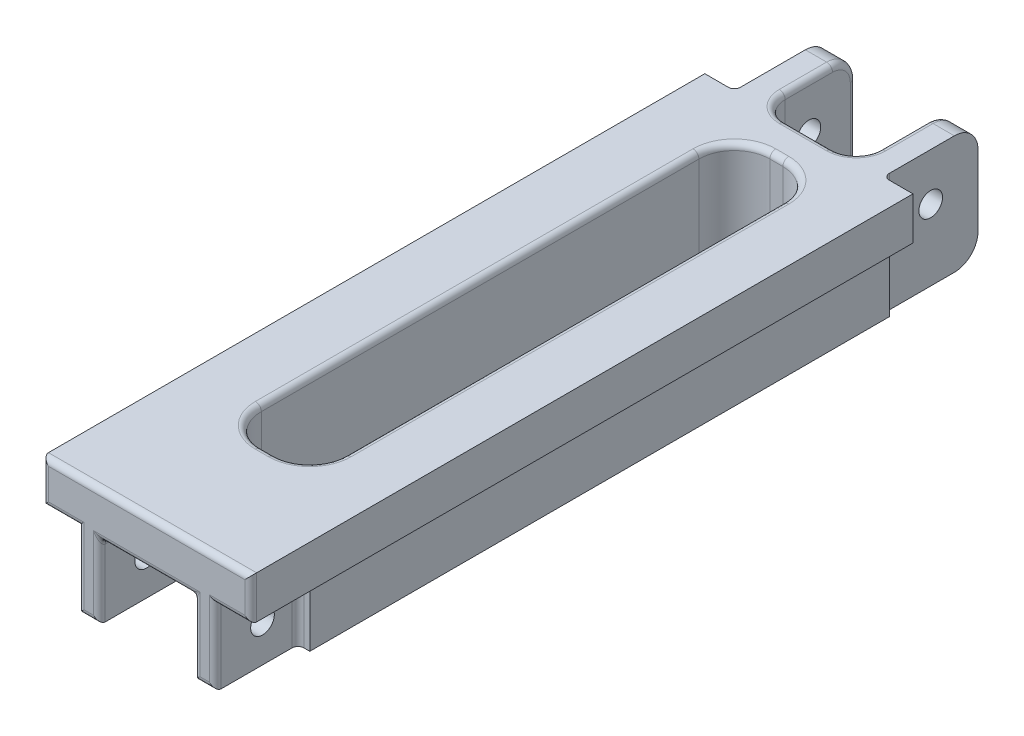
ISO-10303-21;
HEADER;
FILE_DESCRIPTION(('STEP AP214'),'2;1');
FILE_NAME('part.step','',(''),(''),'','','');
FILE_SCHEMA(('AUTOMOTIVE_DESIGN { 1 0 10303 214 1 1 1 1 }'));
ENDSEC;
DATA;
#1=APPLICATION_CONTEXT('core data for automotive mechanical design processes');
#2=APPLICATION_PROTOCOL_DEFINITION('international standard','automotive_design',2000,#1);
#3=PRODUCT_CONTEXT('',#1,'mechanical');
#4=PRODUCT('Part','Part','',(#3));
#5=PRODUCT_RELATED_PRODUCT_CATEGORY('part','',(#4));
#6=PRODUCT_DEFINITION_FORMATION('','',#4);
#7=PRODUCT_DEFINITION_CONTEXT('part definition',#1,'design');
#8=PRODUCT_DEFINITION('design','',#6,#7);
#9=PRODUCT_DEFINITION_SHAPE('','',#8);
#10=(LENGTH_UNIT() NAMED_UNIT(*) SI_UNIT(.MILLI.,.METRE.));
#11=(NAMED_UNIT(*) PLANE_ANGLE_UNIT() SI_UNIT($,.RADIAN.));
#12=(NAMED_UNIT(*) SI_UNIT($,.STERADIAN.) SOLID_ANGLE_UNIT());
#13=UNCERTAINTY_MEASURE_WITH_UNIT(LENGTH_MEASURE(1.E-05),#10,'distance_accuracy_value','');
#14=(GEOMETRIC_REPRESENTATION_CONTEXT(3) GLOBAL_UNCERTAINTY_ASSIGNED_CONTEXT((#13)) GLOBAL_UNIT_ASSIGNED_CONTEXT((#10,
#11,#12)) REPRESENTATION_CONTEXT('',''));
#15=CARTESIAN_POINT('',(0.,0.,0.));
#16=DIRECTION('',(0.,0.,1.));
#17=DIRECTION('',(1.,0.,0.));
#18=AXIS2_PLACEMENT_3D('',#15,#16,#17);
#19=CARTESIAN_POINT('',(0.,-169.418,-406.4));
#20=DIRECTION('',(0.,-1.,0.));
#21=DIRECTION('',(0.,0.,-1.));
#22=AXIS2_PLACEMENT_3D('',#19,#20,#21);
#23=PLANE('',#22);
#24=CARTESIAN_POINT('',(126.511785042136,-169.418,-317.5));
#25=DIRECTION('',(0.,-1.,0.));
#26=DIRECTION('',(0.,0.,-1.));
#27=AXIS2_PLACEMENT_3D('',#24,#25,#26);
#28=CIRCLE('',#27,22.225);
#29=CARTESIAN_POINT('',(148.736785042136,-169.418,-317.5));
#30=VERTEX_POINT('',#29);
#31=CARTESIAN_POINT('',(126.511785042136,-169.418,-339.725));
#32=VERTEX_POINT('',#31);
#33=EDGE_CURVE('E657',#30,#32,#28,.F.);
#34=ORIENTED_EDGE('',*,*,#33,.T.);
#35=DIRECTION('',(-1.,0.,0.));
#36=VECTOR('',#35,1.);
#37=CARTESIAN_POINT('',(0.,-169.418,-339.725));
#38=LINE('',#37,#36);
#39=CARTESIAN_POINT('',(119.526785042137,-169.418,-339.725));
#40=VERTEX_POINT('',#39);
#41=EDGE_CURVE('E659',#32,#40,#38,.T.);
#42=ORIENTED_EDGE('',*,*,#41,.T.);
#43=CARTESIAN_POINT('',(119.526785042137,-169.418,-317.5));
#44=DIRECTION('',(0.,-1.,0.));
#45=DIRECTION('',(0.,0.,-1.));
#46=AXIS2_PLACEMENT_3D('',#43,#44,#45);
#47=CIRCLE('',#46,22.225);
#48=CARTESIAN_POINT('',(97.3017850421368,-169.418,-317.5));
#49=VERTEX_POINT('',#48);
#50=EDGE_CURVE('E645',#40,#49,#47,.F.);
#51=ORIENTED_EDGE('',*,*,#50,.T.);
#52=DIRECTION('',(0.,0.,-1.));
#53=VECTOR('',#52,1.);
#54=CARTESIAN_POINT('',(97.3017850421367,-169.418,-82.55));
#55=LINE('',#54,#53);
#56=CARTESIAN_POINT('',(97.3017850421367,-169.418,-82.55));
#57=VERTEX_POINT('',#56);
#58=EDGE_CURVE('E647',#49,#57,#55,.F.);
#59=ORIENTED_EDGE('',*,*,#58,.T.);
#60=CARTESIAN_POINT('',(119.526785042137,-169.418,-82.55));
#61=DIRECTION('',(0.,-1.,0.));
#62=DIRECTION('',(0.,0.,-1.));
#63=AXIS2_PLACEMENT_3D('',#60,#61,#62);
#64=CIRCLE('',#63,22.225);
#65=CARTESIAN_POINT('',(119.526785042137,-169.418,-60.325));
#66=VERTEX_POINT('',#65);
#67=EDGE_CURVE('E649',#57,#66,#64,.F.);
#68=ORIENTED_EDGE('',*,*,#67,.T.);
#69=DIRECTION('',(-1.,0.,0.));
#70=VECTOR('',#69,1.);
#71=CARTESIAN_POINT('',(126.511785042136,-169.418,-60.325));
#72=LINE('',#71,#70);
#73=CARTESIAN_POINT('',(126.511785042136,-169.418,-60.325));
#74=VERTEX_POINT('',#73);
#75=EDGE_CURVE('E651',#66,#74,#72,.F.);
#76=ORIENTED_EDGE('',*,*,#75,.T.);
#77=CARTESIAN_POINT('',(126.511785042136,-169.418,-82.55));
#78=DIRECTION('',(0.,-1.,0.));
#79=DIRECTION('',(0.,0.,-1.));
#80=AXIS2_PLACEMENT_3D('',#77,#78,#79);
#81=CIRCLE('',#80,22.225);
#82=CARTESIAN_POINT('',(148.736785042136,-169.418,-82.55));
#83=VERTEX_POINT('',#82);
#84=EDGE_CURVE('E653',#74,#83,#81,.F.);
#85=ORIENTED_EDGE('',*,*,#84,.T.);
#86=DIRECTION('',(0.,0.,1.));
#87=VECTOR('',#86,1.);
#88=CARTESIAN_POINT('',(148.736785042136,-169.418,-317.5));
#89=LINE('',#88,#87);
#90=EDGE_CURVE('E655',#83,#30,#89,.F.);
#91=ORIENTED_EDGE('',*,*,#90,.T.);
#92=EDGE_LOOP('',(#34,#42,#51,#59,#68,#76,#85,#91));
#93=FACE_BOUND('',#92,.T.);
#94=DIRECTION('',(0.,0.,-1.));
#95=VECTOR('',#94,1.);
#96=CARTESIAN_POINT('',(158.261785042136,-169.418,-406.4));
#97=LINE('',#96,#95);
#98=CARTESIAN_POINT('',(158.261785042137,-169.418,-3.17499999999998));
#99=VERTEX_POINT('',#98);
#100=CARTESIAN_POINT('',(158.261785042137,-169.418,-41.275));
#101=VERTEX_POINT('',#100);
#102=EDGE_CURVE('E1329',#99,#101,#97,.T.);
#103=ORIENTED_EDGE('',*,*,#102,.F.);
#104=DIRECTION('',(1.,0.,0.));
#105=VECTOR('',#104,1.);
#106=CARTESIAN_POINT('',(0.,-169.418,-3.17499999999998));
#107=LINE('',#106,#105);
#108=CARTESIAN_POINT('',(146.831785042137,-169.418,-3.17499999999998));
#109=VERTEX_POINT('',#108);
#110=EDGE_CURVE('E725',#99,#109,#107,.F.);
#111=ORIENTED_EDGE('',*,*,#110,.T.);
#112=DIRECTION('',(0.,0.,1.));
#113=VECTOR('',#112,1.);
#114=CARTESIAN_POINT('',(146.831785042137,-169.418,-406.4));
#115=LINE('',#114,#113);
#116=CARTESIAN_POINT('',(146.831785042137,-169.418,-41.275));
#117=VERTEX_POINT('',#116);
#118=EDGE_CURVE('E1347',#117,#109,#115,.T.);
#119=ORIENTED_EDGE('',*,*,#118,.F.);
#120=CARTESIAN_POINT('',(143.656785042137,-169.418,-41.275));
#121=DIRECTION('',(0.,-1.,0.));
#122=DIRECTION('',(0.,0.,-1.));
#123=AXIS2_PLACEMENT_3D('',#120,#121,#122);
#124=CIRCLE('',#123,3.175);
#125=CARTESIAN_POINT('',(143.656785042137,-169.418,-44.45));
#126=VERTEX_POINT('',#125);
#127=EDGE_CURVE('E965',#117,#126,#124,.F.);
#128=ORIENTED_EDGE('',*,*,#127,.T.);
#129=DIRECTION('',(-1.,0.,0.));
#130=VECTOR('',#129,1.);
#131=CARTESIAN_POINT('',(0.,-169.418,-44.45));
#132=LINE('',#131,#130);
#133=CARTESIAN_POINT('',(99.2067850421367,-169.418,-44.45));
#134=VERTEX_POINT('',#133);
#135=EDGE_CURVE('E526',#126,#134,#132,.T.);
#136=ORIENTED_EDGE('',*,*,#135,.T.);
#137=CARTESIAN_POINT('',(99.2067850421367,-169.418,-41.275));
#138=DIRECTION('',(0.,-1.,0.));
#139=DIRECTION('',(0.,0.,-1.));
#140=AXIS2_PLACEMENT_3D('',#137,#138,#139);
#141=CIRCLE('',#140,3.175);
#142=CARTESIAN_POINT('',(96.0317850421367,-169.418,-41.275));
#143=VERTEX_POINT('',#142);
#144=EDGE_CURVE('E963',#134,#143,#141,.F.);
#145=ORIENTED_EDGE('',*,*,#144,.T.);
#146=DIRECTION('',(0.,0.,1.));
#147=VECTOR('',#146,1.);
#148=CARTESIAN_POINT('',(96.0317850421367,-169.418,-406.4));
#149=LINE('',#148,#147);
#150=CARTESIAN_POINT('',(96.0317850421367,-169.418,-3.17499999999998));
#151=VERTEX_POINT('',#150);
#152=EDGE_CURVE('E1363',#143,#151,#149,.T.);
#153=ORIENTED_EDGE('',*,*,#152,.T.);
#154=DIRECTION('',(1.,0.,0.));
#155=VECTOR('',#154,1.);
#156=CARTESIAN_POINT('',(0.,-169.418,-3.17499999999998));
#157=LINE('',#156,#155);
#158=CARTESIAN_POINT('',(84.6017850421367,-169.418,-3.17499999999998));
#159=VERTEX_POINT('',#158);
#160=EDGE_CURVE('E723',#151,#159,#157,.F.);
#161=ORIENTED_EDGE('',*,*,#160,.T.);
#162=DIRECTION('',(0.,0.,-1.));
#163=VECTOR('',#162,1.);
#164=CARTESIAN_POINT('',(84.6017850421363,-169.418,-406.4));
#165=LINE('',#164,#163);
#166=CARTESIAN_POINT('',(84.6017850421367,-169.418,-41.275));
#167=VERTEX_POINT('',#166);
#168=EDGE_CURVE('E510',#159,#167,#165,.T.);
#169=ORIENTED_EDGE('',*,*,#168,.T.);
#170=CARTESIAN_POINT('',(81.4267850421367,-169.418,-41.275));
#171=DIRECTION('',(0.,-1.,0.));
#172=DIRECTION('',(0.,0.,-1.));
#173=AXIS2_PLACEMENT_3D('',#170,#171,#172);
#174=CIRCLE('',#173,3.175);
#175=CARTESIAN_POINT('',(81.4267850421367,-169.418,-44.45));
#176=VERTEX_POINT('',#175);
#177=EDGE_CURVE('E509',#167,#176,#174,.F.);
#178=ORIENTED_EDGE('',*,*,#177,.T.);
#179=DIRECTION('',(-1.,0.,0.));
#180=VECTOR('',#179,1.);
#181=CARTESIAN_POINT('',(0.,-169.418,-44.45));
#182=LINE('',#181,#180);
#183=CARTESIAN_POINT('',(78.2517850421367,-169.418,-44.45));
#184=VERTEX_POINT('',#183);
#185=EDGE_CURVE('E496',#176,#184,#182,.T.);
#186=ORIENTED_EDGE('',*,*,#185,.T.);
#187=DIRECTION('',(0.,0.,1.));
#188=VECTOR('',#187,1.);
#189=CARTESIAN_POINT('',(78.2517850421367,-169.418,-406.4));
#190=LINE('',#189,#188);
#191=CARTESIAN_POINT('',(78.2517850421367,-169.418,-355.6));
#192=VERTEX_POINT('',#191);
#193=EDGE_CURVE('E506',#192,#184,#190,.T.);
#194=ORIENTED_EDGE('',*,*,#193,.F.);
#195=CARTESIAN_POINT('',(78.2517850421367,-169.418,-358.775));
#196=DIRECTION('',(0.,-1.,0.));
#197=DIRECTION('',(0.,0.,-1.));
#198=AXIS2_PLACEMENT_3D('',#195,#196,#197);
#199=CIRCLE('',#198,3.175);
#200=CARTESIAN_POINT('',(81.4267850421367,-169.418,-358.775));
#201=VERTEX_POINT('',#200);
#202=EDGE_CURVE('E969',#192,#201,#199,.F.);
#203=ORIENTED_EDGE('',*,*,#202,.T.);
#204=DIRECTION('',(0.,0.,-1.));
#205=VECTOR('',#204,1.);
#206=CARTESIAN_POINT('',(81.4267850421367,-169.418,-355.6));
#207=LINE('',#206,#205);
#208=CARTESIAN_POINT('',(81.4267850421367,-169.418,-393.7));
#209=VERTEX_POINT('',#208);
#210=EDGE_CURVE('E522',#201,#209,#207,.T.);
#211=ORIENTED_EDGE('',*,*,#210,.T.);
#212=DIRECTION('',(1.,0.,0.));
#213=VECTOR('',#212,1.);
#214=CARTESIAN_POINT('',(96.0317850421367,-169.418,-393.7));
#215=LINE('',#214,#213);
#216=CARTESIAN_POINT('',(92.8567850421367,-169.418,-393.7));
#217=VERTEX_POINT('',#216);
#218=EDGE_CURVE('E568',#209,#217,#215,.T.);
#219=ORIENTED_EDGE('',*,*,#218,.T.);
#220=DIRECTION('',(0.,0.,-1.));
#221=VECTOR('',#220,1.);
#222=CARTESIAN_POINT('',(92.8567850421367,-169.418,-368.3));
#223=LINE('',#222,#221);
#224=CARTESIAN_POINT('',(92.8567850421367,-169.418,-368.3));
#225=VERTEX_POINT('',#224);
#226=EDGE_CURVE('E716',#217,#225,#223,.F.);
#227=ORIENTED_EDGE('',*,*,#226,.T.);
#228=CARTESIAN_POINT('',(108.731785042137,-169.418,-368.3));
#229=DIRECTION('',(0.,-1.,0.));
#230=DIRECTION('',(0.,0.,-1.));
#231=AXIS2_PLACEMENT_3D('',#228,#229,#230);
#232=CIRCLE('',#231,15.875);
#233=CARTESIAN_POINT('',(108.731785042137,-169.418,-352.425));
#234=VERTEX_POINT('',#233);
#235=EDGE_CURVE('E714',#225,#234,#232,.F.);
#236=ORIENTED_EDGE('',*,*,#235,.T.);
#237=DIRECTION('',(-1.,0.,0.));
#238=VECTOR('',#237,1.);
#239=CARTESIAN_POINT('',(0.,-169.418,-352.425));
#240=LINE('',#239,#238);
#241=CARTESIAN_POINT('',(134.131785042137,-169.418,-352.425));
#242=VERTEX_POINT('',#241);
#243=EDGE_CURVE('E666',#234,#242,#240,.F.);
#244=ORIENTED_EDGE('',*,*,#243,.T.);
#245=CARTESIAN_POINT('',(134.131785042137,-169.418,-368.3));
#246=DIRECTION('',(0.,-1.,0.));
#247=DIRECTION('',(0.,0.,-1.));
#248=AXIS2_PLACEMENT_3D('',#245,#246,#247);
#249=CIRCLE('',#248,15.875);
#250=CARTESIAN_POINT('',(150.006785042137,-169.418,-368.3));
#251=VERTEX_POINT('',#250);
#252=EDGE_CURVE('E718',#242,#251,#249,.F.);
#253=ORIENTED_EDGE('',*,*,#252,.T.);
#254=DIRECTION('',(0.,0.,-1.));
#255=VECTOR('',#254,1.);
#256=CARTESIAN_POINT('',(150.006785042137,-169.418,-406.4));
#257=LINE('',#256,#255);
#258=CARTESIAN_POINT('',(150.006785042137,-169.418,-393.7));
#259=VERTEX_POINT('',#258);
#260=EDGE_CURVE('E721',#251,#259,#257,.T.);
#261=ORIENTED_EDGE('',*,*,#260,.T.);
#262=DIRECTION('',(1.,0.,0.));
#263=VECTOR('',#262,1.);
#264=CARTESIAN_POINT('',(161.436785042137,-169.418,-393.7));
#265=LINE('',#264,#263);
#266=CARTESIAN_POINT('',(161.436785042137,-169.418,-393.7));
#267=VERTEX_POINT('',#266);
#268=EDGE_CURVE('E571',#259,#267,#265,.T.);
#269=ORIENTED_EDGE('',*,*,#268,.T.);
#270=DIRECTION('',(0.,0.,-1.));
#271=VECTOR('',#270,1.);
#272=CARTESIAN_POINT('',(161.436785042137,-169.418,-355.6));
#273=LINE('',#272,#271);
#274=CARTESIAN_POINT('',(161.436785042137,-169.418,-358.775));
#275=VERTEX_POINT('',#274);
#276=EDGE_CURVE('E1291',#275,#267,#273,.T.);
#277=ORIENTED_EDGE('',*,*,#276,.F.);
#278=CARTESIAN_POINT('',(164.611785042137,-169.418,-358.775));
#279=DIRECTION('',(0.,-1.,0.));
#280=DIRECTION('',(0.,0.,-1.));
#281=AXIS2_PLACEMENT_3D('',#278,#279,#280);
#282=CIRCLE('',#281,3.175);
#283=CARTESIAN_POINT('',(164.611785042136,-169.418,-355.6));
#284=VERTEX_POINT('',#283);
#285=EDGE_CURVE('E973',#275,#284,#282,.F.);
#286=ORIENTED_EDGE('',*,*,#285,.T.);
#287=DIRECTION('',(0.,0.,1.));
#288=VECTOR('',#287,1.);
#289=CARTESIAN_POINT('',(164.611785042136,-169.418,-406.4));
#290=LINE('',#289,#288);
#291=CARTESIAN_POINT('',(164.611785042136,-169.418,-44.45));
#292=VERTEX_POINT('',#291);
#293=EDGE_CURVE('E516',#284,#292,#290,.T.);
#294=ORIENTED_EDGE('',*,*,#293,.T.);
#295=DIRECTION('',(-1.,0.,0.));
#296=VECTOR('',#295,1.);
#297=CARTESIAN_POINT('',(0.,-169.418,-44.45));
#298=LINE('',#297,#296);
#299=CARTESIAN_POINT('',(161.436785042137,-169.418,-44.45));
#300=VERTEX_POINT('',#299);
#301=EDGE_CURVE('E511',#292,#300,#298,.T.);
#302=ORIENTED_EDGE('',*,*,#301,.T.);
#303=CARTESIAN_POINT('',(161.436785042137,-169.418,-41.275));
#304=DIRECTION('',(0.,-1.,0.));
#305=DIRECTION('',(0.,0.,-1.));
#306=AXIS2_PLACEMENT_3D('',#303,#304,#305);
#307=CIRCLE('',#306,3.175);
#308=EDGE_CURVE('E977',#300,#101,#307,.F.);
#309=ORIENTED_EDGE('',*,*,#308,.T.);
#310=EDGE_LOOP('',(#103,#111,#119,#128,#136,#145,#153,#161,#169,#178,#186,#194,#203,#211,#219,
#227,#236,#244,#253,#261,#269,#277,#286,#294,#302,#309));
#311=FACE_BOUND('',#310,.T.);
#312=ADVANCED_FACE('F49',(#93,#311),#23,.T.);
#313=CARTESIAN_POINT('',(78.2517850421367,0.,-406.4));
#314=DIRECTION('',(1.,0.,0.));
#315=DIRECTION('',(0.,0.,-1.));
#316=AXIS2_PLACEMENT_3D('',#313,#314,#315);
#317=PLANE('',#316);
#318=DIRECTION('',(0.,-1.,0.));
#319=VECTOR('',#318,1.);
#320=CARTESIAN_POINT('',(78.2517850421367,-83.876719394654,-44.45));
#321=LINE('',#320,#319);
#322=CARTESIAN_POINT('',(78.2517850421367,-131.953,-44.45));
#323=VERTEX_POINT('',#322);
#324=EDGE_CURVE('E493',#323,#184,#321,.T.);
#325=ORIENTED_EDGE('',*,*,#324,.F.);
#326=DIRECTION('',(0.,0.,1.));
#327=VECTOR('',#326,1.);
#328=CARTESIAN_POINT('',(78.2517850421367,-131.953,-355.6));
#329=LINE('',#328,#327);
#330=CARTESIAN_POINT('',(78.2517850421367,-131.953,-355.6));
#331=VERTEX_POINT('',#330);
#332=EDGE_CURVE('E1260',#323,#331,#329,.F.);
#333=ORIENTED_EDGE('',*,*,#332,.T.);
#334=DIRECTION('',(0.,1.,0.));
#335=VECTOR('',#334,1.);
#336=CARTESIAN_POINT('',(78.2517850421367,0.,-355.6));
#337=LINE('',#336,#335);
#338=EDGE_CURVE('E515',#192,#331,#337,.T.);
#339=ORIENTED_EDGE('',*,*,#338,.F.);
#340=ORIENTED_EDGE('',*,*,#193,.T.);
#341=EDGE_LOOP('',(#325,#333,#339,#340));
#342=FACE_BOUND('',#341,.T.);
#343=ADVANCED_FACE('F513',(#342),#317,.F.);
#344=CARTESIAN_POINT('',(164.611785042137,0.,-406.4));
#345=DIRECTION('',(-1.,0.,0.));
#346=DIRECTION('',(0.,0.,1.));
#347=AXIS2_PLACEMENT_3D('',#344,#345,#346);
#348=PLANE('',#347);
#349=DIRECTION('',(0.,-1.,0.));
#350=VECTOR('',#349,1.);
#351=CARTESIAN_POINT('',(164.611785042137,0.,-355.6));
#352=LINE('',#351,#350);
#353=CARTESIAN_POINT('',(164.611785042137,-131.953,-355.6));
#354=VERTEX_POINT('',#353);
#355=EDGE_CURVE('E1289',#354,#284,#352,.T.);
#356=ORIENTED_EDGE('',*,*,#355,.F.);
#357=DIRECTION('',(0.,0.,1.));
#358=VECTOR('',#357,1.);
#359=CARTESIAN_POINT('',(164.611785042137,-131.953,-44.45));
#360=LINE('',#359,#358);
#361=CARTESIAN_POINT('',(164.611785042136,-131.953,-44.45));
#362=VERTEX_POINT('',#361);
#363=EDGE_CURVE('E1262',#354,#362,#360,.T.);
#364=ORIENTED_EDGE('',*,*,#363,.T.);
#365=DIRECTION('',(0.,-1.,0.));
#366=VECTOR('',#365,1.);
#367=CARTESIAN_POINT('',(164.611785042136,-83.876719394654,-44.45));
#368=LINE('',#367,#366);
#369=EDGE_CURVE('E1275',#362,#292,#368,.T.);
#370=ORIENTED_EDGE('',*,*,#369,.T.);
#371=ORIENTED_EDGE('',*,*,#293,.F.);
#372=EDGE_LOOP('',(#356,#364,#370,#371));
#373=FACE_BOUND('',#372,.T.);
#374=ADVANCED_FACE('F1058',(#373),#348,.F.);
#375=CARTESIAN_POINT('',(0.,0.,0.));
#376=DIRECTION('',(0.,0.,1.));
#377=DIRECTION('',(1.,0.,0.));
#378=AXIS2_PLACEMENT_3D('',#375,#376,#377);
#379=PLANE('',#378);
#380=DIRECTION('',(0.,1.,0.));
#381=VECTOR('',#380,1.);
#382=CARTESIAN_POINT('',(150.006785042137,-169.418,0.));
#383=LINE('',#382,#381);
#384=CARTESIAN_POINT('',(150.006785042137,-126.873,0.));
#385=VERTEX_POINT('',#384);
#386=CARTESIAN_POINT('',(150.006785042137,-166.243,0.));
#387=VERTEX_POINT('',#386);
#388=EDGE_CURVE('E807',#385,#387,#383,.F.);
#389=ORIENTED_EDGE('',*,*,#388,.T.);
#390=DIRECTION('',(1.,0.,0.));
#391=VECTOR('',#390,1.);
#392=CARTESIAN_POINT('',(0.,-166.243,0.));
#393=LINE('',#392,#391);
#394=CARTESIAN_POINT('',(155.086785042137,-166.243,0.));
#395=VERTEX_POINT('',#394);
#396=EDGE_CURVE('E809',#387,#395,#393,.T.);
#397=ORIENTED_EDGE('',*,*,#396,.T.);
#398=DIRECTION('',(0.,-1.,0.));
#399=VECTOR('',#398,1.);
#400=CARTESIAN_POINT('',(155.086785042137,-128.778,0.));
#401=LINE('',#400,#399);
#402=CARTESIAN_POINT('',(155.086785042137,-125.603,0.));
#403=VERTEX_POINT('',#402);
#404=EDGE_CURVE('E785',#395,#403,#401,.F.);
#405=ORIENTED_EDGE('',*,*,#404,.T.);
#406=DIRECTION('',(-1.,0.,0.));
#407=VECTOR('',#406,1.);
#408=CARTESIAN_POINT('',(177.311785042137,-125.603,0.));
#409=LINE('',#408,#407);
#410=CARTESIAN_POINT('',(174.136785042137,-125.603,0.));
#411=VERTEX_POINT('',#410);
#412=EDGE_CURVE('E787',#403,#411,#409,.F.);
#413=ORIENTED_EDGE('',*,*,#412,.T.);
#414=DIRECTION('',(0.,-1.,0.));
#415=VECTOR('',#414,1.);
#416=CARTESIAN_POINT('',(174.136785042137,-105.918,0.));
#417=LINE('',#416,#415);
#418=CARTESIAN_POINT('',(174.136785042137,-109.093,0.));
#419=VERTEX_POINT('',#418);
#420=EDGE_CURVE('E789',#411,#419,#417,.F.);
#421=ORIENTED_EDGE('',*,*,#420,.T.);
#422=DIRECTION('',(1.,0.,0.));
#423=VECTOR('',#422,1.);
#424=CARTESIAN_POINT('',(65.5517850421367,-109.093,0.));
#425=LINE('',#424,#423);
#426=CARTESIAN_POINT('',(68.7267850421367,-109.093,0.));
#427=VERTEX_POINT('',#426);
#428=EDGE_CURVE('E791',#419,#427,#425,.F.);
#429=ORIENTED_EDGE('',*,*,#428,.T.);
#430=DIRECTION('',(0.,1.,0.));
#431=VECTOR('',#430,1.);
#432=CARTESIAN_POINT('',(68.7267850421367,-128.778,0.));
#433=LINE('',#432,#431);
#434=CARTESIAN_POINT('',(68.7267850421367,-125.603,0.));
#435=VERTEX_POINT('',#434);
#436=EDGE_CURVE('E793',#427,#435,#433,.F.);
#437=ORIENTED_EDGE('',*,*,#436,.T.);
#438=DIRECTION('',(-1.,0.,0.));
#439=VECTOR('',#438,1.);
#440=CARTESIAN_POINT('',(84.6017850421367,-125.603,0.));
#441=LINE('',#440,#439);
#442=CARTESIAN_POINT('',(87.7767850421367,-125.603,0.));
#443=VERTEX_POINT('',#442);
#444=EDGE_CURVE('E795',#435,#443,#441,.F.);
#445=ORIENTED_EDGE('',*,*,#444,.T.);
#446=DIRECTION('',(0.,-1.,0.));
#447=VECTOR('',#446,1.);
#448=CARTESIAN_POINT('',(87.7767850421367,0.,0.));
#449=LINE('',#448,#447);
#450=CARTESIAN_POINT('',(87.7767850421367,-166.243,0.));
#451=VERTEX_POINT('',#450);
#452=EDGE_CURVE('E797',#443,#451,#449,.T.);
#453=ORIENTED_EDGE('',*,*,#452,.T.);
#454=DIRECTION('',(1.,0.,0.));
#455=VECTOR('',#454,1.);
#456=CARTESIAN_POINT('',(0.,-166.243,0.));
#457=LINE('',#456,#455);
#458=CARTESIAN_POINT('',(92.8567850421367,-166.243,0.));
#459=VERTEX_POINT('',#458);
#460=EDGE_CURVE('E799',#451,#459,#457,.T.);
#461=ORIENTED_EDGE('',*,*,#460,.T.);
#462=DIRECTION('',(0.,1.,0.));
#463=VECTOR('',#462,1.);
#464=CARTESIAN_POINT('',(92.8567850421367,0.,0.));
#465=LINE('',#464,#463);
#466=CARTESIAN_POINT('',(92.8567850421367,-126.873,0.));
#467=VERTEX_POINT('',#466);
#468=EDGE_CURVE('E801',#459,#467,#465,.T.);
#469=ORIENTED_EDGE('',*,*,#468,.T.);
#470=DIRECTION('',(-1.,0.,0.));
#471=VECTOR('',#470,1.);
#472=CARTESIAN_POINT('',(146.831785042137,-126.873,0.));
#473=LINE('',#472,#471);
#474=EDGE_CURVE('E804',#467,#385,#473,.F.);
#475=ORIENTED_EDGE('',*,*,#474,.T.);
#476=EDGE_LOOP('',(#389,#397,#405,#413,#421,#429,#437,#445,#453,#461,#469,#475));
#477=FACE_BOUND('',#476,.T.);
#478=ADVANCED_FACE('F1404',(#477),#379,.T.);
#479=CARTESIAN_POINT('',(0.,-128.778,-406.4));
#480=DIRECTION('',(0.,1.,0.));
#481=DIRECTION('',(0.,0.,1.));
#482=AXIS2_PLACEMENT_3D('',#479,#480,#481);
#483=PLANE('',#482);
#484=DIRECTION('',(-1.,0.,0.));
#485=VECTOR('',#484,1.);
#486=CARTESIAN_POINT('',(0.,-128.778,-355.6));
#487=LINE('',#486,#485);
#488=CARTESIAN_POINT('',(75.0767850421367,-128.778,-355.6));
#489=VERTEX_POINT('',#488);
#490=CARTESIAN_POINT('',(65.5517850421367,-128.778,-355.6));
#491=VERTEX_POINT('',#490);
#492=EDGE_CURVE('E1383',#489,#491,#487,.T.);
#493=ORIENTED_EDGE('',*,*,#492,.F.);
#494=DIRECTION('',(0.,0.,1.));
#495=VECTOR('',#494,1.);
#496=CARTESIAN_POINT('',(75.0767850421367,-128.778,-44.45));
#497=LINE('',#496,#495);
#498=CARTESIAN_POINT('',(75.0767850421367,-128.778,-44.45));
#499=VERTEX_POINT('',#498);
#500=EDGE_CURVE('E979',#489,#499,#497,.T.);
#501=ORIENTED_EDGE('',*,*,#500,.T.);
#502=DIRECTION('',(-1.,0.,0.));
#503=VECTOR('',#502,1.);
#504=CARTESIAN_POINT('',(0.,-128.778,-44.45));
#505=LINE('',#504,#503);
#506=CARTESIAN_POINT('',(81.4267850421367,-128.778,-44.45));
#507=VERTEX_POINT('',#506);
#508=EDGE_CURVE('E501',#507,#499,#505,.T.);
#509=ORIENTED_EDGE('',*,*,#508,.F.);
#510=CARTESIAN_POINT('',(81.4267850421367,-128.778,-41.275));
#511=DIRECTION('',(0.,1.,0.));
#512=DIRECTION('',(0.,0.,1.));
#513=AXIS2_PLACEMENT_3D('',#510,#511,#512);
#514=CIRCLE('',#513,3.175);
#515=CARTESIAN_POINT('',(84.6017850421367,-128.778,-41.275));
#516=VERTEX_POINT('',#515);
#517=EDGE_CURVE('E954',#507,#516,#514,.F.);
#518=ORIENTED_EDGE('',*,*,#517,.T.);
#519=DIRECTION('',(0.,0.,-1.));
#520=VECTOR('',#519,1.);
#521=CARTESIAN_POINT('',(84.6017850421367,-128.778,0.));
#522=LINE('',#521,#520);
#523=CARTESIAN_POINT('',(84.6017850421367,-128.778,-3.17499999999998));
#524=VERTEX_POINT('',#523);
#525=EDGE_CURVE('E1452',#524,#516,#522,.T.);
#526=ORIENTED_EDGE('',*,*,#525,.F.);
#527=DIRECTION('',(-1.,0.,0.));
#528=VECTOR('',#527,1.);
#529=CARTESIAN_POINT('',(65.5517850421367,-128.778,-3.17499999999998));
#530=LINE('',#529,#528);
#531=CARTESIAN_POINT('',(65.5517850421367,-128.778,-3.17499999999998));
#532=VERTEX_POINT('',#531);
#533=EDGE_CURVE('E823',#524,#532,#530,.T.);
#534=ORIENTED_EDGE('',*,*,#533,.T.);
#535=DIRECTION('',(0.,0.,1.));
#536=VECTOR('',#535,1.);
#537=CARTESIAN_POINT('',(65.5517850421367,-128.778,-406.4));
#538=LINE('',#537,#536);
#539=EDGE_CURVE('E530',#491,#532,#538,.T.);
#540=ORIENTED_EDGE('',*,*,#539,.F.);
#541=EDGE_LOOP('',(#493,#501,#509,#518,#526,#534,#540));
#542=FACE_BOUND('',#541,.T.);
#543=ADVANCED_FACE('F1478',(#542),#483,.F.);
#544=CARTESIAN_POINT('',(65.5517850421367,0.,-406.4));
#545=DIRECTION('',(1.,0.,0.));
#546=DIRECTION('',(0.,0.,-1.));
#547=AXIS2_PLACEMENT_3D('',#544,#545,#546);
#548=PLANE('',#547);
#549=ORIENTED_EDGE('',*,*,#539,.T.);
#550=DIRECTION('',(0.,1.,0.));
#551=VECTOR('',#550,1.);
#552=CARTESIAN_POINT('',(65.5517850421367,-105.918,-3.17499999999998));
#553=LINE('',#552,#551);
#554=CARTESIAN_POINT('',(65.5517850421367,-105.918,-3.17499999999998));
#555=VERTEX_POINT('',#554);
#556=EDGE_CURVE('E825',#532,#555,#553,.T.);
#557=ORIENTED_EDGE('',*,*,#556,.T.);
#558=DIRECTION('',(0.,0.,1.));
#559=VECTOR('',#558,1.);
#560=CARTESIAN_POINT('',(65.5517850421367,-105.918,-406.4));
#561=LINE('',#560,#559);
#562=CARTESIAN_POINT('',(65.5517850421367,-105.918,-355.6));
#563=VERTEX_POINT('',#562);
#564=EDGE_CURVE('E1307',#563,#555,#561,.T.);
#565=ORIENTED_EDGE('',*,*,#564,.F.);
#566=DIRECTION('',(0.,1.,0.));
#567=VECTOR('',#566,1.);
#568=CARTESIAN_POINT('',(65.5517850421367,0.,-355.6));
#569=LINE('',#568,#567);
#570=EDGE_CURVE('E1385',#491,#563,#569,.T.);
#571=ORIENTED_EDGE('',*,*,#570,.F.);
#572=EDGE_LOOP('',(#549,#557,#565,#571));
#573=FACE_BOUND('',#572,.T.);
#574=ADVANCED_FACE('F1591',(#573),#548,.F.);
#575=CARTESIAN_POINT('',(0.,-105.918,-406.4));
#576=DIRECTION('',(0.,-1.,0.));
#577=DIRECTION('',(0.,0.,-1.));
#578=AXIS2_PLACEMENT_3D('',#575,#576,#577);
#579=PLANE('',#578);
#580=CARTESIAN_POINT('',(126.511785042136,-105.918,-82.55));
#581=DIRECTION('',(0.,-1.,0.));
#582=DIRECTION('',(0.,0.,-1.));
#583=AXIS2_PLACEMENT_3D('',#580,#581,#582);
#584=CIRCLE('',#583,22.225);
#585=CARTESIAN_POINT('',(148.736785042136,-105.918,-82.55));
#586=VERTEX_POINT('',#585);
#587=CARTESIAN_POINT('',(126.511785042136,-105.918,-60.325));
#588=VERTEX_POINT('',#587);
#589=EDGE_CURVE('E610',#586,#588,#584,.T.);
#590=ORIENTED_EDGE('',*,*,#589,.T.);
#591=DIRECTION('',(-1.,0.,0.));
#592=VECTOR('',#591,1.);
#593=CARTESIAN_POINT('',(0.,-105.918,-60.325));
#594=LINE('',#593,#592);
#595=CARTESIAN_POINT('',(119.526785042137,-105.918,-60.325));
#596=VERTEX_POINT('',#595);
#597=EDGE_CURVE('E612',#588,#596,#594,.T.);
#598=ORIENTED_EDGE('',*,*,#597,.T.);
#599=CARTESIAN_POINT('',(119.526785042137,-105.918,-82.55));
#600=DIRECTION('',(0.,-1.,0.));
#601=DIRECTION('',(0.,0.,-1.));
#602=AXIS2_PLACEMENT_3D('',#599,#600,#601);
#603=CIRCLE('',#602,22.225);
#604=CARTESIAN_POINT('',(97.3017850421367,-105.918,-82.55));
#605=VERTEX_POINT('',#604);
#606=EDGE_CURVE('E598',#596,#605,#603,.T.);
#607=ORIENTED_EDGE('',*,*,#606,.T.);
#608=DIRECTION('',(0.,0.,-1.));
#609=VECTOR('',#608,1.);
#610=CARTESIAN_POINT('',(97.3017850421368,-105.918,-406.4));
#611=LINE('',#610,#609);
#612=CARTESIAN_POINT('',(97.3017850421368,-105.918,-317.5));
#613=VERTEX_POINT('',#612);
#614=EDGE_CURVE('E600',#605,#613,#611,.T.);
#615=ORIENTED_EDGE('',*,*,#614,.T.);
#616=CARTESIAN_POINT('',(119.526785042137,-105.918,-317.5));
#617=DIRECTION('',(0.,-1.,0.));
#618=DIRECTION('',(0.,0.,-1.));
#619=AXIS2_PLACEMENT_3D('',#616,#617,#618);
#620=CIRCLE('',#619,22.225);
#621=CARTESIAN_POINT('',(119.526785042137,-105.918,-339.725));
#622=VERTEX_POINT('',#621);
#623=EDGE_CURVE('E602',#613,#622,#620,.T.);
#624=ORIENTED_EDGE('',*,*,#623,.T.);
#625=DIRECTION('',(-1.,0.,0.));
#626=VECTOR('',#625,1.);
#627=CARTESIAN_POINT('',(126.511785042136,-105.918,-339.725));
#628=LINE('',#627,#626);
#629=CARTESIAN_POINT('',(126.511785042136,-105.918,-339.725));
#630=VERTEX_POINT('',#629);
#631=EDGE_CURVE('E604',#622,#630,#628,.F.);
#632=ORIENTED_EDGE('',*,*,#631,.T.);
#633=CARTESIAN_POINT('',(126.511785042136,-105.918,-317.5));
#634=DIRECTION('',(0.,-1.,0.));
#635=DIRECTION('',(0.,0.,-1.));
#636=AXIS2_PLACEMENT_3D('',#633,#634,#635);
#637=CIRCLE('',#636,22.225);
#638=CARTESIAN_POINT('',(148.736785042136,-105.918,-317.5));
#639=VERTEX_POINT('',#638);
#640=EDGE_CURVE('E606',#630,#639,#637,.T.);
#641=ORIENTED_EDGE('',*,*,#640,.T.);
#642=DIRECTION('',(0.,0.,1.));
#643=VECTOR('',#642,1.);
#644=CARTESIAN_POINT('',(148.736785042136,-105.918,-406.4));
#645=LINE('',#644,#643);
#646=EDGE_CURVE('E608',#639,#586,#645,.T.);
#647=ORIENTED_EDGE('',*,*,#646,.T.);
#648=EDGE_LOOP('',(#590,#598,#607,#615,#624,#632,#641,#647));
#649=FACE_BOUND('',#648,.T.);
#650=DIRECTION('',(1.,0.,0.));
#651=VECTOR('',#650,1.);
#652=CARTESIAN_POINT('',(0.,-105.918,-393.7));
#653=LINE('',#652,#651);
#654=CARTESIAN_POINT('',(161.436785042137,-105.918,-393.7));
#655=VERTEX_POINT('',#654);
#656=CARTESIAN_POINT('',(150.006785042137,-105.918,-393.7));
#657=VERTEX_POINT('',#656);
#658=EDGE_CURVE('E547',#655,#657,#653,.F.);
#659=ORIENTED_EDGE('',*,*,#658,.T.);
#660=DIRECTION('',(0.,0.,-1.));
#661=VECTOR('',#660,1.);
#662=CARTESIAN_POINT('',(150.006785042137,-105.918,-368.3));
#663=LINE('',#662,#661);
#664=CARTESIAN_POINT('',(150.006785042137,-105.918,-368.3));
#665=VERTEX_POINT('',#664);
#666=EDGE_CURVE('E759',#657,#665,#663,.F.);
#667=ORIENTED_EDGE('',*,*,#666,.T.);
#668=CARTESIAN_POINT('',(134.131785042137,-105.918,-368.3));
#669=DIRECTION('',(0.,-1.,0.));
#670=DIRECTION('',(0.,0.,-1.));
#671=AXIS2_PLACEMENT_3D('',#668,#669,#670);
#672=CIRCLE('',#671,15.875);
#673=CARTESIAN_POINT('',(134.131785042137,-105.918,-352.425));
#674=VERTEX_POINT('',#673);
#675=EDGE_CURVE('E757',#665,#674,#672,.T.);
#676=ORIENTED_EDGE('',*,*,#675,.T.);
#677=DIRECTION('',(1.,0.,0.));
#678=VECTOR('',#677,1.);
#679=CARTESIAN_POINT('',(108.731785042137,-105.918,-352.425));
#680=LINE('',#679,#678);
#681=CARTESIAN_POINT('',(108.731785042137,-105.918,-352.425));
#682=VERTEX_POINT('',#681);
#683=EDGE_CURVE('E755',#674,#682,#680,.F.);
#684=ORIENTED_EDGE('',*,*,#683,.T.);
#685=CARTESIAN_POINT('',(108.731785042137,-105.918,-368.3));
#686=DIRECTION('',(0.,-1.,0.));
#687=DIRECTION('',(0.,0.,-1.));
#688=AXIS2_PLACEMENT_3D('',#685,#686,#687);
#689=CIRCLE('',#688,15.875);
#690=CARTESIAN_POINT('',(92.8567850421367,-105.918,-368.3));
#691=VERTEX_POINT('',#690);
#692=EDGE_CURVE('E753',#682,#691,#689,.T.);
#693=ORIENTED_EDGE('',*,*,#692,.T.);
#694=DIRECTION('',(0.,0.,-1.));
#695=VECTOR('',#694,1.);
#696=CARTESIAN_POINT('',(92.8567850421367,-105.918,-406.4));
#697=LINE('',#696,#695);
#698=CARTESIAN_POINT('',(92.8567850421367,-105.918,-393.7));
#699=VERTEX_POINT('',#698);
#700=EDGE_CURVE('E751',#691,#699,#697,.T.);
#701=ORIENTED_EDGE('',*,*,#700,.T.);
#702=DIRECTION('',(1.,0.,0.));
#703=VECTOR('',#702,1.);
#704=CARTESIAN_POINT('',(0.,-105.918,-393.7));
#705=LINE('',#704,#703);
#706=CARTESIAN_POINT('',(81.4267850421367,-105.918,-393.7));
#707=VERTEX_POINT('',#706);
#708=EDGE_CURVE('E550',#699,#707,#705,.F.);
#709=ORIENTED_EDGE('',*,*,#708,.T.);
#710=DIRECTION('',(0.,0.,-1.));
#711=VECTOR('',#710,1.);
#712=CARTESIAN_POINT('',(81.4267850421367,-105.918,-355.6));
#713=LINE('',#712,#711);
#714=CARTESIAN_POINT('',(81.4267850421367,-105.918,-358.775));
#715=VERTEX_POINT('',#714);
#716=EDGE_CURVE('E517',#715,#707,#713,.T.);
#717=ORIENTED_EDGE('',*,*,#716,.F.);
#718=CARTESIAN_POINT('',(78.2517850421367,-105.918,-358.775));
#719=DIRECTION('',(0.,-1.,0.));
#720=DIRECTION('',(0.,0.,-1.));
#721=AXIS2_PLACEMENT_3D('',#718,#719,#720);
#722=CIRCLE('',#721,3.175);
#723=CARTESIAN_POINT('',(78.2517850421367,-105.918,-355.6));
#724=VERTEX_POINT('',#723);
#725=EDGE_CURVE('E967',#715,#724,#722,.T.);
#726=ORIENTED_EDGE('',*,*,#725,.T.);
#727=DIRECTION('',(1.,0.,0.));
#728=VECTOR('',#727,1.);
#729=CARTESIAN_POINT('',(0.,-105.918,-355.6));
#730=LINE('',#729,#728);
#731=EDGE_CURVE('E1387',#563,#724,#730,.T.);
#732=ORIENTED_EDGE('',*,*,#731,.F.);
#733=ORIENTED_EDGE('',*,*,#564,.T.);
#734=DIRECTION('',(1.,0.,0.));
#735=VECTOR('',#734,1.);
#736=CARTESIAN_POINT('',(177.311785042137,-105.918,-3.17499999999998));
#737=LINE('',#736,#735);
#738=CARTESIAN_POINT('',(177.311785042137,-105.918,-3.17499999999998));
#739=VERTEX_POINT('',#738);
#740=EDGE_CURVE('E749',#555,#739,#737,.T.);
#741=ORIENTED_EDGE('',*,*,#740,.T.);
#742=DIRECTION('',(0.,0.,1.));
#743=VECTOR('',#742,1.);
#744=CARTESIAN_POINT('',(177.311785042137,-105.918,-406.4));
#745=LINE('',#744,#743);
#746=CARTESIAN_POINT('',(177.311785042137,-105.918,-355.6));
#747=VERTEX_POINT('',#746);
#748=EDGE_CURVE('E1310',#747,#739,#745,.T.);
#749=ORIENTED_EDGE('',*,*,#748,.F.);
#750=DIRECTION('',(1.,0.,0.));
#751=VECTOR('',#750,1.);
#752=CARTESIAN_POINT('',(0.,-105.918,-355.6));
#753=LINE('',#752,#751);
#754=CARTESIAN_POINT('',(164.611785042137,-105.918,-355.6));
#755=VERTEX_POINT('',#754);
#756=EDGE_CURVE('E1293',#755,#747,#753,.T.);
#757=ORIENTED_EDGE('',*,*,#756,.F.);
#758=CARTESIAN_POINT('',(164.611785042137,-105.918,-358.775));
#759=DIRECTION('',(0.,-1.,0.));
#760=DIRECTION('',(0.,0.,-1.));
#761=AXIS2_PLACEMENT_3D('',#758,#759,#760);
#762=CIRCLE('',#761,3.175);
#763=CARTESIAN_POINT('',(161.436785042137,-105.918,-358.775));
#764=VERTEX_POINT('',#763);
#765=EDGE_CURVE('E971',#755,#764,#762,.T.);
#766=ORIENTED_EDGE('',*,*,#765,.T.);
#767=DIRECTION('',(0.,0.,-1.));
#768=VECTOR('',#767,1.);
#769=CARTESIAN_POINT('',(161.436785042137,-105.918,-355.6));
#770=LINE('',#769,#768);
#771=EDGE_CURVE('E1301',#764,#655,#770,.T.);
#772=ORIENTED_EDGE('',*,*,#771,.T.);
#773=EDGE_LOOP('',(#659,#667,#676,#684,#693,#701,#709,#717,#726,#732,#733,#741,#749,#757,#766,#772));
#774=FACE_BOUND('',#773,.T.);
#775=ADVANCED_FACE('F1396',(#649,#774),#579,.F.);
#776=CARTESIAN_POINT('',(177.311785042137,0.,-406.4));
#777=DIRECTION('',(-1.,0.,0.));
#778=DIRECTION('',(0.,0.,1.));
#779=AXIS2_PLACEMENT_3D('',#776,#777,#778);
#780=PLANE('',#779);
#781=ORIENTED_EDGE('',*,*,#748,.T.);
#782=DIRECTION('',(0.,-1.,0.));
#783=VECTOR('',#782,1.);
#784=CARTESIAN_POINT('',(177.311785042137,-128.778,-3.17499999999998));
#785=LINE('',#784,#783);
#786=CARTESIAN_POINT('',(177.311785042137,-128.778,-3.17499999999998));
#787=VERTEX_POINT('',#786);
#788=EDGE_CURVE('E827',#739,#787,#785,.T.);
#789=ORIENTED_EDGE('',*,*,#788,.T.);
#790=DIRECTION('',(0.,0.,1.));
#791=VECTOR('',#790,1.);
#792=CARTESIAN_POINT('',(177.311785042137,-128.778,-406.4));
#793=LINE('',#792,#791);
#794=CARTESIAN_POINT('',(177.311785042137,-128.778,-355.6));
#795=VERTEX_POINT('',#794);
#796=EDGE_CURVE('E520',#795,#787,#793,.T.);
#797=ORIENTED_EDGE('',*,*,#796,.F.);
#798=DIRECTION('',(0.,-1.,0.));
#799=VECTOR('',#798,1.);
#800=CARTESIAN_POINT('',(177.311785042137,0.,-355.6));
#801=LINE('',#800,#799);
#802=EDGE_CURVE('E1288',#747,#795,#801,.T.);
#803=ORIENTED_EDGE('',*,*,#802,.F.);
#804=EDGE_LOOP('',(#781,#789,#797,#803));
#805=FACE_BOUND('',#804,.T.);
#806=ADVANCED_FACE('F1394',(#805),#780,.F.);
#807=CARTESIAN_POINT('',(0.,-128.778,-406.4));
#808=DIRECTION('',(0.,1.,0.));
#809=DIRECTION('',(0.,0.,1.));
#810=AXIS2_PLACEMENT_3D('',#807,#808,#809);
#811=PLANE('',#810);
#812=DIRECTION('',(-1.,0.,0.));
#813=VECTOR('',#812,1.);
#814=CARTESIAN_POINT('',(0.,-128.778,-44.45));
#815=LINE('',#814,#813);
#816=CARTESIAN_POINT('',(167.786785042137,-128.778,-44.45));
#817=VERTEX_POINT('',#816);
#818=CARTESIAN_POINT('',(161.436785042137,-128.778,-44.45));
#819=VERTEX_POINT('',#818);
#820=EDGE_CURVE('E73',#817,#819,#815,.T.);
#821=ORIENTED_EDGE('',*,*,#820,.F.);
#822=DIRECTION('',(0.,0.,1.));
#823=VECTOR('',#822,1.);
#824=CARTESIAN_POINT('',(167.786785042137,-128.778,-355.6));
#825=LINE('',#824,#823);
#826=CARTESIAN_POINT('',(167.786785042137,-128.778,-355.6));
#827=VERTEX_POINT('',#826);
#828=EDGE_CURVE('E1265',#817,#827,#825,.F.);
#829=ORIENTED_EDGE('',*,*,#828,.T.);
#830=DIRECTION('',(-1.,0.,0.));
#831=VECTOR('',#830,1.);
#832=CARTESIAN_POINT('',(0.,-128.778,-355.6));
#833=LINE('',#832,#831);
#834=EDGE_CURVE('E1283',#795,#827,#833,.T.);
#835=ORIENTED_EDGE('',*,*,#834,.F.);
#836=ORIENTED_EDGE('',*,*,#796,.T.);
#837=DIRECTION('',(-1.,0.,0.));
#838=VECTOR('',#837,1.);
#839=CARTESIAN_POINT('',(158.261785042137,-128.778,-3.17499999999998));
#840=LINE('',#839,#838);
#841=CARTESIAN_POINT('',(158.261785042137,-128.778,-3.175));
#842=VERTEX_POINT('',#841);
#843=EDGE_CURVE('E829',#787,#842,#840,.T.);
#844=ORIENTED_EDGE('',*,*,#843,.T.);
#845=DIRECTION('',(0.,0.,-1.));
#846=VECTOR('',#845,1.);
#847=CARTESIAN_POINT('',(158.261785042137,-128.778,-1.48410175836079E-13));
#848=LINE('',#847,#846);
#849=CARTESIAN_POINT('',(158.261785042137,-128.778,-41.275));
#850=VERTEX_POINT('',#849);
#851=EDGE_CURVE('E1331',#842,#850,#848,.T.);
#852=ORIENTED_EDGE('',*,*,#851,.T.);
#853=CARTESIAN_POINT('',(161.436785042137,-128.778,-41.275));
#854=DIRECTION('',(0.,1.,0.));
#855=DIRECTION('',(0.,0.,1.));
#856=AXIS2_PLACEMENT_3D('',#853,#854,#855);
#857=CIRCLE('',#856,3.175);
#858=EDGE_CURVE('E961',#850,#819,#857,.F.);
#859=ORIENTED_EDGE('',*,*,#858,.T.);
#860=EDGE_LOOP('',(#821,#829,#835,#836,#844,#852,#859));
#861=FACE_BOUND('',#860,.T.);
#862=ADVANCED_FACE('F1281',(#861),#811,.F.);
#863=CARTESIAN_POINT('',(0.,0.,-406.4));
#864=DIRECTION('',(0.,0.,1.));
#865=DIRECTION('',(1.,0.,0.));
#866=AXIS2_PLACEMENT_3D('',#863,#864,#865);
#867=PLANE('',#866);
#868=DIRECTION('',(1.,0.,0.));
#869=VECTOR('',#868,1.);
#870=CARTESIAN_POINT('',(0.,-118.618,-406.4));
#871=LINE('',#870,#869);
#872=CARTESIAN_POINT('',(81.4267850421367,-118.618,-406.4));
#873=VERTEX_POINT('',#872);
#874=CARTESIAN_POINT('',(92.8567850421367,-118.618,-406.4));
#875=VERTEX_POINT('',#874);
#876=EDGE_CURVE('E544',#873,#875,#871,.T.);
#877=ORIENTED_EDGE('',*,*,#876,.T.);
#878=DIRECTION('',(0.,1.,0.));
#879=VECTOR('',#878,1.);
#880=CARTESIAN_POINT('',(92.8567850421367,0.,-406.4));
#881=LINE('',#880,#879);
#882=CARTESIAN_POINT('',(92.8567850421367,-156.718,-406.4));
#883=VERTEX_POINT('',#882);
#884=EDGE_CURVE('E781',#875,#883,#881,.F.);
#885=ORIENTED_EDGE('',*,*,#884,.T.);
#886=DIRECTION('',(1.,0.,0.));
#887=VECTOR('',#886,1.);
#888=CARTESIAN_POINT('',(81.4267850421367,-156.718,-406.4));
#889=LINE('',#888,#887);
#890=CARTESIAN_POINT('',(81.4267850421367,-156.718,-406.4));
#891=VERTEX_POINT('',#890);
#892=EDGE_CURVE('E542',#883,#891,#889,.F.);
#893=ORIENTED_EDGE('',*,*,#892,.T.);
#894=DIRECTION('',(0.,1.,0.));
#895=VECTOR('',#894,1.);
#896=CARTESIAN_POINT('',(81.4267850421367,0.,-406.4));
#897=LINE('',#896,#895);
#898=EDGE_CURVE('E1303',#891,#873,#897,.T.);
#899=ORIENTED_EDGE('',*,*,#898,.T.);
#900=EDGE_LOOP('',(#877,#885,#893,#899));
#901=FACE_BOUND('',#900,.T.);
#902=ADVANCED_FACE('F1551',(#901),#867,.F.);
#903=DIRECTION('',(1.,0.,0.));
#904=VECTOR('',#903,1.);
#905=CARTESIAN_POINT('',(146.831785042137,-156.718,-406.4));
#906=LINE('',#905,#904);
#907=CARTESIAN_POINT('',(161.436785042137,-156.718,-406.4));
#908=VERTEX_POINT('',#907);
#909=CARTESIAN_POINT('',(150.006785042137,-156.718,-406.4));
#910=VERTEX_POINT('',#909);
#911=EDGE_CURVE('E558',#908,#910,#906,.F.);
#912=ORIENTED_EDGE('',*,*,#911,.T.);
#913=DIRECTION('',(0.,1.,0.));
#914=VECTOR('',#913,1.);
#915=CARTESIAN_POINT('',(150.006785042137,-118.618,-406.4));
#916=LINE('',#915,#914);
#917=CARTESIAN_POINT('',(150.006785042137,-118.618,-406.4));
#918=VERTEX_POINT('',#917);
#919=EDGE_CURVE('E745',#910,#918,#916,.T.);
#920=ORIENTED_EDGE('',*,*,#919,.T.);
#921=DIRECTION('',(1.,0.,0.));
#922=VECTOR('',#921,1.);
#923=CARTESIAN_POINT('',(0.,-118.618,-406.4));
#924=LINE('',#923,#922);
#925=CARTESIAN_POINT('',(161.436785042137,-118.618,-406.4));
#926=VERTEX_POINT('',#925);
#927=EDGE_CURVE('E561',#918,#926,#924,.T.);
#928=ORIENTED_EDGE('',*,*,#927,.T.);
#929=DIRECTION('',(0.,1.,0.));
#930=VECTOR('',#929,1.);
#931=CARTESIAN_POINT('',(161.436785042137,0.,-406.4));
#932=LINE('',#931,#930);
#933=EDGE_CURVE('E1297',#908,#926,#932,.T.);
#934=ORIENTED_EDGE('',*,*,#933,.F.);
#935=EDGE_LOOP('',(#912,#920,#928,#934));
#936=FACE_BOUND('',#935,.T.);
#937=ADVANCED_FACE('F1524',(#936),#867,.F.);
#938=CARTESIAN_POINT('',(161.436785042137,0.,-355.6));
#939=DIRECTION('',(-1.,0.,0.));
#940=DIRECTION('',(0.,0.,1.));
#941=AXIS2_PLACEMENT_3D('',#938,#939,#940);
#942=PLANE('',#941);
#943=CARTESIAN_POINT('',(161.436785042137,-131.318,-381.));
#944=DIRECTION('',(-1.,0.,0.));
#945=DIRECTION('',(0.,0.,1.));
#946=AXIS2_PLACEMENT_3D('',#943,#944,#945);
#947=CIRCLE('',#946,6.34999999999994);
#948=CARTESIAN_POINT('',(161.436785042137,-131.318,-374.65));
#949=VERTEX_POINT('',#948);
#950=EDGE_CURVE('E1300',#949,#949,#947,.T.);
#951=ORIENTED_EDGE('',*,*,#950,.T.);
#952=EDGE_LOOP('',(#951));
#953=FACE_BOUND('',#952,.T.);
#954=ORIENTED_EDGE('',*,*,#771,.F.);
#955=DIRECTION('',(0.,1.,0.));
#956=VECTOR('',#955,1.);
#957=CARTESIAN_POINT('',(161.436785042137,0.,-358.775));
#958=LINE('',#957,#956);
#959=EDGE_CURVE('E943',#764,#275,#958,.F.);
#960=ORIENTED_EDGE('',*,*,#959,.T.);
#961=ORIENTED_EDGE('',*,*,#276,.T.);
#962=CARTESIAN_POINT('',(161.436785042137,-156.718,-393.7));
#963=DIRECTION('',(-1.,0.,0.));
#964=DIRECTION('',(0.,0.,1.));
#965=AXIS2_PLACEMENT_3D('',#962,#963,#964);
#966=CIRCLE('',#965,12.7);
#967=EDGE_CURVE('E563',#267,#908,#966,.F.);
#968=ORIENTED_EDGE('',*,*,#967,.T.);
#969=ORIENTED_EDGE('',*,*,#933,.T.);
#970=CARTESIAN_POINT('',(161.436785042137,-118.618,-393.7));
#971=DIRECTION('',(-1.,0.,0.));
#972=DIRECTION('',(0.,0.,1.));
#973=AXIS2_PLACEMENT_3D('',#970,#971,#972);
#974=CIRCLE('',#973,12.7);
#975=EDGE_CURVE('E565',#926,#655,#974,.F.);
#976=ORIENTED_EDGE('',*,*,#975,.T.);
#977=EDGE_LOOP('',(#954,#960,#961,#968,#969,#976));
#978=FACE_BOUND('',#977,.T.);
#979=ADVANCED_FACE('F1577',(#953,#978),#942,.F.);
#980=CARTESIAN_POINT('',(0.,0.,-355.6));
#981=DIRECTION('',(0.,0.,-1.));
#982=DIRECTION('',(-1.,0.,0.));
#983=AXIS2_PLACEMENT_3D('',#980,#981,#982);
#984=PLANE('',#983);
#985=ORIENTED_EDGE('',*,*,#834,.T.);
#986=CARTESIAN_POINT('',(167.786785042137,-131.953,-355.6));
#987=DIRECTION('',(0.,0.,-1.));
#988=DIRECTION('',(-1.,0.,0.));
#989=AXIS2_PLACEMENT_3D('',#986,#987,#988);
#990=CIRCLE('',#989,3.175);
#991=EDGE_CURVE('E11',#827,#354,#990,.F.);
#992=ORIENTED_EDGE('',*,*,#991,.T.);
#993=DIRECTION('',(0.,1.,0.));
#994=VECTOR('',#993,1.);
#995=CARTESIAN_POINT('',(164.611785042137,0.,-355.6));
#996=LINE('',#995,#994);
#997=EDGE_CURVE('E64',#354,#755,#996,.T.);
#998=ORIENTED_EDGE('',*,*,#997,.T.);
#999=ORIENTED_EDGE('',*,*,#756,.T.);
#1000=ORIENTED_EDGE('',*,*,#802,.T.);
#1001=EDGE_LOOP('',(#985,#992,#998,#999,#1000));
#1002=FACE_BOUND('',#1001,.T.);
#1003=ADVANCED_FACE('F1286',(#1002),#984,.T.);
#1004=CARTESIAN_POINT('',(146.831785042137,0.,-355.6));
#1005=DIRECTION('',(-1.,0.,0.));
#1006=DIRECTION('',(0.,0.,1.));
#1007=AXIS2_PLACEMENT_3D('',#1004,#1005,#1006);
#1008=PLANE('',#1007);
#1009=CARTESIAN_POINT('',(146.831785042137,-131.318,-381.));
#1010=DIRECTION('',(-1.,0.,0.));
#1011=DIRECTION('',(0.,0.,1.));
#1012=AXIS2_PLACEMENT_3D('',#1009,#1010,#1011);
#1013=CIRCLE('',#1012,6.34999999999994);
#1014=CARTESIAN_POINT('',(146.831785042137,-131.318,-374.65));
#1015=VERTEX_POINT('',#1014);
#1016=EDGE_CURVE('E1377',#1015,#1015,#1013,.T.);
#1017=ORIENTED_EDGE('',*,*,#1016,.F.);
#1018=EDGE_LOOP('',(#1017));
#1019=FACE_BOUND('',#1018,.T.);
#1020=CARTESIAN_POINT('',(146.831785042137,-156.718,-393.7));
#1021=DIRECTION('',(-1.,0.,0.));
#1022=DIRECTION('',(0.,0.,1.));
#1023=AXIS2_PLACEMENT_3D('',#1020,#1021,#1022);
#1024=CIRCLE('',#1023,9.525);
#1025=CARTESIAN_POINT('',(146.831785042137,-156.718,-403.225));
#1026=VERTEX_POINT('',#1025);
#1027=CARTESIAN_POINT('',(146.831785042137,-166.243,-393.7));
#1028=VERTEX_POINT('',#1027);
#1029=EDGE_CURVE('E739',#1026,#1028,#1024,.T.);
#1030=ORIENTED_EDGE('',*,*,#1029,.T.);
#1031=DIRECTION('',(0.,0.,-1.));
#1032=VECTOR('',#1031,1.);
#1033=CARTESIAN_POINT('',(146.831785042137,-166.243,-355.6));
#1034=LINE('',#1033,#1032);
#1035=CARTESIAN_POINT('',(146.831785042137,-166.243,-368.3));
#1036=VERTEX_POINT('',#1035);
#1037=EDGE_CURVE('E741',#1028,#1036,#1034,.F.);
#1038=ORIENTED_EDGE('',*,*,#1037,.T.);
#1039=DIRECTION('',(0.,1.,0.));
#1040=VECTOR('',#1039,1.);
#1041=CARTESIAN_POINT('',(146.831785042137,-105.918,-368.3));
#1042=LINE('',#1041,#1040);
#1043=CARTESIAN_POINT('',(146.831785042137,-109.093,-368.3));
#1044=VERTEX_POINT('',#1043);
#1045=EDGE_CURVE('E529',#1036,#1044,#1042,.T.);
#1046=ORIENTED_EDGE('',*,*,#1045,.T.);
#1047=DIRECTION('',(0.,0.,-1.));
#1048=VECTOR('',#1047,1.);
#1049=CARTESIAN_POINT('',(146.831785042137,-109.093,-393.7));
#1050=LINE('',#1049,#1048);
#1051=CARTESIAN_POINT('',(146.831785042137,-109.093,-393.7));
#1052=VERTEX_POINT('',#1051);
#1053=EDGE_CURVE('E733',#1044,#1052,#1050,.T.);
#1054=ORIENTED_EDGE('',*,*,#1053,.T.);
#1055=CARTESIAN_POINT('',(146.831785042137,-118.618,-393.7));
#1056=DIRECTION('',(-1.,0.,0.));
#1057=DIRECTION('',(0.,0.,1.));
#1058=AXIS2_PLACEMENT_3D('',#1055,#1056,#1057);
#1059=CIRCLE('',#1058,9.525);
#1060=CARTESIAN_POINT('',(146.831785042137,-118.618,-403.225));
#1061=VERTEX_POINT('',#1060);
#1062=EDGE_CURVE('E735',#1052,#1061,#1059,.T.);
#1063=ORIENTED_EDGE('',*,*,#1062,.T.);
#1064=DIRECTION('',(0.,1.,0.));
#1065=VECTOR('',#1064,1.);
#1066=CARTESIAN_POINT('',(146.831785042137,-156.718,-403.225));
#1067=LINE('',#1066,#1065);
#1068=EDGE_CURVE('E737',#1061,#1026,#1067,.F.);
#1069=ORIENTED_EDGE('',*,*,#1068,.T.);
#1070=EDGE_LOOP('',(#1030,#1038,#1046,#1054,#1063,#1069));
#1071=FACE_BOUND('',#1070,.T.);
#1072=ADVANCED_FACE('F1566',(#1019,#1071),#1008,.T.);
#1073=CARTESIAN_POINT('',(96.0317850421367,0.,-355.6));
#1074=DIRECTION('',(-1.,0.,0.));
#1075=DIRECTION('',(0.,0.,1.));
#1076=AXIS2_PLACEMENT_3D('',#1073,#1074,#1075);
#1077=PLANE('',#1076);
#1078=CARTESIAN_POINT('',(96.0317850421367,-131.318,-381.));
#1079=DIRECTION('',(-1.,0.,0.));
#1080=DIRECTION('',(0.,0.,1.));
#1081=AXIS2_PLACEMENT_3D('',#1078,#1079,#1080);
#1082=CIRCLE('',#1081,6.34999999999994);
#1083=CARTESIAN_POINT('',(96.0317850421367,-131.318,-374.65));
#1084=VERTEX_POINT('',#1083);
#1085=EDGE_CURVE('E1374',#1084,#1084,#1082,.T.);
#1086=ORIENTED_EDGE('',*,*,#1085,.T.);
#1087=EDGE_LOOP('',(#1086));
#1088=FACE_BOUND('',#1087,.T.);
#1089=CARTESIAN_POINT('',(96.0317850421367,-118.618,-393.7));
#1090=DIRECTION('',(-1.,0.,0.));
#1091=DIRECTION('',(0.,0.,1.));
#1092=AXIS2_PLACEMENT_3D('',#1089,#1090,#1091);
#1093=CIRCLE('',#1092,9.525);
#1094=CARTESIAN_POINT('',(96.0317850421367,-118.618,-403.225));
#1095=VERTEX_POINT('',#1094);
#1096=CARTESIAN_POINT('',(96.0317850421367,-109.093,-393.7));
#1097=VERTEX_POINT('',#1096);
#1098=EDGE_CURVE('E775',#1095,#1097,#1093,.F.);
#1099=ORIENTED_EDGE('',*,*,#1098,.T.);
#1100=DIRECTION('',(0.,0.,-1.));
#1101=VECTOR('',#1100,1.);
#1102=CARTESIAN_POINT('',(96.0317850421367,-109.093,-355.6));
#1103=LINE('',#1102,#1101);
#1104=CARTESIAN_POINT('',(96.0317850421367,-109.093,-368.3));
#1105=VERTEX_POINT('',#1104);
#1106=EDGE_CURVE('E777',#1097,#1105,#1103,.F.);
#1107=ORIENTED_EDGE('',*,*,#1106,.T.);
#1108=DIRECTION('',(0.,1.,0.));
#1109=VECTOR('',#1108,1.);
#1110=CARTESIAN_POINT('',(96.0317850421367,0.,-368.3));
#1111=LINE('',#1110,#1109);
#1112=CARTESIAN_POINT('',(96.0317850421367,-166.243,-368.3));
#1113=VERTEX_POINT('',#1112);
#1114=EDGE_CURVE('E539',#1105,#1113,#1111,.F.);
#1115=ORIENTED_EDGE('',*,*,#1114,.T.);
#1116=DIRECTION('',(0.,0.,-1.));
#1117=VECTOR('',#1116,1.);
#1118=CARTESIAN_POINT('',(96.0317850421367,-166.243,-393.7));
#1119=LINE('',#1118,#1117);
#1120=CARTESIAN_POINT('',(96.0317850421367,-166.243,-393.7));
#1121=VERTEX_POINT('',#1120);
#1122=EDGE_CURVE('E769',#1113,#1121,#1119,.T.);
#1123=ORIENTED_EDGE('',*,*,#1122,.T.);
#1124=CARTESIAN_POINT('',(96.0317850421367,-156.718,-393.7));
#1125=DIRECTION('',(-1.,0.,0.));
#1126=DIRECTION('',(0.,0.,1.));
#1127=AXIS2_PLACEMENT_3D('',#1124,#1125,#1126);
#1128=CIRCLE('',#1127,9.525);
#1129=CARTESIAN_POINT('',(96.0317850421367,-156.718,-403.225));
#1130=VERTEX_POINT('',#1129);
#1131=EDGE_CURVE('E771',#1121,#1130,#1128,.F.);
#1132=ORIENTED_EDGE('',*,*,#1131,.T.);
#1133=DIRECTION('',(0.,1.,0.));
#1134=VECTOR('',#1133,1.);
#1135=CARTESIAN_POINT('',(96.0317850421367,0.,-403.225));
#1136=LINE('',#1135,#1134);
#1137=EDGE_CURVE('E773',#1130,#1095,#1136,.T.);
#1138=ORIENTED_EDGE('',*,*,#1137,.T.);
#1139=EDGE_LOOP('',(#1099,#1107,#1115,#1123,#1132,#1138));
#1140=FACE_BOUND('',#1139,.T.);
#1141=ADVANCED_FACE('F1558',(#1088,#1140),#1077,.F.);
#1142=CARTESIAN_POINT('',(0.,0.,-355.6));
#1143=DIRECTION('',(0.,0.,-1.));
#1144=DIRECTION('',(-1.,0.,0.));
#1145=AXIS2_PLACEMENT_3D('',#1142,#1143,#1144);
#1146=PLANE('',#1145);
#1147=DIRECTION('',(0.,1.,0.));
#1148=VECTOR('',#1147,1.);
#1149=CARTESIAN_POINT('',(108.731785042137,0.,-355.6));
#1150=LINE('',#1149,#1148);
#1151=CARTESIAN_POINT('',(108.731785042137,-166.243,-355.6));
#1152=VERTEX_POINT('',#1151);
#1153=CARTESIAN_POINT('',(108.731785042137,-109.093,-355.6));
#1154=VERTEX_POINT('',#1153);
#1155=EDGE_CURVE('E533',#1152,#1154,#1150,.T.);
#1156=ORIENTED_EDGE('',*,*,#1155,.T.);
#1157=DIRECTION('',(1.,0.,0.));
#1158=VECTOR('',#1157,1.);
#1159=CARTESIAN_POINT('',(134.131785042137,-109.093,-355.6));
#1160=LINE('',#1159,#1158);
#1161=CARTESIAN_POINT('',(134.131785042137,-109.093,-355.6));
#1162=VERTEX_POINT('',#1161);
#1163=EDGE_CURVE('E763',#1154,#1162,#1160,.T.);
#1164=ORIENTED_EDGE('',*,*,#1163,.T.);
#1165=DIRECTION('',(0.,1.,0.));
#1166=VECTOR('',#1165,1.);
#1167=CARTESIAN_POINT('',(134.131785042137,-169.418,-355.6));
#1168=LINE('',#1167,#1166);
#1169=CARTESIAN_POINT('',(134.131785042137,-166.243,-355.6));
#1170=VERTEX_POINT('',#1169);
#1171=EDGE_CURVE('E536',#1162,#1170,#1168,.F.);
#1172=ORIENTED_EDGE('',*,*,#1171,.T.);
#1173=DIRECTION('',(-1.,0.,0.));
#1174=VECTOR('',#1173,1.);
#1175=CARTESIAN_POINT('',(0.,-166.243,-355.6));
#1176=LINE('',#1175,#1174);
#1177=EDGE_CURVE('E761',#1170,#1152,#1176,.T.);
#1178=ORIENTED_EDGE('',*,*,#1177,.T.);
#1179=EDGE_LOOP('',(#1156,#1164,#1172,#1178));
#1180=FACE_BOUND('',#1179,.T.);
#1181=ADVANCED_FACE('F1562',(#1180),#1146,.T.);
#1182=CARTESIAN_POINT('',(81.4267850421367,0.,-355.6));
#1183=DIRECTION('',(-1.,0.,0.));
#1184=DIRECTION('',(0.,-1.,0.));
#1185=AXIS2_PLACEMENT_3D('',#1182,#1183,#1184);
#1186=PLANE('',#1185);
#1187=CARTESIAN_POINT('',(81.4267850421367,-131.318,-381.));
#1188=DIRECTION('',(-1.,0.,0.));
#1189=DIRECTION('',(0.,-1.,0.));
#1190=AXIS2_PLACEMENT_3D('',#1187,#1188,#1189);
#1191=CIRCLE('',#1190,6.34999999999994);
#1192=CARTESIAN_POINT('',(81.4267850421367,-137.668,-381.));
#1193=VERTEX_POINT('',#1192);
#1194=EDGE_CURVE('E1366',#1193,#1193,#1191,.T.);
#1195=ORIENTED_EDGE('',*,*,#1194,.F.);
#1196=EDGE_LOOP('',(#1195));
#1197=FACE_BOUND('',#1196,.T.);
#1198=ORIENTED_EDGE('',*,*,#210,.F.);
#1199=DIRECTION('',(0.,1.,0.));
#1200=VECTOR('',#1199,1.);
#1201=CARTESIAN_POINT('',(81.4267850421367,-105.918,-358.775));
#1202=LINE('',#1201,#1200);
#1203=EDGE_CURVE('E938',#201,#715,#1202,.T.);
#1204=ORIENTED_EDGE('',*,*,#1203,.T.);
#1205=ORIENTED_EDGE('',*,*,#716,.T.);
#1206=CARTESIAN_POINT('',(81.4267850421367,-118.618,-393.7));
#1207=DIRECTION('',(-1.,0.,0.));
#1208=DIRECTION('',(0.,-1.,0.));
#1209=AXIS2_PLACEMENT_3D('',#1206,#1207,#1208);
#1210=CIRCLE('',#1209,12.7);
#1211=EDGE_CURVE('E556',#707,#873,#1210,.T.);
#1212=ORIENTED_EDGE('',*,*,#1211,.T.);
#1213=ORIENTED_EDGE('',*,*,#898,.F.);
#1214=CARTESIAN_POINT('',(81.4267850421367,-156.718,-393.7));
#1215=DIRECTION('',(-1.,0.,0.));
#1216=DIRECTION('',(0.,-1.,0.));
#1217=AXIS2_PLACEMENT_3D('',#1214,#1215,#1216);
#1218=CIRCLE('',#1217,12.7);
#1219=EDGE_CURVE('E553',#891,#209,#1218,.T.);
#1220=ORIENTED_EDGE('',*,*,#1219,.T.);
#1221=EDGE_LOOP('',(#1198,#1204,#1205,#1212,#1213,#1220));
#1222=FACE_BOUND('',#1221,.T.);
#1223=ADVANCED_FACE('F1488',(#1197,#1222),#1186,.T.);
#1224=CARTESIAN_POINT('',(0.,0.,-355.6));
#1225=DIRECTION('',(0.,0.,-1.));
#1226=DIRECTION('',(-1.,0.,0.));
#1227=AXIS2_PLACEMENT_3D('',#1224,#1225,#1226);
#1228=PLANE('',#1227);
#1229=ORIENTED_EDGE('',*,*,#731,.T.);
#1230=DIRECTION('',(0.,1.,0.));
#1231=VECTOR('',#1230,1.);
#1232=CARTESIAN_POINT('',(78.2517850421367,-169.418,-355.6));
#1233=LINE('',#1232,#1231);
#1234=EDGE_CURVE('E85',#724,#331,#1233,.F.);
#1235=ORIENTED_EDGE('',*,*,#1234,.T.);
#1236=CARTESIAN_POINT('',(75.0767850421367,-131.953,-355.6));
#1237=DIRECTION('',(0.,0.,-1.));
#1238=DIRECTION('',(-1.,0.,0.));
#1239=AXIS2_PLACEMENT_3D('',#1236,#1237,#1238);
#1240=CIRCLE('',#1239,3.175);
#1241=EDGE_CURVE('E1268',#331,#489,#1240,.F.);
#1242=ORIENTED_EDGE('',*,*,#1241,.T.);
#1243=ORIENTED_EDGE('',*,*,#492,.T.);
#1244=ORIENTED_EDGE('',*,*,#570,.T.);
#1245=EDGE_LOOP('',(#1229,#1235,#1242,#1243,#1244));
#1246=FACE_BOUND('',#1245,.T.);
#1247=ADVANCED_FACE('F1616',(#1246),#1228,.T.);
#1248=CARTESIAN_POINT('',(297.326785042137,-131.318,-381.));
#1249=DIRECTION('',(-1.,0.,0.));
#1250=DIRECTION('',(0.,-1.,0.));
#1251=AXIS2_PLACEMENT_3D('',#1248,#1249,#1250);
#1252=CYLINDRICAL_SURFACE('',#1251,6.34999999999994);
#1253=ORIENTED_EDGE('',*,*,#1194,.T.);
#1254=EDGE_LOOP('',(#1253));
#1255=FACE_BOUND('',#1254,.T.);
#1256=ORIENTED_EDGE('',*,*,#1085,.F.);
#1257=EDGE_LOOP('',(#1256));
#1258=FACE_BOUND('',#1257,.T.);
#1259=ADVANCED_FACE('F1620',(#1255,#1258),#1252,.F.);
#1260=ORIENTED_EDGE('',*,*,#1016,.T.);
#1261=EDGE_LOOP('',(#1260));
#1262=FACE_BOUND('',#1261,.T.);
#1263=ORIENTED_EDGE('',*,*,#950,.F.);
#1264=EDGE_LOOP('',(#1263));
#1265=FACE_BOUND('',#1264,.T.);
#1266=ADVANCED_FACE('F2125',(#1262,#1265),#1252,.F.);
#1267=CARTESIAN_POINT('',(96.0317850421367,0.,-44.4500000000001));
#1268=DIRECTION('',(0.,0.,1.));
#1269=DIRECTION('',(0.,-1.,0.));
#1270=AXIS2_PLACEMENT_3D('',#1267,#1268,#1269);
#1271=PLANE('',#1270);
#1272=DIRECTION('',(1.,0.,0.));
#1273=VECTOR('',#1272,1.);
#1274=CARTESIAN_POINT('',(96.0317850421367,-149.098,-44.45));
#1275=LINE('',#1274,#1273);
#1276=CARTESIAN_POINT('',(99.2067850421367,-149.098,-44.45));
#1277=VERTEX_POINT('',#1276);
#1278=CARTESIAN_POINT('',(143.656785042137,-149.098,-44.45));
#1279=VERTEX_POINT('',#1278);
#1280=EDGE_CURVE('E1335',#1277,#1279,#1275,.T.);
#1281=ORIENTED_EDGE('',*,*,#1280,.F.);
#1282=DIRECTION('',(0.,-1.,0.));
#1283=VECTOR('',#1282,1.);
#1284=CARTESIAN_POINT('',(99.2067850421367,-169.418,-44.45));
#1285=LINE('',#1284,#1283);
#1286=EDGE_CURVE('E910',#1277,#134,#1285,.T.);
#1287=ORIENTED_EDGE('',*,*,#1286,.T.);
#1288=ORIENTED_EDGE('',*,*,#135,.F.);
#1289=DIRECTION('',(0.,-1.,0.));
#1290=VECTOR('',#1289,1.);
#1291=CARTESIAN_POINT('',(143.656785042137,0.,-44.4500000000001));
#1292=LINE('',#1291,#1290);
#1293=EDGE_CURVE('E833',#126,#1279,#1292,.F.);
#1294=ORIENTED_EDGE('',*,*,#1293,.T.);
#1295=EDGE_LOOP('',(#1281,#1287,#1288,#1294));
#1296=FACE_BOUND('',#1295,.T.);
#1297=ADVANCED_FACE('F1437',(#1296),#1271,.T.);
#1298=CARTESIAN_POINT('',(96.0317850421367,-130.048,0.));
#1299=DIRECTION('',(0.,1.,0.));
#1300=DIRECTION('',(0.,0.,1.));
#1301=AXIS2_PLACEMENT_3D('',#1298,#1299,#1300);
#1302=PLANE('',#1301);
#1303=DIRECTION('',(-1.,0.,0.));
#1304=VECTOR('',#1303,1.);
#1305=CARTESIAN_POINT('',(96.0317850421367,-130.048,-3.175));
#1306=LINE('',#1305,#1304);
#1307=CARTESIAN_POINT('',(143.656785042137,-130.048,-3.175));
#1308=VERTEX_POINT('',#1307);
#1309=CARTESIAN_POINT('',(99.2067850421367,-130.048,-3.175));
#1310=VERTEX_POINT('',#1309);
#1311=EDGE_CURVE('E815',#1308,#1310,#1306,.T.);
#1312=ORIENTED_EDGE('',*,*,#1311,.T.);
#1313=DIRECTION('',(0.,0.,1.));
#1314=VECTOR('',#1313,1.);
#1315=CARTESIAN_POINT('',(99.2067850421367,-130.048,0.));
#1316=LINE('',#1315,#1314);
#1317=CARTESIAN_POINT('',(99.2067850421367,-130.048,-25.4));
#1318=VERTEX_POINT('',#1317);
#1319=EDGE_CURVE('E927',#1310,#1318,#1316,.F.);
#1320=ORIENTED_EDGE('',*,*,#1319,.T.);
#1321=DIRECTION('',(1.,0.,0.));
#1322=VECTOR('',#1321,1.);
#1323=CARTESIAN_POINT('',(96.0317850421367,-130.048,-25.4));
#1324=LINE('',#1323,#1322);
#1325=CARTESIAN_POINT('',(143.656785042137,-130.048,-25.4));
#1326=VERTEX_POINT('',#1325);
#1327=EDGE_CURVE('E1364',#1318,#1326,#1324,.T.);
#1328=ORIENTED_EDGE('',*,*,#1327,.T.);
#1329=DIRECTION('',(0.,0.,1.));
#1330=VECTOR('',#1329,1.);
#1331=CARTESIAN_POINT('',(143.656785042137,-130.048,-3.175));
#1332=LINE('',#1331,#1330);
#1333=EDGE_CURVE('E925',#1326,#1308,#1332,.T.);
#1334=ORIENTED_EDGE('',*,*,#1333,.T.);
#1335=EDGE_LOOP('',(#1312,#1320,#1328,#1334));
#1336=FACE_BOUND('',#1335,.T.);
#1337=ADVANCED_FACE('F1430',(#1336),#1302,.F.);
#1338=CARTESIAN_POINT('',(96.0317850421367,-149.098,-25.4));
#1339=DIRECTION('',(1.,0.,0.));
#1340=DIRECTION('',(0.,0.,-1.));
#1341=AXIS2_PLACEMENT_3D('',#1338,#1339,#1340);
#1342=CYLINDRICAL_SURFACE('',#1341,19.05);
#1343=ORIENTED_EDGE('',*,*,#1327,.F.);
#1344=CARTESIAN_POINT('',(99.2067850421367,-149.098,-25.4));
#1345=DIRECTION('',(1.,0.,0.));
#1346=DIRECTION('',(0.,0.,-1.));
#1347=AXIS2_PLACEMENT_3D('',#1344,#1345,#1346);
#1348=CIRCLE('',#1347,19.05);
#1349=EDGE_CURVE('E947',#1318,#1277,#1348,.F.);
#1350=ORIENTED_EDGE('',*,*,#1349,.T.);
#1351=ORIENTED_EDGE('',*,*,#1280,.T.);
#1352=CARTESIAN_POINT('',(143.656785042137,-149.098,-25.4));
#1353=DIRECTION('',(1.,0.,0.));
#1354=DIRECTION('',(0.,0.,-1.));
#1355=AXIS2_PLACEMENT_3D('',#1352,#1353,#1354);
#1356=CIRCLE('',#1355,19.05);
#1357=EDGE_CURVE('E945',#1279,#1326,#1356,.T.);
#1358=ORIENTED_EDGE('',*,*,#1357,.T.);
#1359=EDGE_LOOP('',(#1343,#1350,#1351,#1358));
#1360=FACE_BOUND('',#1359,.T.);
#1361=ADVANCED_FACE('F1432',(#1360),#1342,.F.);
#1362=CARTESIAN_POINT('',(96.0317850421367,0.,0.));
#1363=DIRECTION('',(1.,0.,0.));
#1364=DIRECTION('',(0.,0.,-1.));
#1365=AXIS2_PLACEMENT_3D('',#1362,#1363,#1364);
#1366=PLANE('',#1365);
#1367=ORIENTED_EDGE('',*,*,#152,.F.);
#1368=DIRECTION('',(0.,-1.,0.));
#1369=VECTOR('',#1368,1.);
#1370=CARTESIAN_POINT('',(96.0317850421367,-149.098,-41.275));
#1371=LINE('',#1370,#1369);
#1372=CARTESIAN_POINT('',(96.0317850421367,-149.098,-41.275));
#1373=VERTEX_POINT('',#1372);
#1374=EDGE_CURVE('E917',#143,#1373,#1371,.F.);
#1375=ORIENTED_EDGE('',*,*,#1374,.T.);
#1376=CARTESIAN_POINT('',(96.0317850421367,-149.098,-25.4));
#1377=DIRECTION('',(1.,0.,0.));
#1378=DIRECTION('',(0.,0.,-1.));
#1379=AXIS2_PLACEMENT_3D('',#1376,#1377,#1378);
#1380=CIRCLE('',#1379,15.875);
#1381=CARTESIAN_POINT('',(96.0317850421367,-133.223,-25.4));
#1382=VERTEX_POINT('',#1381);
#1383=EDGE_CURVE('E913',#1373,#1382,#1380,.T.);
#1384=ORIENTED_EDGE('',*,*,#1383,.T.);
#1385=DIRECTION('',(0.,0.,1.));
#1386=VECTOR('',#1385,1.);
#1387=CARTESIAN_POINT('',(96.0317850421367,-133.223,0.));
#1388=LINE('',#1387,#1386);
#1389=CARTESIAN_POINT('',(96.0317850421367,-133.223,-3.175));
#1390=VERTEX_POINT('',#1389);
#1391=EDGE_CURVE('E915',#1382,#1390,#1388,.T.);
#1392=ORIENTED_EDGE('',*,*,#1391,.T.);
#1393=DIRECTION('',(0.,1.,0.));
#1394=VECTOR('',#1393,1.);
#1395=CARTESIAN_POINT('',(96.0317850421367,0.,-3.175));
#1396=LINE('',#1395,#1394);
#1397=EDGE_CURVE('E818',#1390,#151,#1396,.F.);
#1398=ORIENTED_EDGE('',*,*,#1397,.T.);
#1399=EDGE_LOOP('',(#1367,#1375,#1384,#1392,#1398));
#1400=FACE_BOUND('',#1399,.T.);
#1401=CARTESIAN_POINT('',(96.0317850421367,-149.098,-25.3999999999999));
#1402=DIRECTION('',(1.,0.,0.));
#1403=DIRECTION('',(0.,0.,-1.));
#1404=AXIS2_PLACEMENT_3D('',#1401,#1402,#1403);
#1405=CIRCLE('',#1404,6.35);
#1406=CARTESIAN_POINT('',(96.0317850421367,-149.098,-31.7499999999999));
#1407=VERTEX_POINT('',#1406);
#1408=EDGE_CURVE('E1450',#1407,#1407,#1405,.T.);
#1409=ORIENTED_EDGE('',*,*,#1408,.F.);
#1410=EDGE_LOOP('',(#1409));
#1411=FACE_BOUND('',#1410,.T.);
#1412=ADVANCED_FACE('F1443',(#1400,#1411),#1366,.T.);
#1413=CARTESIAN_POINT('',(146.831785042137,0.,0.));
#1414=DIRECTION('',(1.,0.,0.));
#1415=DIRECTION('',(0.,0.,-1.));
#1416=AXIS2_PLACEMENT_3D('',#1413,#1414,#1415);
#1417=PLANE('',#1416);
#1418=CARTESIAN_POINT('',(146.831785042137,-149.098,-25.4));
#1419=DIRECTION('',(1.,0.,0.));
#1420=DIRECTION('',(0.,0.,-1.));
#1421=AXIS2_PLACEMENT_3D('',#1418,#1419,#1420);
#1422=CIRCLE('',#1421,6.35);
#1423=CARTESIAN_POINT('',(146.831785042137,-149.098,-31.75));
#1424=VERTEX_POINT('',#1423);
#1425=EDGE_CURVE('E1453',#1424,#1424,#1422,.T.);
#1426=ORIENTED_EDGE('',*,*,#1425,.T.);
#1427=EDGE_LOOP('',(#1426));
#1428=FACE_BOUND('',#1427,.T.);
#1429=CARTESIAN_POINT('',(146.831785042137,-149.098,-25.4));
#1430=DIRECTION('',(1.,0.,0.));
#1431=DIRECTION('',(0.,0.,-1.));
#1432=AXIS2_PLACEMENT_3D('',#1429,#1430,#1431);
#1433=CIRCLE('',#1432,15.875);
#1434=CARTESIAN_POINT('',(146.831785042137,-133.223,-25.4));
#1435=VERTEX_POINT('',#1434);
#1436=CARTESIAN_POINT('',(146.831785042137,-149.098,-41.275));
#1437=VERTEX_POINT('',#1436);
#1438=EDGE_CURVE('E929',#1435,#1437,#1433,.F.);
#1439=ORIENTED_EDGE('',*,*,#1438,.T.);
#1440=DIRECTION('',(0.,-1.,0.));
#1441=VECTOR('',#1440,1.);
#1442=CARTESIAN_POINT('',(146.831785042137,0.,-41.2750000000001));
#1443=LINE('',#1442,#1441);
#1444=EDGE_CURVE('E933',#1437,#117,#1443,.T.);
#1445=ORIENTED_EDGE('',*,*,#1444,.T.);
#1446=ORIENTED_EDGE('',*,*,#118,.T.);
#1447=DIRECTION('',(0.,1.,0.));
#1448=VECTOR('',#1447,1.);
#1449=CARTESIAN_POINT('',(146.831785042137,-130.048,-3.175));
#1450=LINE('',#1449,#1448);
#1451=CARTESIAN_POINT('',(146.831785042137,-133.223,-3.175));
#1452=VERTEX_POINT('',#1451);
#1453=EDGE_CURVE('E812',#109,#1452,#1450,.T.);
#1454=ORIENTED_EDGE('',*,*,#1453,.T.);
#1455=DIRECTION('',(0.,0.,1.));
#1456=VECTOR('',#1455,1.);
#1457=CARTESIAN_POINT('',(146.831785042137,-133.223,-25.4));
#1458=LINE('',#1457,#1456);
#1459=EDGE_CURVE('E931',#1452,#1435,#1458,.F.);
#1460=ORIENTED_EDGE('',*,*,#1459,.T.);
#1461=EDGE_LOOP('',(#1439,#1445,#1446,#1454,#1460));
#1462=FACE_BOUND('',#1461,.T.);
#1463=ADVANCED_FACE('F1344',(#1428,#1462),#1417,.F.);
#1464=CARTESIAN_POINT('',(158.261785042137,-83.876719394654,-1.48410175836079E-13));
#1465=DIRECTION('',(-1.,0.,0.));
#1466=DIRECTION('',(0.,0.,1.));
#1467=AXIS2_PLACEMENT_3D('',#1464,#1465,#1466);
#1468=PLANE('',#1467);
#1469=CARTESIAN_POINT('',(158.261785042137,-149.098,-25.4));
#1470=DIRECTION('',(-1.,0.,0.));
#1471=DIRECTION('',(0.,0.,1.));
#1472=AXIS2_PLACEMENT_3D('',#1469,#1470,#1471);
#1473=CIRCLE('',#1472,6.35);
#1474=CARTESIAN_POINT('',(158.261785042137,-149.098,-19.05));
#1475=VERTEX_POINT('',#1474);
#1476=EDGE_CURVE('E1458',#1475,#1475,#1473,.T.);
#1477=ORIENTED_EDGE('',*,*,#1476,.T.);
#1478=EDGE_LOOP('',(#1477));
#1479=FACE_BOUND('',#1478,.T.);
#1480=ORIENTED_EDGE('',*,*,#102,.T.);
#1481=DIRECTION('',(0.,-1.,0.));
#1482=VECTOR('',#1481,1.);
#1483=CARTESIAN_POINT('',(158.261785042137,-83.876719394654,-41.275));
#1484=LINE('',#1483,#1482);
#1485=EDGE_CURVE('E959',#101,#850,#1484,.F.);
#1486=ORIENTED_EDGE('',*,*,#1485,.T.);
#1487=ORIENTED_EDGE('',*,*,#851,.F.);
#1488=DIRECTION('',(0.,-1.,0.));
#1489=VECTOR('',#1488,1.);
#1490=CARTESIAN_POINT('',(158.261785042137,-169.418,-3.175));
#1491=LINE('',#1490,#1489);
#1492=EDGE_CURVE('E831',#842,#99,#1491,.T.);
#1493=ORIENTED_EDGE('',*,*,#1492,.T.);
#1494=EDGE_LOOP('',(#1480,#1486,#1487,#1493));
#1495=FACE_BOUND('',#1494,.T.);
#1496=ADVANCED_FACE('F1328',(#1479,#1495),#1468,.F.);
#1497=CARTESIAN_POINT('',(0.,-83.876719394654,-44.45));
#1498=DIRECTION('',(0.,0.,1.));
#1499=DIRECTION('',(1.,0.,0.));
#1500=AXIS2_PLACEMENT_3D('',#1497,#1498,#1499);
#1501=PLANE('',#1500);
#1502=ORIENTED_EDGE('',*,*,#820,.T.);
#1503=DIRECTION('',(0.,-1.,0.));
#1504=VECTOR('',#1503,1.);
#1505=CARTESIAN_POINT('',(161.436785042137,-83.876719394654,-44.45));
#1506=LINE('',#1505,#1504);
#1507=EDGE_CURVE('E956',#819,#300,#1506,.T.);
#1508=ORIENTED_EDGE('',*,*,#1507,.T.);
#1509=ORIENTED_EDGE('',*,*,#301,.F.);
#1510=ORIENTED_EDGE('',*,*,#369,.F.);
#1511=CARTESIAN_POINT('',(167.786785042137,-131.953,-44.45));
#1512=DIRECTION('',(0.,0.,1.));
#1513=DIRECTION('',(1.,0.,0.));
#1514=AXIS2_PLACEMENT_3D('',#1511,#1512,#1513);
#1515=CIRCLE('',#1514,3.175);
#1516=EDGE_CURVE('E57',#362,#817,#1515,.F.);
#1517=ORIENTED_EDGE('',*,*,#1516,.T.);
#1518=EDGE_LOOP('',(#1502,#1508,#1509,#1510,#1517));
#1519=FACE_BOUND('',#1518,.T.);
#1520=ADVANCED_FACE('F1272',(#1519),#1501,.T.);
#1521=CARTESIAN_POINT('',(0.,-83.876719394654,-44.45));
#1522=DIRECTION('',(0.,0.,1.));
#1523=DIRECTION('',(1.,0.,0.));
#1524=AXIS2_PLACEMENT_3D('',#1521,#1522,#1523);
#1525=PLANE('',#1524);
#1526=ORIENTED_EDGE('',*,*,#185,.F.);
#1527=DIRECTION('',(0.,-1.,0.));
#1528=VECTOR('',#1527,1.);
#1529=CARTESIAN_POINT('',(81.4267850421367,-128.778,-44.45));
#1530=LINE('',#1529,#1528);
#1531=EDGE_CURVE('E952',#176,#507,#1530,.F.);
#1532=ORIENTED_EDGE('',*,*,#1531,.T.);
#1533=ORIENTED_EDGE('',*,*,#508,.T.);
#1534=CARTESIAN_POINT('',(75.0767850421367,-131.953,-44.45));
#1535=DIRECTION('',(0.,0.,1.));
#1536=DIRECTION('',(1.,0.,0.));
#1537=AXIS2_PLACEMENT_3D('',#1534,#1535,#1536);
#1538=CIRCLE('',#1537,3.175);
#1539=EDGE_CURVE('E95',#499,#323,#1538,.F.);
#1540=ORIENTED_EDGE('',*,*,#1539,.T.);
#1541=ORIENTED_EDGE('',*,*,#324,.T.);
#1542=EDGE_LOOP('',(#1526,#1532,#1533,#1540,#1541));
#1543=FACE_BOUND('',#1542,.T.);
#1544=ADVANCED_FACE('F495',(#1543),#1525,.T.);
#1545=CARTESIAN_POINT('',(84.6017850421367,-83.876719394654,0.));
#1546=DIRECTION('',(-1.,0.,0.));
#1547=DIRECTION('',(0.,0.,1.));
#1548=AXIS2_PLACEMENT_3D('',#1545,#1546,#1547);
#1549=PLANE('',#1548);
#1550=CARTESIAN_POINT('',(84.6017850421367,-149.098,-25.3999999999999));
#1551=DIRECTION('',(-1.,0.,0.));
#1552=DIRECTION('',(0.,0.,1.));
#1553=AXIS2_PLACEMENT_3D('',#1550,#1551,#1552);
#1554=CIRCLE('',#1553,6.35);
#1555=CARTESIAN_POINT('',(84.6017850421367,-149.098,-19.0499999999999));
#1556=VERTEX_POINT('',#1555);
#1557=EDGE_CURVE('E690',#1556,#1556,#1554,.T.);
#1558=ORIENTED_EDGE('',*,*,#1557,.F.);
#1559=EDGE_LOOP('',(#1558));
#1560=FACE_BOUND('',#1559,.T.);
#1561=ORIENTED_EDGE('',*,*,#525,.T.);
#1562=DIRECTION('',(0.,-1.,0.));
#1563=VECTOR('',#1562,1.);
#1564=CARTESIAN_POINT('',(84.6017850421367,-169.418,-41.275));
#1565=LINE('',#1564,#1563);
#1566=EDGE_CURVE('E949',#516,#167,#1565,.T.);
#1567=ORIENTED_EDGE('',*,*,#1566,.T.);
#1568=ORIENTED_EDGE('',*,*,#168,.F.);
#1569=DIRECTION('',(0.,-1.,0.));
#1570=VECTOR('',#1569,1.);
#1571=CARTESIAN_POINT('',(84.6017850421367,-83.876719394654,-3.175));
#1572=LINE('',#1571,#1570);
#1573=EDGE_CURVE('E821',#159,#524,#1572,.F.);
#1574=ORIENTED_EDGE('',*,*,#1573,.T.);
#1575=EDGE_LOOP('',(#1561,#1567,#1568,#1574));
#1576=FACE_BOUND('',#1575,.T.);
#1577=ADVANCED_FACE('F1469',(#1560,#1576),#1549,.T.);
#1578=CARTESIAN_POINT('',(177.311785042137,-149.098,-25.4));
#1579=DIRECTION('',(-1.,0.,0.));
#1580=DIRECTION('',(0.,0.,1.));
#1581=AXIS2_PLACEMENT_3D('',#1578,#1579,#1580);
#1582=CYLINDRICAL_SURFACE('',#1581,6.35);
#1583=ORIENTED_EDGE('',*,*,#1408,.T.);
#1584=EDGE_LOOP('',(#1583));
#1585=FACE_BOUND('',#1584,.T.);
#1586=ORIENTED_EDGE('',*,*,#1557,.T.);
#1587=EDGE_LOOP('',(#1586));
#1588=FACE_BOUND('',#1587,.T.);
#1589=ADVANCED_FACE('F2044',(#1585,#1588),#1582,.F.);
#1590=ORIENTED_EDGE('',*,*,#1476,.F.);
#1591=EDGE_LOOP('',(#1590));
#1592=FACE_BOUND('',#1591,.T.);
#1593=ORIENTED_EDGE('',*,*,#1425,.F.);
#1594=EDGE_LOOP('',(#1593));
#1595=FACE_BOUND('',#1594,.T.);
#1596=ADVANCED_FACE('F1067',(#1592,#1595),#1582,.F.);
#1597=CARTESIAN_POINT('',(134.131785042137,0.,-368.3));
#1598=DIRECTION('',(0.,-1.,0.));
#1599=DIRECTION('',(0.,0.,-1.));
#1600=AXIS2_PLACEMENT_3D('',#1597,#1598,#1599);
#1601=CYLINDRICAL_SURFACE('',#1600,12.7);
#1602=ORIENTED_EDGE('',*,*,#1045,.F.);
#1603=CARTESIAN_POINT('',(134.131785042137,-166.243,-368.3));
#1604=DIRECTION('',(0.,-1.,0.));
#1605=DIRECTION('',(0.,0.,-1.));
#1606=AXIS2_PLACEMENT_3D('',#1603,#1604,#1605);
#1607=CIRCLE('',#1606,12.7);
#1608=EDGE_CURVE('E730',#1036,#1170,#1607,.T.);
#1609=ORIENTED_EDGE('',*,*,#1608,.T.);
#1610=ORIENTED_EDGE('',*,*,#1171,.F.);
#1611=CARTESIAN_POINT('',(134.131785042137,-109.093,-368.3));
#1612=DIRECTION('',(0.,-1.,0.));
#1613=DIRECTION('',(0.,0.,-1.));
#1614=AXIS2_PLACEMENT_3D('',#1611,#1612,#1613);
#1615=CIRCLE('',#1614,12.7);
#1616=EDGE_CURVE('E728',#1162,#1044,#1615,.F.);
#1617=ORIENTED_EDGE('',*,*,#1616,.T.);
#1618=EDGE_LOOP('',(#1602,#1609,#1610,#1617));
#1619=FACE_BOUND('',#1618,.T.);
#1620=ADVANCED_FACE('F1063',(#1619),#1601,.F.);
#1621=CARTESIAN_POINT('',(108.731785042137,0.,-368.3));
#1622=DIRECTION('',(0.,1.,0.));
#1623=DIRECTION('',(0.,0.,1.));
#1624=AXIS2_PLACEMENT_3D('',#1621,#1622,#1623);
#1625=CYLINDRICAL_SURFACE('',#1624,12.7);
#1626=ORIENTED_EDGE('',*,*,#1114,.F.);
#1627=CARTESIAN_POINT('',(108.731785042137,-109.093,-368.3));
#1628=DIRECTION('',(0.,-1.,0.));
#1629=DIRECTION('',(0.,0.,-1.));
#1630=AXIS2_PLACEMENT_3D('',#1627,#1628,#1629);
#1631=CIRCLE('',#1630,12.7);
#1632=EDGE_CURVE('E767',#1105,#1154,#1631,.F.);
#1633=ORIENTED_EDGE('',*,*,#1632,.T.);
#1634=ORIENTED_EDGE('',*,*,#1155,.F.);
#1635=CARTESIAN_POINT('',(108.731785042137,-166.243,-368.3));
#1636=DIRECTION('',(0.,-1.,0.));
#1637=DIRECTION('',(0.,0.,-1.));
#1638=AXIS2_PLACEMENT_3D('',#1635,#1636,#1637);
#1639=CIRCLE('',#1638,12.7);
#1640=EDGE_CURVE('E765',#1152,#1113,#1639,.T.);
#1641=ORIENTED_EDGE('',*,*,#1640,.T.);
#1642=EDGE_LOOP('',(#1626,#1633,#1634,#1641));
#1643=FACE_BOUND('',#1642,.T.);
#1644=ADVANCED_FACE('F1066',(#1643),#1625,.F.);
#1645=CARTESIAN_POINT('',(0.,-118.618,-393.7));
#1646=DIRECTION('',(1.,0.,0.));
#1647=DIRECTION('',(0.,0.,-1.));
#1648=AXIS2_PLACEMENT_3D('',#1645,#1646,#1647);
#1649=CYLINDRICAL_SURFACE('',#1648,12.7);
#1650=ORIENTED_EDGE('',*,*,#708,.F.);
#1651=CARTESIAN_POINT('',(92.8567850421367,-118.618,-393.7));
#1652=DIRECTION('',(-1.,0.,0.));
#1653=DIRECTION('',(0.,0.,1.));
#1654=AXIS2_PLACEMENT_3D('',#1651,#1652,#1653);
#1655=CIRCLE('',#1654,12.7);
#1656=EDGE_CURVE('E779',#699,#875,#1655,.T.);
#1657=ORIENTED_EDGE('',*,*,#1656,.T.);
#1658=ORIENTED_EDGE('',*,*,#876,.F.);
#1659=ORIENTED_EDGE('',*,*,#1211,.F.);
#1660=EDGE_LOOP('',(#1650,#1657,#1658,#1659));
#1661=FACE_BOUND('',#1660,.T.);
#1662=ADVANCED_FACE('F1071',(#1661),#1649,.T.);
#1663=CARTESIAN_POINT('',(0.,-118.618,-393.7));
#1664=DIRECTION('',(1.,0.,0.));
#1665=DIRECTION('',(0.,0.,-1.));
#1666=AXIS2_PLACEMENT_3D('',#1663,#1664,#1665);
#1667=CYLINDRICAL_SURFACE('',#1666,12.7);
#1668=ORIENTED_EDGE('',*,*,#927,.F.);
#1669=CARTESIAN_POINT('',(150.006785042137,-118.618,-393.7));
#1670=DIRECTION('',(-1.,0.,0.));
#1671=DIRECTION('',(0.,0.,1.));
#1672=AXIS2_PLACEMENT_3D('',#1669,#1670,#1671);
#1673=CIRCLE('',#1672,12.7);
#1674=EDGE_CURVE('E747',#918,#657,#1673,.F.);
#1675=ORIENTED_EDGE('',*,*,#1674,.T.);
#1676=ORIENTED_EDGE('',*,*,#658,.F.);
#1677=ORIENTED_EDGE('',*,*,#975,.F.);
#1678=EDGE_LOOP('',(#1668,#1675,#1676,#1677));
#1679=FACE_BOUND('',#1678,.T.);
#1680=ADVANCED_FACE('F1075',(#1679),#1667,.T.);
#1681=CARTESIAN_POINT('',(0.,-156.718,-393.7));
#1682=DIRECTION('',(-1.,0.,0.));
#1683=DIRECTION('',(0.,0.,1.));
#1684=AXIS2_PLACEMENT_3D('',#1681,#1682,#1683);
#1685=CYLINDRICAL_SURFACE('',#1684,12.7);
#1686=ORIENTED_EDGE('',*,*,#268,.F.);
#1687=CARTESIAN_POINT('',(150.006785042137,-156.718,-393.7));
#1688=DIRECTION('',(-1.,0.,0.));
#1689=DIRECTION('',(0.,0.,1.));
#1690=AXIS2_PLACEMENT_3D('',#1687,#1688,#1689);
#1691=CIRCLE('',#1690,12.7);
#1692=EDGE_CURVE('E743',#259,#910,#1691,.F.);
#1693=ORIENTED_EDGE('',*,*,#1692,.T.);
#1694=ORIENTED_EDGE('',*,*,#911,.F.);
#1695=ORIENTED_EDGE('',*,*,#967,.F.);
#1696=EDGE_LOOP('',(#1686,#1693,#1694,#1695));
#1697=FACE_BOUND('',#1696,.T.);
#1698=ADVANCED_FACE('F1079',(#1697),#1685,.T.);
#1699=CARTESIAN_POINT('',(0.,-156.718,-393.7));
#1700=DIRECTION('',(-1.,0.,0.));
#1701=DIRECTION('',(0.,0.,1.));
#1702=AXIS2_PLACEMENT_3D('',#1699,#1700,#1701);
#1703=CYLINDRICAL_SURFACE('',#1702,12.7);
#1704=ORIENTED_EDGE('',*,*,#892,.F.);
#1705=CARTESIAN_POINT('',(92.8567850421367,-156.718,-393.7));
#1706=DIRECTION('',(-1.,0.,0.));
#1707=DIRECTION('',(0.,0.,1.));
#1708=AXIS2_PLACEMENT_3D('',#1705,#1706,#1707);
#1709=CIRCLE('',#1708,12.7);
#1710=EDGE_CURVE('E783',#883,#217,#1709,.T.);
#1711=ORIENTED_EDGE('',*,*,#1710,.T.);
#1712=ORIENTED_EDGE('',*,*,#218,.F.);
#1713=ORIENTED_EDGE('',*,*,#1219,.F.);
#1714=EDGE_LOOP('',(#1704,#1711,#1712,#1713));
#1715=FACE_BOUND('',#1714,.T.);
#1716=ADVANCED_FACE('F1083',(#1715),#1703,.T.);
#1717=CARTESIAN_POINT('',(145.561785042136,-69.3419999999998,0.));
#1718=DIRECTION('',(1.,0.,0.));
#1719=DIRECTION('',(0.,0.,-1.));
#1720=AXIS2_PLACEMENT_3D('',#1717,#1718,#1719);
#1721=PLANE('',#1720);
#1722=DIRECTION('',(0.,-1.,0.));
#1723=VECTOR('',#1722,1.);
#1724=CARTESIAN_POINT('',(145.561785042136,-105.918,-82.55));
#1725=LINE('',#1724,#1723);
#1726=CARTESIAN_POINT('',(145.561785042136,-166.243,-82.55));
#1727=VERTEX_POINT('',#1726);
#1728=CARTESIAN_POINT('',(145.561785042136,-109.093,-82.55));
#1729=VERTEX_POINT('',#1728);
#1730=EDGE_CURVE('E574',#1727,#1729,#1725,.F.);
#1731=ORIENTED_EDGE('',*,*,#1730,.T.);
#1732=DIRECTION('',(0.,0.,1.));
#1733=VECTOR('',#1732,1.);
#1734=CARTESIAN_POINT('',(145.561785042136,-109.093,0.));
#1735=LINE('',#1734,#1733);
#1736=CARTESIAN_POINT('',(145.561785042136,-109.093,-317.5));
#1737=VERTEX_POINT('',#1736);
#1738=EDGE_CURVE('E626',#1729,#1737,#1735,.F.);
#1739=ORIENTED_EDGE('',*,*,#1738,.T.);
#1740=DIRECTION('',(0.,-1.,0.));
#1741=VECTOR('',#1740,1.);
#1742=CARTESIAN_POINT('',(145.561785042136,-69.3419999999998,-317.5));
#1743=LINE('',#1742,#1741);
#1744=CARTESIAN_POINT('',(145.561785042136,-166.243,-317.5));
#1745=VERTEX_POINT('',#1744);
#1746=EDGE_CURVE('E577',#1737,#1745,#1743,.T.);
#1747=ORIENTED_EDGE('',*,*,#1746,.T.);
#1748=DIRECTION('',(0.,0.,1.));
#1749=VECTOR('',#1748,1.);
#1750=CARTESIAN_POINT('',(145.561785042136,-166.243,-82.55));
#1751=LINE('',#1750,#1749);
#1752=EDGE_CURVE('E624',#1745,#1727,#1751,.T.);
#1753=ORIENTED_EDGE('',*,*,#1752,.T.);
#1754=EDGE_LOOP('',(#1731,#1739,#1747,#1753));
#1755=FACE_BOUND('',#1754,.T.);
#1756=ADVANCED_FACE('F1087',(#1755),#1721,.F.);
#1757=CARTESIAN_POINT('',(2.71186982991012E-13,-69.3419999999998,-336.55));
#1758=DIRECTION('',(0.,0.,1.));
#1759=DIRECTION('',(1.,0.,0.));
#1760=AXIS2_PLACEMENT_3D('',#1757,#1758,#1759);
#1761=PLANE('',#1760);
#1762=DIRECTION('',(0.,-1.,0.));
#1763=VECTOR('',#1762,1.);
#1764=CARTESIAN_POINT('',(126.511785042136,-69.3419999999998,-336.55));
#1765=LINE('',#1764,#1763);
#1766=CARTESIAN_POINT('',(126.511785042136,-166.243,-336.55));
#1767=VERTEX_POINT('',#1766);
#1768=CARTESIAN_POINT('',(126.511785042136,-109.093,-336.55));
#1769=VERTEX_POINT('',#1768);
#1770=EDGE_CURVE('E583',#1767,#1769,#1765,.F.);
#1771=ORIENTED_EDGE('',*,*,#1770,.T.);
#1772=DIRECTION('',(-1.,0.,0.));
#1773=VECTOR('',#1772,1.);
#1774=CARTESIAN_POINT('',(119.526785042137,-109.093,-336.55));
#1775=LINE('',#1774,#1773);
#1776=CARTESIAN_POINT('',(119.526785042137,-109.093,-336.55));
#1777=VERTEX_POINT('',#1776);
#1778=EDGE_CURVE('E635',#1769,#1777,#1775,.T.);
#1779=ORIENTED_EDGE('',*,*,#1778,.T.);
#1780=DIRECTION('',(0.,-1.,0.));
#1781=VECTOR('',#1780,1.);
#1782=CARTESIAN_POINT('',(119.526785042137,-69.3419999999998,-336.55));
#1783=LINE('',#1782,#1781);
#1784=CARTESIAN_POINT('',(119.526785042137,-166.243,-336.55));
#1785=VERTEX_POINT('',#1784);
#1786=EDGE_CURVE('E580',#1777,#1785,#1783,.T.);
#1787=ORIENTED_EDGE('',*,*,#1786,.T.);
#1788=DIRECTION('',(-1.,0.,0.));
#1789=VECTOR('',#1788,1.);
#1790=CARTESIAN_POINT('',(2.71186982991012E-13,-166.243,-336.55));
#1791=LINE('',#1790,#1789);
#1792=EDGE_CURVE('E632',#1785,#1767,#1791,.F.);
#1793=ORIENTED_EDGE('',*,*,#1792,.T.);
#1794=EDGE_LOOP('',(#1771,#1779,#1787,#1793));
#1795=FACE_BOUND('',#1794,.T.);
#1796=ADVANCED_FACE('F1989',(#1795),#1761,.T.);
#1797=CARTESIAN_POINT('',(100.476785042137,-69.3419999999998,0.));
#1798=DIRECTION('',(-1.,0.,0.));
#1799=DIRECTION('',(0.,0.,1.));
#1800=AXIS2_PLACEMENT_3D('',#1797,#1798,#1799);
#1801=PLANE('',#1800);
#1802=DIRECTION('',(0.,-1.,0.));
#1803=VECTOR('',#1802,1.);
#1804=CARTESIAN_POINT('',(100.476785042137,-69.3419999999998,-317.5));
#1805=LINE('',#1804,#1803);
#1806=CARTESIAN_POINT('',(100.476785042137,-166.243,-317.5));
#1807=VERTEX_POINT('',#1806);
#1808=CARTESIAN_POINT('',(100.476785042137,-109.093,-317.5));
#1809=VERTEX_POINT('',#1808);
#1810=EDGE_CURVE('E589',#1807,#1809,#1805,.F.);
#1811=ORIENTED_EDGE('',*,*,#1810,.T.);
#1812=DIRECTION('',(0.,0.,-1.));
#1813=VECTOR('',#1812,1.);
#1814=CARTESIAN_POINT('',(100.476785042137,-109.093,0.));
#1815=LINE('',#1814,#1813);
#1816=CARTESIAN_POINT('',(100.476785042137,-109.093,-82.55));
#1817=VERTEX_POINT('',#1816);
#1818=EDGE_CURVE('E643',#1809,#1817,#1815,.F.);
#1819=ORIENTED_EDGE('',*,*,#1818,.T.);
#1820=DIRECTION('',(0.,-1.,0.));
#1821=VECTOR('',#1820,1.);
#1822=CARTESIAN_POINT('',(100.476785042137,-169.418,-82.55));
#1823=LINE('',#1822,#1821);
#1824=CARTESIAN_POINT('',(100.476785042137,-166.243,-82.55));
#1825=VERTEX_POINT('',#1824);
#1826=EDGE_CURVE('E586',#1817,#1825,#1823,.T.);
#1827=ORIENTED_EDGE('',*,*,#1826,.T.);
#1828=DIRECTION('',(0.,0.,-1.));
#1829=VECTOR('',#1828,1.);
#1830=CARTESIAN_POINT('',(100.476785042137,-166.243,-317.5));
#1831=LINE('',#1830,#1829);
#1832=EDGE_CURVE('E641',#1825,#1807,#1831,.T.);
#1833=ORIENTED_EDGE('',*,*,#1832,.T.);
#1834=EDGE_LOOP('',(#1811,#1819,#1827,#1833));
#1835=FACE_BOUND('',#1834,.T.);
#1836=ADVANCED_FACE('F1980',(#1835),#1801,.F.);
#1837=CARTESIAN_POINT('',(0.,-69.3419999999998,-63.5));
#1838=DIRECTION('',(0.,0.,1.));
#1839=DIRECTION('',(1.,0.,0.));
#1840=AXIS2_PLACEMENT_3D('',#1837,#1838,#1839);
#1841=PLANE('',#1840);
#1842=DIRECTION('',(0.,-1.,0.));
#1843=VECTOR('',#1842,1.);
#1844=CARTESIAN_POINT('',(119.526785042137,-105.918,-63.5));
#1845=LINE('',#1844,#1843);
#1846=CARTESIAN_POINT('',(119.526785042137,-166.243,-63.5));
#1847=VERTEX_POINT('',#1846);
#1848=CARTESIAN_POINT('',(119.526785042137,-109.093,-63.5));
#1849=VERTEX_POINT('',#1848);
#1850=EDGE_CURVE('E595',#1847,#1849,#1845,.F.);
#1851=ORIENTED_EDGE('',*,*,#1850,.T.);
#1852=DIRECTION('',(-1.,0.,0.));
#1853=VECTOR('',#1852,1.);
#1854=CARTESIAN_POINT('',(0.,-109.093,-63.5));
#1855=LINE('',#1854,#1853);
#1856=CARTESIAN_POINT('',(126.511785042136,-109.093,-63.5));
#1857=VERTEX_POINT('',#1856);
#1858=EDGE_CURVE('E617',#1849,#1857,#1855,.F.);
#1859=ORIENTED_EDGE('',*,*,#1858,.T.);
#1860=DIRECTION('',(0.,-1.,0.));
#1861=VECTOR('',#1860,1.);
#1862=CARTESIAN_POINT('',(126.511785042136,-169.418,-63.5));
#1863=LINE('',#1862,#1861);
#1864=CARTESIAN_POINT('',(126.511785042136,-166.243,-63.5));
#1865=VERTEX_POINT('',#1864);
#1866=EDGE_CURVE('E592',#1857,#1865,#1863,.T.);
#1867=ORIENTED_EDGE('',*,*,#1866,.T.);
#1868=DIRECTION('',(-1.,0.,0.));
#1869=VECTOR('',#1868,1.);
#1870=CARTESIAN_POINT('',(119.526785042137,-166.243,-63.5));
#1871=LINE('',#1870,#1869);
#1872=EDGE_CURVE('E615',#1865,#1847,#1871,.T.);
#1873=ORIENTED_EDGE('',*,*,#1872,.T.);
#1874=EDGE_LOOP('',(#1851,#1859,#1867,#1873));
#1875=FACE_BOUND('',#1874,.T.);
#1876=ADVANCED_FACE('F1093',(#1875),#1841,.F.);
#1877=CARTESIAN_POINT('',(126.511785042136,-69.3419999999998,-317.5));
#1878=DIRECTION('',(0.,-1.,0.));
#1879=DIRECTION('',(0.,0.,-1.));
#1880=AXIS2_PLACEMENT_3D('',#1877,#1878,#1879);
#1881=CYLINDRICAL_SURFACE('',#1880,19.05);
#1882=ORIENTED_EDGE('',*,*,#1746,.F.);
#1883=CARTESIAN_POINT('',(126.511785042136,-109.093,-317.5));
#1884=DIRECTION('',(0.,-1.,0.));
#1885=DIRECTION('',(0.,0.,-1.));
#1886=AXIS2_PLACEMENT_3D('',#1883,#1884,#1885);
#1887=CIRCLE('',#1886,19.05);
#1888=EDGE_CURVE('E630',#1737,#1769,#1887,.F.);
#1889=ORIENTED_EDGE('',*,*,#1888,.T.);
#1890=ORIENTED_EDGE('',*,*,#1770,.F.);
#1891=CARTESIAN_POINT('',(126.511785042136,-166.243,-317.5));
#1892=DIRECTION('',(0.,-1.,0.));
#1893=DIRECTION('',(0.,0.,-1.));
#1894=AXIS2_PLACEMENT_3D('',#1891,#1892,#1893);
#1895=CIRCLE('',#1894,19.05);
#1896=EDGE_CURVE('E628',#1767,#1745,#1895,.T.);
#1897=ORIENTED_EDGE('',*,*,#1896,.T.);
#1898=EDGE_LOOP('',(#1882,#1889,#1890,#1897));
#1899=FACE_BOUND('',#1898,.T.);
#1900=ADVANCED_FACE('F1089',(#1899),#1881,.F.);
#1901=CARTESIAN_POINT('',(119.526785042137,-69.3419999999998,-317.5));
#1902=DIRECTION('',(0.,-1.,0.));
#1903=DIRECTION('',(0.,0.,-1.));
#1904=AXIS2_PLACEMENT_3D('',#1901,#1902,#1903);
#1905=CYLINDRICAL_SURFACE('',#1904,19.05);
#1906=ORIENTED_EDGE('',*,*,#1786,.F.);
#1907=CARTESIAN_POINT('',(119.526785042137,-109.093,-317.5));
#1908=DIRECTION('',(0.,-1.,0.));
#1909=DIRECTION('',(0.,0.,-1.));
#1910=AXIS2_PLACEMENT_3D('',#1907,#1908,#1909);
#1911=CIRCLE('',#1910,19.05);
#1912=EDGE_CURVE('E639',#1777,#1809,#1911,.F.);
#1913=ORIENTED_EDGE('',*,*,#1912,.T.);
#1914=ORIENTED_EDGE('',*,*,#1810,.F.);
#1915=CARTESIAN_POINT('',(119.526785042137,-166.243,-317.5));
#1916=DIRECTION('',(0.,-1.,0.));
#1917=DIRECTION('',(0.,0.,-1.));
#1918=AXIS2_PLACEMENT_3D('',#1915,#1916,#1917);
#1919=CIRCLE('',#1918,19.05);
#1920=EDGE_CURVE('E637',#1807,#1785,#1919,.T.);
#1921=ORIENTED_EDGE('',*,*,#1920,.T.);
#1922=EDGE_LOOP('',(#1906,#1913,#1914,#1921));
#1923=FACE_BOUND('',#1922,.T.);
#1924=ADVANCED_FACE('F1092',(#1923),#1905,.F.);
#1925=CARTESIAN_POINT('',(119.526785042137,-69.3419999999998,-82.55));
#1926=DIRECTION('',(0.,1.,0.));
#1927=DIRECTION('',(0.,0.,1.));
#1928=AXIS2_PLACEMENT_3D('',#1925,#1926,#1927);
#1929=CYLINDRICAL_SURFACE('',#1928,19.05);
#1930=ORIENTED_EDGE('',*,*,#1850,.F.);
#1931=CARTESIAN_POINT('',(119.526785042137,-166.243,-82.55));
#1932=DIRECTION('',(0.,-1.,0.));
#1933=DIRECTION('',(0.,0.,-1.));
#1934=AXIS2_PLACEMENT_3D('',#1931,#1932,#1933);
#1935=CIRCLE('',#1934,19.05);
#1936=EDGE_CURVE('E664',#1847,#1825,#1935,.T.);
#1937=ORIENTED_EDGE('',*,*,#1936,.T.);
#1938=ORIENTED_EDGE('',*,*,#1826,.F.);
#1939=CARTESIAN_POINT('',(119.526785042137,-109.093,-82.55));
#1940=DIRECTION('',(0.,-1.,0.));
#1941=DIRECTION('',(0.,0.,-1.));
#1942=AXIS2_PLACEMENT_3D('',#1939,#1940,#1941);
#1943=CIRCLE('',#1942,19.05);
#1944=EDGE_CURVE('E662',#1817,#1849,#1943,.F.);
#1945=ORIENTED_EDGE('',*,*,#1944,.T.);
#1946=EDGE_LOOP('',(#1930,#1937,#1938,#1945));
#1947=FACE_BOUND('',#1946,.T.);
#1948=ADVANCED_FACE('F1097',(#1947),#1929,.F.);
#1949=CARTESIAN_POINT('',(126.511785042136,-69.3419999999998,-82.55));
#1950=DIRECTION('',(0.,1.,0.));
#1951=DIRECTION('',(0.,0.,1.));
#1952=AXIS2_PLACEMENT_3D('',#1949,#1950,#1951);
#1953=CYLINDRICAL_SURFACE('',#1952,19.05);
#1954=ORIENTED_EDGE('',*,*,#1866,.F.);
#1955=CARTESIAN_POINT('',(126.511785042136,-109.093,-82.55));
#1956=DIRECTION('',(0.,-1.,0.));
#1957=DIRECTION('',(0.,0.,-1.));
#1958=AXIS2_PLACEMENT_3D('',#1955,#1956,#1957);
#1959=CIRCLE('',#1958,19.05);
#1960=EDGE_CURVE('E622',#1857,#1729,#1959,.F.);
#1961=ORIENTED_EDGE('',*,*,#1960,.T.);
#1962=ORIENTED_EDGE('',*,*,#1730,.F.);
#1963=CARTESIAN_POINT('',(126.511785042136,-166.243,-82.55));
#1964=DIRECTION('',(0.,-1.,0.));
#1965=DIRECTION('',(0.,0.,-1.));
#1966=AXIS2_PLACEMENT_3D('',#1963,#1964,#1965);
#1967=CIRCLE('',#1966,19.05);
#1968=EDGE_CURVE('E620',#1727,#1865,#1967,.T.);
#1969=ORIENTED_EDGE('',*,*,#1968,.T.);
#1970=EDGE_LOOP('',(#1954,#1961,#1962,#1969));
#1971=FACE_BOUND('',#1970,.T.);
#1972=ADVANCED_FACE('F1101',(#1971),#1953,.F.);
#1973=CARTESIAN_POINT('',(2.73745350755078E-13,-109.093,-339.725));
#1974=DIRECTION('',(1.,0.,0.));
#1975=DIRECTION('',(0.,0.,-1.));
#1976=AXIS2_PLACEMENT_3D('',#1973,#1974,#1975);
#1977=CYLINDRICAL_SURFACE('',#1976,3.175);
#1978=CARTESIAN_POINT('',(119.526785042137,-109.093,-339.725));
#1979=DIRECTION('',(-1.,0.,0.));
#1980=DIRECTION('',(0.,0.,1.));
#1981=AXIS2_PLACEMENT_3D('',#1978,#1979,#1980);
#1982=CIRCLE('',#1981,3.175);
#1983=EDGE_CURVE('E684',#1777,#622,#1982,.T.);
#1984=ORIENTED_EDGE('',*,*,#1983,.F.);
#1985=ORIENTED_EDGE('',*,*,#1778,.F.);
#1986=CARTESIAN_POINT('',(126.511785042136,-109.093,-339.725));
#1987=DIRECTION('',(1.,0.,0.));
#1988=DIRECTION('',(0.,0.,-1.));
#1989=AXIS2_PLACEMENT_3D('',#1986,#1987,#1988);
#1990=CIRCLE('',#1989,3.175);
#1991=EDGE_CURVE('E687',#630,#1769,#1990,.T.);
#1992=ORIENTED_EDGE('',*,*,#1991,.F.);
#1993=ORIENTED_EDGE('',*,*,#631,.F.);
#1994=EDGE_LOOP('',(#1984,#1985,#1992,#1993));
#1995=FACE_BOUND('',#1994,.T.);
#1996=ADVANCED_FACE('F1105',(#1995),#1977,.T.);
#1997=CARTESIAN_POINT('',(126.511785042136,-109.093,-317.5));
#1998=DIRECTION('',(0.,-1.,0.));
#1999=DIRECTION('',(0.,0.,-1.));
#2000=AXIS2_PLACEMENT_3D('',#1997,#1998,#1999);
#2001=TOROIDAL_SURFACE('',#2000,22.225,3.175);
#2002=ORIENTED_EDGE('',*,*,#1991,.T.);
#2003=ORIENTED_EDGE('',*,*,#1888,.F.);
#2004=CARTESIAN_POINT('',(148.736785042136,-109.093,-317.5));
#2005=DIRECTION('',(0.,0.,1.));
#2006=DIRECTION('',(1.,0.,0.));
#2007=AXIS2_PLACEMENT_3D('',#2004,#2005,#2006);
#2008=CIRCLE('',#2007,3.175);
#2009=EDGE_CURVE('E681',#639,#1737,#2008,.T.);
#2010=ORIENTED_EDGE('',*,*,#2009,.F.);
#2011=ORIENTED_EDGE('',*,*,#640,.F.);
#2012=EDGE_LOOP('',(#2002,#2003,#2010,#2011));
#2013=FACE_BOUND('',#2012,.T.);
#2014=ADVANCED_FACE('F1131',(#2013),#2001,.T.);
#2015=CARTESIAN_POINT('',(119.526785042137,-109.093,-317.5));
#2016=DIRECTION('',(0.,-1.,0.));
#2017=DIRECTION('',(0.,0.,-1.));
#2018=AXIS2_PLACEMENT_3D('',#2015,#2016,#2017);
#2019=TOROIDAL_SURFACE('',#2018,22.225,3.175);
#2020=ORIENTED_EDGE('',*,*,#1983,.T.);
#2021=ORIENTED_EDGE('',*,*,#623,.F.);
#2022=CARTESIAN_POINT('',(97.3017850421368,-109.093,-317.5));
#2023=DIRECTION('',(0.,0.,1.));
#2024=DIRECTION('',(1.,0.,0.));
#2025=AXIS2_PLACEMENT_3D('',#2022,#2023,#2024);
#2026=CIRCLE('',#2025,3.175);
#2027=EDGE_CURVE('E678',#1809,#613,#2026,.T.);
#2028=ORIENTED_EDGE('',*,*,#2027,.F.);
#2029=ORIENTED_EDGE('',*,*,#1912,.F.);
#2030=EDGE_LOOP('',(#2020,#2021,#2028,#2029));
#2031=FACE_BOUND('',#2030,.T.);
#2032=ADVANCED_FACE('F1127',(#2031),#2019,.T.);
#2033=CARTESIAN_POINT('',(148.736785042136,-109.093,-406.4));
#2034=DIRECTION('',(0.,0.,1.));
#2035=DIRECTION('',(1.,0.,0.));
#2036=AXIS2_PLACEMENT_3D('',#2033,#2034,#2035);
#2037=CYLINDRICAL_SURFACE('',#2036,3.175);
#2038=ORIENTED_EDGE('',*,*,#2009,.T.);
#2039=ORIENTED_EDGE('',*,*,#1738,.F.);
#2040=CARTESIAN_POINT('',(148.736785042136,-109.093,-82.55));
#2041=DIRECTION('',(0.,0.,1.));
#2042=DIRECTION('',(1.,0.,0.));
#2043=AXIS2_PLACEMENT_3D('',#2040,#2041,#2042);
#2044=CIRCLE('',#2043,3.175);
#2045=EDGE_CURVE('E675',#586,#1729,#2044,.T.);
#2046=ORIENTED_EDGE('',*,*,#2045,.F.);
#2047=ORIENTED_EDGE('',*,*,#646,.F.);
#2048=EDGE_LOOP('',(#2038,#2039,#2046,#2047));
#2049=FACE_BOUND('',#2048,.T.);
#2050=ADVANCED_FACE('F1123',(#2049),#2037,.T.);
#2051=CARTESIAN_POINT('',(97.3017850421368,-109.093,-406.4));
#2052=DIRECTION('',(0.,0.,-1.));
#2053=DIRECTION('',(-1.,0.,0.));
#2054=AXIS2_PLACEMENT_3D('',#2051,#2052,#2053);
#2055=CYLINDRICAL_SURFACE('',#2054,3.175);
#2056=ORIENTED_EDGE('',*,*,#2027,.T.);
#2057=ORIENTED_EDGE('',*,*,#614,.F.);
#2058=CARTESIAN_POINT('',(97.3017850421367,-109.093,-82.55));
#2059=DIRECTION('',(0.,0.,1.));
#2060=DIRECTION('',(1.,0.,0.));
#2061=AXIS2_PLACEMENT_3D('',#2058,#2059,#2060);
#2062=CIRCLE('',#2061,3.175);
#2063=EDGE_CURVE('E672',#1817,#605,#2062,.T.);
#2064=ORIENTED_EDGE('',*,*,#2063,.F.);
#2065=ORIENTED_EDGE('',*,*,#1818,.F.);
#2066=EDGE_LOOP('',(#2056,#2057,#2064,#2065));
#2067=FACE_BOUND('',#2066,.T.);
#2068=ADVANCED_FACE('F1119',(#2067),#2055,.T.);
#2069=CARTESIAN_POINT('',(126.511785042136,-109.093,-82.55));
#2070=DIRECTION('',(0.,-1.,0.));
#2071=DIRECTION('',(0.,0.,-1.));
#2072=AXIS2_PLACEMENT_3D('',#2069,#2070,#2071);
#2073=TOROIDAL_SURFACE('',#2072,22.225,3.175);
#2074=ORIENTED_EDGE('',*,*,#2045,.T.);
#2075=ORIENTED_EDGE('',*,*,#1960,.F.);
#2076=CARTESIAN_POINT('',(126.511785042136,-109.093,-60.325));
#2077=DIRECTION('',(-1.,0.,0.));
#2078=DIRECTION('',(0.,0.,1.));
#2079=AXIS2_PLACEMENT_3D('',#2076,#2077,#2078);
#2080=CIRCLE('',#2079,3.175);
#2081=EDGE_CURVE('E669',#588,#1857,#2080,.T.);
#2082=ORIENTED_EDGE('',*,*,#2081,.F.);
#2083=ORIENTED_EDGE('',*,*,#589,.F.);
#2084=EDGE_LOOP('',(#2074,#2075,#2082,#2083));
#2085=FACE_BOUND('',#2084,.T.);
#2086=ADVANCED_FACE('F1115',(#2085),#2073,.T.);
#2087=CARTESIAN_POINT('',(119.526785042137,-109.093,-82.55));
#2088=DIRECTION('',(0.,-1.,0.));
#2089=DIRECTION('',(0.,0.,-1.));
#2090=AXIS2_PLACEMENT_3D('',#2087,#2088,#2089);
#2091=TOROIDAL_SURFACE('',#2090,22.225,3.175);
#2092=ORIENTED_EDGE('',*,*,#2063,.T.);
#2093=ORIENTED_EDGE('',*,*,#606,.F.);
#2094=CARTESIAN_POINT('',(119.526785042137,-109.093,-60.325));
#2095=DIRECTION('',(1.,0.,0.));
#2096=DIRECTION('',(0.,0.,-1.));
#2097=AXIS2_PLACEMENT_3D('',#2094,#2095,#2096);
#2098=CIRCLE('',#2097,3.175);
#2099=EDGE_CURVE('E667',#1849,#596,#2098,.T.);
#2100=ORIENTED_EDGE('',*,*,#2099,.F.);
#2101=ORIENTED_EDGE('',*,*,#1944,.F.);
#2102=EDGE_LOOP('',(#2092,#2093,#2100,#2101));
#2103=FACE_BOUND('',#2102,.T.);
#2104=ADVANCED_FACE('F1111',(#2103),#2091,.T.);
#2105=CARTESIAN_POINT('',(0.,-109.093,-60.325));
#2106=DIRECTION('',(-1.,0.,0.));
#2107=DIRECTION('',(0.,0.,1.));
#2108=AXIS2_PLACEMENT_3D('',#2105,#2106,#2107);
#2109=CYLINDRICAL_SURFACE('',#2108,3.175);
#2110=ORIENTED_EDGE('',*,*,#2081,.T.);
#2111=ORIENTED_EDGE('',*,*,#1858,.F.);
#2112=ORIENTED_EDGE('',*,*,#2099,.T.);
#2113=ORIENTED_EDGE('',*,*,#597,.F.);
#2114=EDGE_LOOP('',(#2110,#2111,#2112,#2113));
#2115=FACE_BOUND('',#2114,.T.);
#2116=ADVANCED_FACE('F1107',(#2115),#2109,.T.);
#2117=CARTESIAN_POINT('',(0.,-166.243,-60.325));
#2118=DIRECTION('',(1.,0.,0.));
#2119=DIRECTION('',(0.,0.,-1.));
#2120=AXIS2_PLACEMENT_3D('',#2117,#2118,#2119);
#2121=CYLINDRICAL_SURFACE('',#2120,3.175);
#2122=CARTESIAN_POINT('',(119.526785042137,-166.243,-60.325));
#2123=DIRECTION('',(-1.,0.,0.));
#2124=DIRECTION('',(0.,0.,1.));
#2125=AXIS2_PLACEMENT_3D('',#2122,#2123,#2124);
#2126=CIRCLE('',#2125,3.175);
#2127=EDGE_CURVE('E708',#1847,#66,#2126,.T.);
#2128=ORIENTED_EDGE('',*,*,#2127,.F.);
#2129=ORIENTED_EDGE('',*,*,#1872,.F.);
#2130=CARTESIAN_POINT('',(126.511785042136,-166.243,-60.325));
#2131=DIRECTION('',(1.,0.,0.));
#2132=DIRECTION('',(0.,0.,-1.));
#2133=AXIS2_PLACEMENT_3D('',#2130,#2131,#2132);
#2134=CIRCLE('',#2133,3.175);
#2135=EDGE_CURVE('E670',#74,#1865,#2134,.T.);
#2136=ORIENTED_EDGE('',*,*,#2135,.F.);
#2137=ORIENTED_EDGE('',*,*,#75,.F.);
#2138=EDGE_LOOP('',(#2128,#2129,#2136,#2137));
#2139=FACE_BOUND('',#2138,.T.);
#2140=ADVANCED_FACE('F1110',(#2139),#2121,.T.);
#2141=CARTESIAN_POINT('',(126.511785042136,-166.243,-82.55));
#2142=DIRECTION('',(0.,-1.,0.));
#2143=DIRECTION('',(0.,0.,-1.));
#2144=AXIS2_PLACEMENT_3D('',#2141,#2142,#2143);
#2145=TOROIDAL_SURFACE('',#2144,22.225,3.175);
#2146=ORIENTED_EDGE('',*,*,#2135,.T.);
#2147=ORIENTED_EDGE('',*,*,#1968,.F.);
#2148=CARTESIAN_POINT('',(148.736785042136,-166.243,-82.55));
#2149=DIRECTION('',(0.,0.,-1.));
#2150=DIRECTION('',(-1.,0.,0.));
#2151=AXIS2_PLACEMENT_3D('',#2148,#2149,#2150);
#2152=CIRCLE('',#2151,3.175);
#2153=EDGE_CURVE('E705',#83,#1727,#2152,.T.);
#2154=ORIENTED_EDGE('',*,*,#2153,.F.);
#2155=ORIENTED_EDGE('',*,*,#84,.F.);
#2156=EDGE_LOOP('',(#2146,#2147,#2154,#2155));
#2157=FACE_BOUND('',#2156,.T.);
#2158=ADVANCED_FACE('F1163',(#2157),#2145,.T.);
#2159=CARTESIAN_POINT('',(119.526785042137,-166.243,-82.55));
#2160=DIRECTION('',(0.,-1.,0.));
#2161=DIRECTION('',(0.,0.,-1.));
#2162=AXIS2_PLACEMENT_3D('',#2159,#2160,#2161);
#2163=TOROIDAL_SURFACE('',#2162,22.225,3.175);
#2164=ORIENTED_EDGE('',*,*,#2127,.T.);
#2165=ORIENTED_EDGE('',*,*,#67,.F.);
#2166=CARTESIAN_POINT('',(97.3017850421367,-166.243,-82.55));
#2167=DIRECTION('',(0.,0.,-1.));
#2168=DIRECTION('',(-1.,0.,0.));
#2169=AXIS2_PLACEMENT_3D('',#2166,#2167,#2168);
#2170=CIRCLE('',#2169,3.175);
#2171=EDGE_CURVE('E702',#1825,#57,#2170,.T.);
#2172=ORIENTED_EDGE('',*,*,#2171,.F.);
#2173=ORIENTED_EDGE('',*,*,#1936,.F.);
#2174=EDGE_LOOP('',(#2164,#2165,#2172,#2173));
#2175=FACE_BOUND('',#2174,.T.);
#2176=ADVANCED_FACE('F1159',(#2175),#2163,.T.);
#2177=CARTESIAN_POINT('',(148.736785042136,-166.243,0.));
#2178=DIRECTION('',(0.,0.,-1.));
#2179=DIRECTION('',(-1.,0.,0.));
#2180=AXIS2_PLACEMENT_3D('',#2177,#2178,#2179);
#2181=CYLINDRICAL_SURFACE('',#2180,3.175);
#2182=ORIENTED_EDGE('',*,*,#2153,.T.);
#2183=ORIENTED_EDGE('',*,*,#1752,.F.);
#2184=CARTESIAN_POINT('',(148.736785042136,-166.243,-317.5));
#2185=DIRECTION('',(0.,0.,-1.));
#2186=DIRECTION('',(-1.,0.,0.));
#2187=AXIS2_PLACEMENT_3D('',#2184,#2185,#2186);
#2188=CIRCLE('',#2187,3.175);
#2189=EDGE_CURVE('E699',#30,#1745,#2188,.T.);
#2190=ORIENTED_EDGE('',*,*,#2189,.F.);
#2191=ORIENTED_EDGE('',*,*,#90,.F.);
#2192=EDGE_LOOP('',(#2182,#2183,#2190,#2191));
#2193=FACE_BOUND('',#2192,.T.);
#2194=ADVANCED_FACE('F1155',(#2193),#2181,.T.);
#2195=CARTESIAN_POINT('',(97.3017850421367,-166.243,0.));
#2196=DIRECTION('',(0.,0.,1.));
#2197=DIRECTION('',(1.,0.,0.));
#2198=AXIS2_PLACEMENT_3D('',#2195,#2196,#2197);
#2199=CYLINDRICAL_SURFACE('',#2198,3.175);
#2200=ORIENTED_EDGE('',*,*,#2171,.T.);
#2201=ORIENTED_EDGE('',*,*,#58,.F.);
#2202=CARTESIAN_POINT('',(97.3017850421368,-166.243,-317.5));
#2203=DIRECTION('',(0.,0.,-1.));
#2204=DIRECTION('',(-1.,0.,0.));
#2205=AXIS2_PLACEMENT_3D('',#2202,#2203,#2204);
#2206=CIRCLE('',#2205,3.175);
#2207=EDGE_CURVE('E696',#1807,#49,#2206,.T.);
#2208=ORIENTED_EDGE('',*,*,#2207,.F.);
#2209=ORIENTED_EDGE('',*,*,#1832,.F.);
#2210=EDGE_LOOP('',(#2200,#2201,#2208,#2209));
#2211=FACE_BOUND('',#2210,.T.);
#2212=ADVANCED_FACE('F1151',(#2211),#2199,.T.);
#2213=CARTESIAN_POINT('',(126.511785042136,-166.243,-317.5));
#2214=DIRECTION('',(0.,-1.,0.));
#2215=DIRECTION('',(0.,0.,-1.));
#2216=AXIS2_PLACEMENT_3D('',#2213,#2214,#2215);
#2217=TOROIDAL_SURFACE('',#2216,22.225,3.175);
#2218=ORIENTED_EDGE('',*,*,#2189,.T.);
#2219=ORIENTED_EDGE('',*,*,#1896,.F.);
#2220=CARTESIAN_POINT('',(126.511785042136,-166.243,-339.725));
#2221=DIRECTION('',(-1.,0.,0.));
#2222=DIRECTION('',(0.,0.,1.));
#2223=AXIS2_PLACEMENT_3D('',#2220,#2221,#2222);
#2224=CIRCLE('',#2223,3.175);
#2225=EDGE_CURVE('E693',#32,#1767,#2224,.T.);
#2226=ORIENTED_EDGE('',*,*,#2225,.F.);
#2227=ORIENTED_EDGE('',*,*,#33,.F.);
#2228=EDGE_LOOP('',(#2218,#2219,#2226,#2227));
#2229=FACE_BOUND('',#2228,.T.);
#2230=ADVANCED_FACE('F1147',(#2229),#2217,.T.);
#2231=CARTESIAN_POINT('',(119.526785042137,-166.243,-317.5));
#2232=DIRECTION('',(0.,-1.,0.));
#2233=DIRECTION('',(0.,0.,-1.));
#2234=AXIS2_PLACEMENT_3D('',#2231,#2232,#2233);
#2235=TOROIDAL_SURFACE('',#2234,22.225,3.175);
#2236=ORIENTED_EDGE('',*,*,#2207,.T.);
#2237=ORIENTED_EDGE('',*,*,#50,.F.);
#2238=CARTESIAN_POINT('',(119.526785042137,-166.243,-339.725));
#2239=DIRECTION('',(1.,0.,0.));
#2240=DIRECTION('',(0.,0.,-1.));
#2241=AXIS2_PLACEMENT_3D('',#2238,#2239,#2240);
#2242=CIRCLE('',#2241,3.175);
#2243=EDGE_CURVE('E691',#1785,#40,#2242,.T.);
#2244=ORIENTED_EDGE('',*,*,#2243,.F.);
#2245=ORIENTED_EDGE('',*,*,#1920,.F.);
#2246=EDGE_LOOP('',(#2236,#2237,#2244,#2245));
#2247=FACE_BOUND('',#2246,.T.);
#2248=ADVANCED_FACE('F1143',(#2247),#2235,.T.);
#2249=CARTESIAN_POINT('',(0.,-166.243,-339.725));
#2250=DIRECTION('',(-1.,0.,0.));
#2251=DIRECTION('',(0.,0.,1.));
#2252=AXIS2_PLACEMENT_3D('',#2249,#2250,#2251);
#2253=CYLINDRICAL_SURFACE('',#2252,3.175);
#2254=ORIENTED_EDGE('',*,*,#2225,.T.);
#2255=ORIENTED_EDGE('',*,*,#1792,.F.);
#2256=ORIENTED_EDGE('',*,*,#2243,.T.);
#2257=ORIENTED_EDGE('',*,*,#41,.F.);
#2258=EDGE_LOOP('',(#2254,#2255,#2256,#2257));
#2259=FACE_BOUND('',#2258,.T.);
#2260=ADVANCED_FACE('F1139',(#2259),#2253,.T.);
#2261=CARTESIAN_POINT('',(108.731785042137,-109.093,-368.3));
#2262=DIRECTION('',(0.,-1.,0.));
#2263=DIRECTION('',(0.,0.,-1.));
#2264=AXIS2_PLACEMENT_3D('',#2261,#2262,#2263);
#2265=TOROIDAL_SURFACE('',#2264,15.875,3.175);
#2266=CARTESIAN_POINT('',(108.731785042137,-109.093,-352.425));
#2267=DIRECTION('',(1.,0.,0.));
#2268=DIRECTION('',(0.,0.,-1.));
#2269=AXIS2_PLACEMENT_3D('',#2266,#2267,#2268);
#2270=CIRCLE('',#2269,3.175);
#2271=EDGE_CURVE('E875',#1154,#682,#2270,.T.);
#2272=ORIENTED_EDGE('',*,*,#2271,.F.);
#2273=ORIENTED_EDGE('',*,*,#1632,.F.);
#2274=CARTESIAN_POINT('',(92.8567850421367,-109.093,-368.3));
#2275=DIRECTION('',(0.,0.,-1.));
#2276=DIRECTION('',(-1.,0.,0.));
#2277=AXIS2_PLACEMENT_3D('',#2274,#2275,#2276);
#2278=CIRCLE('',#2277,3.175);
#2279=EDGE_CURVE('E694',#691,#1105,#2278,.T.);
#2280=ORIENTED_EDGE('',*,*,#2279,.F.);
#2281=ORIENTED_EDGE('',*,*,#692,.F.);
#2282=EDGE_LOOP('',(#2272,#2273,#2280,#2281));
#2283=FACE_BOUND('',#2282,.T.);
#2284=ADVANCED_FACE('F1142',(#2283),#2265,.T.);
#2285=CARTESIAN_POINT('',(92.8567850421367,-109.093,-406.4));
#2286=DIRECTION('',(0.,0.,-1.));
#2287=DIRECTION('',(-1.,0.,0.));
#2288=AXIS2_PLACEMENT_3D('',#2285,#2286,#2287);
#2289=CYLINDRICAL_SURFACE('',#2288,3.175);
#2290=ORIENTED_EDGE('',*,*,#2279,.T.);
#2291=ORIENTED_EDGE('',*,*,#1106,.F.);
#2292=CARTESIAN_POINT('',(92.8567850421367,-109.093,-393.7));
#2293=DIRECTION('',(0.,0.,-1.));
#2294=DIRECTION('',(-1.,0.,0.));
#2295=AXIS2_PLACEMENT_3D('',#2292,#2293,#2294);
#2296=CIRCLE('',#2295,3.175);
#2297=EDGE_CURVE('E872',#699,#1097,#2296,.T.);
#2298=ORIENTED_EDGE('',*,*,#2297,.F.);
#2299=ORIENTED_EDGE('',*,*,#700,.F.);
#2300=EDGE_LOOP('',(#2290,#2291,#2298,#2299));
#2301=FACE_BOUND('',#2300,.T.);
#2302=ADVANCED_FACE('F1225',(#2301),#2289,.T.);
#2303=CARTESIAN_POINT('',(0.,-109.093,-352.425));
#2304=DIRECTION('',(-1.,0.,0.));
#2305=DIRECTION('',(0.,0.,1.));
#2306=AXIS2_PLACEMENT_3D('',#2303,#2304,#2305);
#2307=CYLINDRICAL_SURFACE('',#2306,3.175);
#2308=ORIENTED_EDGE('',*,*,#2271,.T.);
#2309=ORIENTED_EDGE('',*,*,#683,.F.);
#2310=CARTESIAN_POINT('',(134.131785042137,-109.093,-352.425));
#2311=DIRECTION('',(1.,0.,0.));
#2312=DIRECTION('',(0.,0.,-1.));
#2313=AXIS2_PLACEMENT_3D('',#2310,#2311,#2312);
#2314=CIRCLE('',#2313,3.175);
#2315=EDGE_CURVE('E869',#1162,#674,#2314,.T.);
#2316=ORIENTED_EDGE('',*,*,#2315,.F.);
#2317=ORIENTED_EDGE('',*,*,#1163,.F.);
#2318=EDGE_LOOP('',(#2308,#2309,#2316,#2317));
#2319=FACE_BOUND('',#2318,.T.);
#2320=ADVANCED_FACE('F1221',(#2319),#2307,.T.);
#2321=CARTESIAN_POINT('',(92.8567850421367,-118.618,-393.7));
#2322=DIRECTION('',(-1.,0.,0.));
#2323=DIRECTION('',(0.,0.,1.));
#2324=AXIS2_PLACEMENT_3D('',#2321,#2322,#2323);
#2325=TOROIDAL_SURFACE('',#2324,9.525,3.175);
#2326=ORIENTED_EDGE('',*,*,#2297,.T.);
#2327=ORIENTED_EDGE('',*,*,#1098,.F.);
#2328=CARTESIAN_POINT('',(92.8567850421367,-118.618,-403.225));
#2329=DIRECTION('',(0.,-1.,0.));
#2330=DIRECTION('',(0.,0.,-1.));
#2331=AXIS2_PLACEMENT_3D('',#2328,#2329,#2330);
#2332=CIRCLE('',#2331,3.175);
#2333=EDGE_CURVE('E866',#875,#1095,#2332,.T.);
#2334=ORIENTED_EDGE('',*,*,#2333,.F.);
#2335=ORIENTED_EDGE('',*,*,#1656,.F.);
#2336=EDGE_LOOP('',(#2326,#2327,#2334,#2335));
#2337=FACE_BOUND('',#2336,.T.);
#2338=ADVANCED_FACE('F1217',(#2337),#2325,.T.);
#2339=CARTESIAN_POINT('',(134.131785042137,-109.093,-368.3));
#2340=DIRECTION('',(0.,-1.,0.));
#2341=DIRECTION('',(0.,0.,-1.));
#2342=AXIS2_PLACEMENT_3D('',#2339,#2340,#2341);
#2343=TOROIDAL_SURFACE('',#2342,15.875,3.175);
#2344=ORIENTED_EDGE('',*,*,#2315,.T.);
#2345=ORIENTED_EDGE('',*,*,#675,.F.);
#2346=CARTESIAN_POINT('',(150.006785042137,-109.093,-368.3));
#2347=DIRECTION('',(0.,0.,-1.));
#2348=DIRECTION('',(-1.,0.,0.));
#2349=AXIS2_PLACEMENT_3D('',#2346,#2347,#2348);
#2350=CIRCLE('',#2349,3.175);
#2351=EDGE_CURVE('E863',#1044,#665,#2350,.T.);
#2352=ORIENTED_EDGE('',*,*,#2351,.F.);
#2353=ORIENTED_EDGE('',*,*,#1616,.F.);
#2354=EDGE_LOOP('',(#2344,#2345,#2352,#2353));
#2355=FACE_BOUND('',#2354,.T.);
#2356=ADVANCED_FACE('F1213',(#2355),#2343,.T.);
#2357=CARTESIAN_POINT('',(92.8567850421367,0.,-403.225));
#2358=DIRECTION('',(0.,1.,0.));
#2359=DIRECTION('',(0.,0.,1.));
#2360=AXIS2_PLACEMENT_3D('',#2357,#2358,#2359);
#2361=CYLINDRICAL_SURFACE('',#2360,3.175);
#2362=ORIENTED_EDGE('',*,*,#2333,.T.);
#2363=ORIENTED_EDGE('',*,*,#1137,.F.);
#2364=CARTESIAN_POINT('',(92.8567850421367,-156.718,-403.225));
#2365=DIRECTION('',(0.,-1.,0.));
#2366=DIRECTION('',(0.,0.,-1.));
#2367=AXIS2_PLACEMENT_3D('',#2364,#2365,#2366);
#2368=CIRCLE('',#2367,3.175);
#2369=EDGE_CURVE('E860',#883,#1130,#2368,.T.);
#2370=ORIENTED_EDGE('',*,*,#2369,.F.);
#2371=ORIENTED_EDGE('',*,*,#884,.F.);
#2372=EDGE_LOOP('',(#2362,#2363,#2370,#2371));
#2373=FACE_BOUND('',#2372,.T.);
#2374=ADVANCED_FACE('F1209',(#2373),#2361,.T.);
#2375=CARTESIAN_POINT('',(150.006785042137,-109.093,-355.6));
#2376=DIRECTION('',(0.,0.,1.));
#2377=DIRECTION('',(1.,0.,0.));
#2378=AXIS2_PLACEMENT_3D('',#2375,#2376,#2377);
#2379=CYLINDRICAL_SURFACE('',#2378,3.175);
#2380=ORIENTED_EDGE('',*,*,#2351,.T.);
#2381=ORIENTED_EDGE('',*,*,#666,.F.);
#2382=CARTESIAN_POINT('',(150.006785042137,-109.093,-393.7));
#2383=DIRECTION('',(0.,0.,-1.));
#2384=DIRECTION('',(-1.,0.,0.));
#2385=AXIS2_PLACEMENT_3D('',#2382,#2383,#2384);
#2386=CIRCLE('',#2385,3.175);
#2387=EDGE_CURVE('E857',#1052,#657,#2386,.T.);
#2388=ORIENTED_EDGE('',*,*,#2387,.F.);
#2389=ORIENTED_EDGE('',*,*,#1053,.F.);
#2390=EDGE_LOOP('',(#2380,#2381,#2388,#2389));
#2391=FACE_BOUND('',#2390,.T.);
#2392=ADVANCED_FACE('F1205',(#2391),#2379,.T.);
#2393=CARTESIAN_POINT('',(92.8567850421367,-156.718,-393.7));
#2394=DIRECTION('',(-1.,0.,0.));
#2395=DIRECTION('',(0.,0.,1.));
#2396=AXIS2_PLACEMENT_3D('',#2393,#2394,#2395);
#2397=TOROIDAL_SURFACE('',#2396,9.525,3.175);
#2398=ORIENTED_EDGE('',*,*,#2369,.T.);
#2399=ORIENTED_EDGE('',*,*,#1131,.F.);
#2400=CARTESIAN_POINT('',(92.8567850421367,-166.243,-393.7));
#2401=DIRECTION('',(0.,0.,1.));
#2402=DIRECTION('',(1.,0.,0.));
#2403=AXIS2_PLACEMENT_3D('',#2400,#2401,#2402);
#2404=CIRCLE('',#2403,3.175);
#2405=EDGE_CURVE('E854',#217,#1121,#2404,.T.);
#2406=ORIENTED_EDGE('',*,*,#2405,.F.);
#2407=ORIENTED_EDGE('',*,*,#1710,.F.);
#2408=EDGE_LOOP('',(#2398,#2399,#2406,#2407));
#2409=FACE_BOUND('',#2408,.T.);
#2410=ADVANCED_FACE('F1201',(#2409),#2397,.T.);
#2411=CARTESIAN_POINT('',(150.006785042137,-118.618,-393.7));
#2412=DIRECTION('',(-1.,0.,0.));
#2413=DIRECTION('',(0.,0.,1.));
#2414=AXIS2_PLACEMENT_3D('',#2411,#2412,#2413);
#2415=TOROIDAL_SURFACE('',#2414,9.525,3.175);
#2416=ORIENTED_EDGE('',*,*,#2387,.T.);
#2417=ORIENTED_EDGE('',*,*,#1674,.F.);
#2418=CARTESIAN_POINT('',(150.006785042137,-118.618,-403.225));
#2419=DIRECTION('',(0.,-1.,0.));
#2420=DIRECTION('',(0.,0.,-1.));
#2421=AXIS2_PLACEMENT_3D('',#2418,#2419,#2420);
#2422=CIRCLE('',#2421,3.175);
#2423=EDGE_CURVE('E851',#1061,#918,#2422,.T.);
#2424=ORIENTED_EDGE('',*,*,#2423,.F.);
#2425=ORIENTED_EDGE('',*,*,#1062,.F.);
#2426=EDGE_LOOP('',(#2416,#2417,#2424,#2425));
#2427=FACE_BOUND('',#2426,.T.);
#2428=ADVANCED_FACE('F1197',(#2427),#2415,.T.);
#2429=CARTESIAN_POINT('',(92.8567850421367,-166.243,-355.6));
#2430=DIRECTION('',(0.,0.,1.));
#2431=DIRECTION('',(1.,0.,0.));
#2432=AXIS2_PLACEMENT_3D('',#2429,#2430,#2431);
#2433=CYLINDRICAL_SURFACE('',#2432,3.175);
#2434=ORIENTED_EDGE('',*,*,#2405,.T.);
#2435=ORIENTED_EDGE('',*,*,#1122,.F.);
#2436=CARTESIAN_POINT('',(92.8567850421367,-166.243,-368.3));
#2437=DIRECTION('',(0.,0.,1.));
#2438=DIRECTION('',(1.,0.,0.));
#2439=AXIS2_PLACEMENT_3D('',#2436,#2437,#2438);
#2440=CIRCLE('',#2439,3.175);
#2441=EDGE_CURVE('E848',#225,#1113,#2440,.T.);
#2442=ORIENTED_EDGE('',*,*,#2441,.F.);
#2443=ORIENTED_EDGE('',*,*,#226,.F.);
#2444=EDGE_LOOP('',(#2434,#2435,#2442,#2443));
#2445=FACE_BOUND('',#2444,.T.);
#2446=ADVANCED_FACE('F1193',(#2445),#2433,.T.);
#2447=CARTESIAN_POINT('',(150.006785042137,0.,-403.225));
#2448=DIRECTION('',(0.,-1.,0.));
#2449=DIRECTION('',(0.,0.,-1.));
#2450=AXIS2_PLACEMENT_3D('',#2447,#2448,#2449);
#2451=CYLINDRICAL_SURFACE('',#2450,3.175);
#2452=ORIENTED_EDGE('',*,*,#2423,.T.);
#2453=ORIENTED_EDGE('',*,*,#919,.F.);
#2454=CARTESIAN_POINT('',(150.006785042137,-156.718,-403.225));
#2455=DIRECTION('',(0.,-1.,0.));
#2456=DIRECTION('',(0.,0.,-1.));
#2457=AXIS2_PLACEMENT_3D('',#2454,#2455,#2456);
#2458=CIRCLE('',#2457,3.175);
#2459=EDGE_CURVE('E845',#1026,#910,#2458,.T.);
#2460=ORIENTED_EDGE('',*,*,#2459,.F.);
#2461=ORIENTED_EDGE('',*,*,#1068,.F.);
#2462=EDGE_LOOP('',(#2452,#2453,#2460,#2461));
#2463=FACE_BOUND('',#2462,.T.);
#2464=ADVANCED_FACE('F1189',(#2463),#2451,.T.);
#2465=CARTESIAN_POINT('',(108.731785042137,-166.243,-368.3));
#2466=DIRECTION('',(0.,-1.,0.));
#2467=DIRECTION('',(0.,0.,-1.));
#2468=AXIS2_PLACEMENT_3D('',#2465,#2466,#2467);
#2469=TOROIDAL_SURFACE('',#2468,15.875,3.175);
#2470=ORIENTED_EDGE('',*,*,#2441,.T.);
#2471=ORIENTED_EDGE('',*,*,#1640,.F.);
#2472=CARTESIAN_POINT('',(108.731785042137,-166.243,-352.425));
#2473=DIRECTION('',(1.,0.,0.));
#2474=DIRECTION('',(0.,0.,-1.));
#2475=AXIS2_PLACEMENT_3D('',#2472,#2473,#2474);
#2476=CIRCLE('',#2475,3.175);
#2477=EDGE_CURVE('E842',#234,#1152,#2476,.T.);
#2478=ORIENTED_EDGE('',*,*,#2477,.F.);
#2479=ORIENTED_EDGE('',*,*,#235,.F.);
#2480=EDGE_LOOP('',(#2470,#2471,#2478,#2479));
#2481=FACE_BOUND('',#2480,.T.);
#2482=ADVANCED_FACE('F1185',(#2481),#2469,.T.);
#2483=CARTESIAN_POINT('',(150.006785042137,-156.718,-393.7));
#2484=DIRECTION('',(-1.,0.,0.));
#2485=DIRECTION('',(0.,0.,1.));
#2486=AXIS2_PLACEMENT_3D('',#2483,#2484,#2485);
#2487=TOROIDAL_SURFACE('',#2486,9.525,3.175);
#2488=ORIENTED_EDGE('',*,*,#2459,.T.);
#2489=ORIENTED_EDGE('',*,*,#1692,.F.);
#2490=CARTESIAN_POINT('',(150.006785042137,-166.243,-393.7));
#2491=DIRECTION('',(0.,0.,1.));
#2492=DIRECTION('',(1.,0.,0.));
#2493=AXIS2_PLACEMENT_3D('',#2490,#2491,#2492);
#2494=CIRCLE('',#2493,3.175);
#2495=EDGE_CURVE('E839',#1028,#259,#2494,.T.);
#2496=ORIENTED_EDGE('',*,*,#2495,.F.);
#2497=ORIENTED_EDGE('',*,*,#1029,.F.);
#2498=EDGE_LOOP('',(#2488,#2489,#2496,#2497));
#2499=FACE_BOUND('',#2498,.T.);
#2500=ADVANCED_FACE('F1181',(#2499),#2487,.T.);
#2501=CARTESIAN_POINT('',(0.,-166.243,-352.425));
#2502=DIRECTION('',(-1.,0.,0.));
#2503=DIRECTION('',(0.,0.,1.));
#2504=AXIS2_PLACEMENT_3D('',#2501,#2502,#2503);
#2505=CYLINDRICAL_SURFACE('',#2504,3.175);
#2506=ORIENTED_EDGE('',*,*,#2477,.T.);
#2507=ORIENTED_EDGE('',*,*,#1177,.F.);
#2508=CARTESIAN_POINT('',(134.131785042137,-166.243,-352.425));
#2509=DIRECTION('',(1.,0.,0.));
#2510=DIRECTION('',(0.,0.,-1.));
#2511=AXIS2_PLACEMENT_3D('',#2508,#2509,#2510);
#2512=CIRCLE('',#2511,3.175);
#2513=EDGE_CURVE('E836',#242,#1170,#2512,.T.);
#2514=ORIENTED_EDGE('',*,*,#2513,.F.);
#2515=ORIENTED_EDGE('',*,*,#243,.F.);
#2516=EDGE_LOOP('',(#2506,#2507,#2514,#2515));
#2517=FACE_BOUND('',#2516,.T.);
#2518=ADVANCED_FACE('F1177',(#2517),#2505,.T.);
#2519=CARTESIAN_POINT('',(150.006785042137,-166.243,-406.4));
#2520=DIRECTION('',(0.,0.,-1.));
#2521=DIRECTION('',(-1.,0.,0.));
#2522=AXIS2_PLACEMENT_3D('',#2519,#2520,#2521);
#2523=CYLINDRICAL_SURFACE('',#2522,3.175);
#2524=ORIENTED_EDGE('',*,*,#2495,.T.);
#2525=ORIENTED_EDGE('',*,*,#260,.F.);
#2526=CARTESIAN_POINT('',(150.006785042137,-166.243,-368.3));
#2527=DIRECTION('',(0.,0.,1.));
#2528=DIRECTION('',(1.,0.,0.));
#2529=AXIS2_PLACEMENT_3D('',#2526,#2527,#2528);
#2530=CIRCLE('',#2529,3.175);
#2531=EDGE_CURVE('E834',#1036,#251,#2530,.T.);
#2532=ORIENTED_EDGE('',*,*,#2531,.F.);
#2533=ORIENTED_EDGE('',*,*,#1037,.F.);
#2534=EDGE_LOOP('',(#2524,#2525,#2532,#2533));
#2535=FACE_BOUND('',#2534,.T.);
#2536=ADVANCED_FACE('F1173',(#2535),#2523,.T.);
#2537=CARTESIAN_POINT('',(134.131785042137,-166.243,-368.3));
#2538=DIRECTION('',(0.,-1.,0.));
#2539=DIRECTION('',(0.,0.,-1.));
#2540=AXIS2_PLACEMENT_3D('',#2537,#2538,#2539);
#2541=TOROIDAL_SURFACE('',#2540,15.875,3.175);
#2542=ORIENTED_EDGE('',*,*,#2513,.T.);
#2543=ORIENTED_EDGE('',*,*,#1608,.F.);
#2544=ORIENTED_EDGE('',*,*,#2531,.T.);
#2545=ORIENTED_EDGE('',*,*,#252,.F.);
#2546=EDGE_LOOP('',(#2542,#2543,#2544,#2545));
#2547=FACE_BOUND('',#2546,.T.);
#2548=ADVANCED_FACE('F1037',(#2547),#2541,.T.);
#2549=CARTESIAN_POINT('',(0.,-125.603,-3.17499999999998));
#2550=DIRECTION('',(1.,0.,0.));
#2551=DIRECTION('',(0.,0.,-1.));
#2552=AXIS2_PLACEMENT_3D('',#2549,#2550,#2551);
#2553=CYLINDRICAL_SURFACE('',#2552,3.175);
#2554=CARTESIAN_POINT('',(68.7267850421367,-125.603,-3.17499999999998));
#2555=DIRECTION('',(0.707106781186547,-0.707106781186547,0.));
#2556=DIRECTION('',(-0.707106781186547,-0.707106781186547,0.));
#2557=AXIS2_PLACEMENT_3D('',#2554,#2555,#2556);
#2558=ELLIPSE('',#2557,4.49012806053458,3.175);
#2559=EDGE_CURVE('E904',#532,#435,#2558,.F.);
#2560=ORIENTED_EDGE('',*,*,#2559,.F.);
#2561=ORIENTED_EDGE('',*,*,#533,.F.);
#2562=CARTESIAN_POINT('',(87.7767850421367,-125.603,-3.17499999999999));
#2563=DIRECTION('',(0.707106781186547,-0.707106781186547,0.));
#2564=DIRECTION('',(-0.707106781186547,-0.707106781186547,0.));
#2565=AXIS2_PLACEMENT_3D('',#2562,#2563,#2564);
#2566=ELLIPSE('',#2565,4.49012806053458,3.175);
#2567=EDGE_CURVE('E837',#443,#524,#2566,.T.);
#2568=ORIENTED_EDGE('',*,*,#2567,.F.);
#2569=ORIENTED_EDGE('',*,*,#444,.F.);
#2570=EDGE_LOOP('',(#2560,#2561,#2568,#2569));
#2571=FACE_BOUND('',#2570,.T.);
#2572=ADVANCED_FACE('F1033',(#2571),#2553,.T.);
#2573=CARTESIAN_POINT('',(87.7767850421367,0.,-3.175));
#2574=DIRECTION('',(0.,-1.,0.));
#2575=DIRECTION('',(0.,0.,-1.));
#2576=AXIS2_PLACEMENT_3D('',#2573,#2574,#2575);
#2577=CYLINDRICAL_SURFACE('',#2576,3.175);
#2578=ORIENTED_EDGE('',*,*,#2567,.T.);
#2579=ORIENTED_EDGE('',*,*,#1573,.F.);
#2580=CARTESIAN_POINT('',(87.7767850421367,-166.243,-3.175));
#2581=DIRECTION('',(0.707106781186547,-0.707106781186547,0.));
#2582=DIRECTION('',(-0.707106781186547,-0.707106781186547,0.));
#2583=AXIS2_PLACEMENT_3D('',#2580,#2581,#2582);
#2584=ELLIPSE('',#2583,4.49012806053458,3.175);
#2585=EDGE_CURVE('E901',#451,#159,#2584,.T.);
#2586=ORIENTED_EDGE('',*,*,#2585,.F.);
#2587=ORIENTED_EDGE('',*,*,#452,.F.);
#2588=EDGE_LOOP('',(#2578,#2579,#2586,#2587));
#2589=FACE_BOUND('',#2588,.T.);
#2590=ADVANCED_FACE('F1029',(#2589),#2577,.T.);
#2591=CARTESIAN_POINT('',(68.7267850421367,0.,-3.17499999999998));
#2592=DIRECTION('',(0.,-1.,0.));
#2593=DIRECTION('',(0.,0.,-1.));
#2594=AXIS2_PLACEMENT_3D('',#2591,#2592,#2593);
#2595=CYLINDRICAL_SURFACE('',#2594,3.175);
#2596=ORIENTED_EDGE('',*,*,#2559,.T.);
#2597=ORIENTED_EDGE('',*,*,#436,.F.);
#2598=CARTESIAN_POINT('',(68.7267850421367,-109.093,-3.17499999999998));
#2599=DIRECTION('',(-0.707106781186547,-0.707106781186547,0.));
#2600=DIRECTION('',(-0.707106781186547,0.707106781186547,0.));
#2601=AXIS2_PLACEMENT_3D('',#2598,#2599,#2600);
#2602=ELLIPSE('',#2601,4.49012806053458,3.175);
#2603=EDGE_CURVE('E898',#555,#427,#2602,.F.);
#2604=ORIENTED_EDGE('',*,*,#2603,.F.);
#2605=ORIENTED_EDGE('',*,*,#556,.F.);
#2606=EDGE_LOOP('',(#2596,#2597,#2604,#2605));
#2607=FACE_BOUND('',#2606,.T.);
#2608=ADVANCED_FACE('F1025',(#2607),#2595,.T.);
#2609=CARTESIAN_POINT('',(0.,-166.243,-3.175));
#2610=DIRECTION('',(1.,0.,0.));
#2611=DIRECTION('',(0.,0.,-1.));
#2612=AXIS2_PLACEMENT_3D('',#2609,#2610,#2611);
#2613=CYLINDRICAL_SURFACE('',#2612,3.175);
#2614=ORIENTED_EDGE('',*,*,#2585,.T.);
#2615=ORIENTED_EDGE('',*,*,#160,.F.);
#2616=CARTESIAN_POINT('',(92.8567850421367,-166.243,-3.175));
#2617=DIRECTION('',(0.707106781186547,0.707106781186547,0.));
#2618=DIRECTION('',(0.707106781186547,-0.707106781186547,0.));
#2619=AXIS2_PLACEMENT_3D('',#2616,#2617,#2618);
#2620=ELLIPSE('',#2619,4.49012806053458,3.175);
#2621=EDGE_CURVE('E895',#459,#151,#2620,.T.);
#2622=ORIENTED_EDGE('',*,*,#2621,.F.);
#2623=ORIENTED_EDGE('',*,*,#460,.F.);
#2624=EDGE_LOOP('',(#2614,#2615,#2622,#2623));
#2625=FACE_BOUND('',#2624,.T.);
#2626=ADVANCED_FACE('F1021',(#2625),#2613,.T.);
#2627=CARTESIAN_POINT('',(0.,-109.093,-3.17499999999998));
#2628=DIRECTION('',(-1.,0.,0.));
#2629=DIRECTION('',(0.,0.,1.));
#2630=AXIS2_PLACEMENT_3D('',#2627,#2628,#2629);
#2631=CYLINDRICAL_SURFACE('',#2630,3.175);
#2632=ORIENTED_EDGE('',*,*,#2603,.T.);
#2633=ORIENTED_EDGE('',*,*,#428,.F.);
#2634=CARTESIAN_POINT('',(174.136785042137,-109.093,-3.17499999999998));
#2635=DIRECTION('',(-0.707106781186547,0.707106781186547,0.));
#2636=DIRECTION('',(0.707106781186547,0.707106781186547,0.));
#2637=AXIS2_PLACEMENT_3D('',#2634,#2635,#2636);
#2638=ELLIPSE('',#2637,4.49012806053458,3.175);
#2639=EDGE_CURVE('E892',#739,#419,#2638,.F.);
#2640=ORIENTED_EDGE('',*,*,#2639,.F.);
#2641=ORIENTED_EDGE('',*,*,#740,.F.);
#2642=EDGE_LOOP('',(#2632,#2633,#2640,#2641));
#2643=FACE_BOUND('',#2642,.T.);
#2644=ADVANCED_FACE('F1017',(#2643),#2631,.T.);
#2645=CARTESIAN_POINT('',(92.8567850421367,0.,-3.175));
#2646=DIRECTION('',(0.,1.,0.));
#2647=DIRECTION('',(0.,0.,1.));
#2648=AXIS2_PLACEMENT_3D('',#2645,#2646,#2647);
#2649=CYLINDRICAL_SURFACE('',#2648,3.175);
#2650=ORIENTED_EDGE('',*,*,#1397,.F.);
#2651=CARTESIAN_POINT('',(92.8567850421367,-126.873,-3.175));
#2652=DIRECTION('',(-0.894427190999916,-0.447213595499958,0.));
#2653=DIRECTION('',(0.447213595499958,-0.894427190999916,0.));
#2654=AXIS2_PLACEMENT_3D('',#2651,#2652,#2653);
#2655=ELLIPSE('',#2654,7.09951582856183,3.175);
#2656=EDGE_CURVE('E923',#1390,#467,#2655,.T.);
#2657=ORIENTED_EDGE('',*,*,#2656,.T.);
#2658=ORIENTED_EDGE('',*,*,#468,.F.);
#2659=ORIENTED_EDGE('',*,*,#2621,.T.);
#2660=EDGE_LOOP('',(#2650,#2657,#2658,#2659));
#2661=FACE_BOUND('',#2660,.T.);
#2662=ADVANCED_FACE('F1012',(#2661),#2649,.T.);
#2663=CARTESIAN_POINT('',(174.136785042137,0.,-3.17499999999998));
#2664=DIRECTION('',(0.,1.,0.));
#2665=DIRECTION('',(0.,0.,1.));
#2666=AXIS2_PLACEMENT_3D('',#2663,#2664,#2665);
#2667=CYLINDRICAL_SURFACE('',#2666,3.175);
#2668=ORIENTED_EDGE('',*,*,#2639,.T.);
#2669=ORIENTED_EDGE('',*,*,#420,.F.);
#2670=CARTESIAN_POINT('',(174.136785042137,-125.603,-3.17499999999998));
#2671=DIRECTION('',(0.707106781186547,0.707106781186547,0.));
#2672=DIRECTION('',(0.707106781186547,-0.707106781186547,0.));
#2673=AXIS2_PLACEMENT_3D('',#2670,#2671,#2672);
#2674=ELLIPSE('',#2673,4.49012806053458,3.175);
#2675=EDGE_CURVE('E889',#787,#411,#2674,.F.);
#2676=ORIENTED_EDGE('',*,*,#2675,.F.);
#2677=ORIENTED_EDGE('',*,*,#788,.F.);
#2678=EDGE_LOOP('',(#2668,#2669,#2676,#2677));
#2679=FACE_BOUND('',#2678,.T.);
#2680=ADVANCED_FACE('F1016',(#2679),#2667,.T.);
#2681=CARTESIAN_POINT('',(96.0317850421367,-126.873,-3.175));
#2682=DIRECTION('',(1.,0.,0.));
#2683=DIRECTION('',(0.,0.,-1.));
#2684=AXIS2_PLACEMENT_3D('',#2681,#2682,#2683);
#2685=CYLINDRICAL_SURFACE('',#2684,3.175);
#2686=ORIENTED_EDGE('',*,*,#474,.F.);
#2687=CARTESIAN_POINT('',(92.8567850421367,-126.873,-3.175));
#2688=DIRECTION('',(-0.447213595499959,-0.894427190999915,0.));
#2689=DIRECTION('',(0.894427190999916,-0.447213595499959,0.));
#2690=AXIS2_PLACEMENT_3D('',#2687,#2688,#2689);
#2691=ELLIPSE('',#2690,7.09951582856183,3.175);
#2692=EDGE_CURVE('E921',#467,#1310,#2691,.F.);
#2693=ORIENTED_EDGE('',*,*,#2692,.T.);
#2694=ORIENTED_EDGE('',*,*,#1311,.F.);
#2695=CARTESIAN_POINT('',(150.006785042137,-126.873,-3.175));
#2696=DIRECTION('',(-0.447213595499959,0.894427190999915,0.));
#2697=DIRECTION('',(-0.894427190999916,-0.447213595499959,0.));
#2698=AXIS2_PLACEMENT_3D('',#2695,#2696,#2697);
#2699=ELLIPSE('',#2698,7.09951582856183,3.175);
#2700=EDGE_CURVE('E919',#1308,#385,#2699,.T.);
#2701=ORIENTED_EDGE('',*,*,#2700,.T.);
#2702=EDGE_LOOP('',(#2686,#2693,#2694,#2701));
#2703=FACE_BOUND('',#2702,.T.);
#2704=ADVANCED_FACE('F1008',(#2703),#2685,.T.);
#2705=CARTESIAN_POINT('',(0.,-125.603,-3.17499999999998));
#2706=DIRECTION('',(1.,0.,0.));
#2707=DIRECTION('',(0.,0.,-1.));
#2708=AXIS2_PLACEMENT_3D('',#2705,#2706,#2707);
#2709=CYLINDRICAL_SURFACE('',#2708,3.175);
#2710=ORIENTED_EDGE('',*,*,#2675,.T.);
#2711=ORIENTED_EDGE('',*,*,#412,.F.);
#2712=CARTESIAN_POINT('',(155.086785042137,-125.603,-3.17499999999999));
#2713=DIRECTION('',(0.707106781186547,0.707106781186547,0.));
#2714=DIRECTION('',(0.707106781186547,-0.707106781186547,0.));
#2715=AXIS2_PLACEMENT_3D('',#2712,#2713,#2714);
#2716=ELLIPSE('',#2715,4.49012806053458,3.175);
#2717=EDGE_CURVE('E886',#842,#403,#2716,.F.);
#2718=ORIENTED_EDGE('',*,*,#2717,.F.);
#2719=ORIENTED_EDGE('',*,*,#843,.F.);
#2720=EDGE_LOOP('',(#2710,#2711,#2718,#2719));
#2721=FACE_BOUND('',#2720,.T.);
#2722=ADVANCED_FACE('F1242',(#2721),#2709,.T.);
#2723=CARTESIAN_POINT('',(150.006785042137,0.,-3.175));
#2724=DIRECTION('',(0.,-1.,0.));
#2725=DIRECTION('',(0.,0.,-1.));
#2726=AXIS2_PLACEMENT_3D('',#2723,#2724,#2725);
#2727=CYLINDRICAL_SURFACE('',#2726,3.175);
#2728=ORIENTED_EDGE('',*,*,#388,.F.);
#2729=CARTESIAN_POINT('',(150.006785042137,-126.873,-3.175));
#2730=DIRECTION('',(-0.894427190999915,0.447213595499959,0.));
#2731=DIRECTION('',(-0.447213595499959,-0.894427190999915,0.));
#2732=AXIS2_PLACEMENT_3D('',#2729,#2730,#2731);
#2733=ELLIPSE('',#2732,7.09951582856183,3.175);
#2734=EDGE_CURVE('E936',#385,#1452,#2733,.F.);
#2735=ORIENTED_EDGE('',*,*,#2734,.T.);
#2736=ORIENTED_EDGE('',*,*,#1453,.F.);
#2737=CARTESIAN_POINT('',(150.006785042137,-166.243,-3.175));
#2738=DIRECTION('',(0.707106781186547,-0.707106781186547,0.));
#2739=DIRECTION('',(-0.707106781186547,-0.707106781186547,0.));
#2740=AXIS2_PLACEMENT_3D('',#2737,#2738,#2739);
#2741=ELLIPSE('',#2740,4.49012806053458,3.175);
#2742=EDGE_CURVE('E882',#387,#109,#2741,.T.);
#2743=ORIENTED_EDGE('',*,*,#2742,.F.);
#2744=EDGE_LOOP('',(#2728,#2735,#2736,#2743));
#2745=FACE_BOUND('',#2744,.T.);
#2746=ADVANCED_FACE('F1238',(#2745),#2727,.T.);
#2747=CARTESIAN_POINT('',(155.086785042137,-83.876719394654,-3.175));
#2748=DIRECTION('',(0.,1.,0.));
#2749=DIRECTION('',(0.,0.,1.));
#2750=AXIS2_PLACEMENT_3D('',#2747,#2748,#2749);
#2751=CYLINDRICAL_SURFACE('',#2750,3.175);
#2752=ORIENTED_EDGE('',*,*,#2717,.T.);
#2753=ORIENTED_EDGE('',*,*,#404,.F.);
#2754=CARTESIAN_POINT('',(155.086785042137,-166.243,-3.175));
#2755=DIRECTION('',(0.707106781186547,0.707106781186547,0.));
#2756=DIRECTION('',(-0.707106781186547,0.707106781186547,0.));
#2757=AXIS2_PLACEMENT_3D('',#2754,#2755,#2756);
#2758=ELLIPSE('',#2757,4.49012806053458,3.175);
#2759=EDGE_CURVE('E880',#99,#395,#2758,.F.);
#2760=ORIENTED_EDGE('',*,*,#2759,.F.);
#2761=ORIENTED_EDGE('',*,*,#1492,.F.);
#2762=EDGE_LOOP('',(#2752,#2753,#2760,#2761));
#2763=FACE_BOUND('',#2762,.T.);
#2764=ADVANCED_FACE('F1234',(#2763),#2751,.T.);
#2765=CARTESIAN_POINT('',(0.,-166.243,-3.175));
#2766=DIRECTION('',(1.,0.,0.));
#2767=DIRECTION('',(0.,0.,-1.));
#2768=AXIS2_PLACEMENT_3D('',#2765,#2766,#2767);
#2769=CYLINDRICAL_SURFACE('',#2768,3.175);
#2770=ORIENTED_EDGE('',*,*,#2742,.T.);
#2771=ORIENTED_EDGE('',*,*,#110,.F.);
#2772=ORIENTED_EDGE('',*,*,#2759,.T.);
#2773=ORIENTED_EDGE('',*,*,#396,.F.);
#2774=EDGE_LOOP('',(#2770,#2771,#2772,#2773));
#2775=FACE_BOUND('',#2774,.T.);
#2776=ADVANCED_FACE('F1003',(#2775),#2769,.T.);
#2777=CARTESIAN_POINT('',(92.8567850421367,-126.873,0.));
#2778=CARTESIAN_POINT('',(92.8567850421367,-126.873,0.));
#2779=CARTESIAN_POINT('',(92.8567850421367,-126.873,0.));
#2780=CARTESIAN_POINT('',(93.1334211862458,-127.011318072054,-5.56502093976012E-05));
#2781=CARTESIAN_POINT('',(93.0643043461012,-127.080519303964,0.000405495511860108));
#2782=CARTESIAN_POINT('',(92.9951031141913,-127.149636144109,-5.56502093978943E-05));
#2783=CARTESIAN_POINT('',(93.4101279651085,-127.149671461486,-0.00904317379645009));
#2784=CARTESIAN_POINT('',(93.2723932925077,-127.288608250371,-0.0180901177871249));
#2785=CARTESIAN_POINT('',(93.1334565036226,-127.426342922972,-0.00904317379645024));
#2786=CARTESIAN_POINT('',(93.9587830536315,-127.423999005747,-0.0451279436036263));
#2787=CARTESIAN_POINT('',(93.6802977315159,-127.696512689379,-0.0902231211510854));
#2788=CARTESIAN_POINT('',(93.4077840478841,-127.974998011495,-0.0451279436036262));
#2789=CARTESIAN_POINT('',(94.2307518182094,-127.559983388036,-0.0720706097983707));
#2790=CARTESIAN_POINT('',(93.8812903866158,-127.897505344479,-0.143964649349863));
#2791=CARTESIAN_POINT('',(93.5437684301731,-128.246966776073,-0.0720706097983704));
#2792=CARTESIAN_POINT('',(94.7652992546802,-127.827257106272,-0.143694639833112));
#2793=CARTESIAN_POINT('',(94.2679625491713,-128.284177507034,-0.284566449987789));
#2794=CARTESIAN_POINT('',(93.8110421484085,-128.781514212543,-0.143694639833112));
#2795=CARTESIAN_POINT('',(95.0279589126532,-127.958586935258,-0.188070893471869));
#2796=CARTESIAN_POINT('',(94.4548046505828,-128.471019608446,-0.371632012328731));
#2797=CARTESIAN_POINT('',(93.942371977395,-129.044173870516,-0.18807089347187));
#2798=CARTESIAN_POINT('',(95.5393137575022,-128.214264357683,-0.29397338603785));
#2799=CARTESIAN_POINT('',(94.8063660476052,-128.822581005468,-0.574404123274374));
#2800=CARTESIAN_POINT('',(94.1980493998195,-129.555528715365,-0.293973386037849));
#2801=CARTESIAN_POINT('',(95.788193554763,-128.338704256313,-0.355050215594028));
#2802=CARTESIAN_POINT('',(94.9722104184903,-128.988425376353,-0.690417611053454));
#2803=CARTESIAN_POINT('',(94.3224892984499,-129.804408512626,-0.355050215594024));
#2804=CARTESIAN_POINT('',(96.2676229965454,-128.578418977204,-0.493450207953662));
#2805=CARTESIAN_POINT('',(95.2754398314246,-129.291654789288,-0.944560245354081));
#2806=CARTESIAN_POINT('',(94.5622040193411,-130.283837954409,-0.493450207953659));
#2807=CARTESIAN_POINT('',(96.4985039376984,-128.693859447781,-0.57019436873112));
#2808=CARTESIAN_POINT('',(95.4138839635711,-129.430098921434,-1.08308626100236));
#2809=CARTESIAN_POINT('',(94.6776444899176,-130.514718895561,-0.57019436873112));
#2810=CARTESIAN_POINT('',(96.9378289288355,-128.913521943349,-0.738747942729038));
#2811=CARTESIAN_POINT('',(95.656974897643,-129.673189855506,-1.37303962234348));
#2812=CARTESIAN_POINT('',(94.8973069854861,-130.954043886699,-0.738747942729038));
#2813=CARTESIAN_POINT('',(97.1467921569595,-129.018003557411,-0.829874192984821));
#2814=CARTESIAN_POINT('',(95.7625761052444,-129.778791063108,-1.52492744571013));
#2815=CARTESIAN_POINT('',(95.0017885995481,-131.163007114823,-0.829874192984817));
#2816=CARTESIAN_POINT('',(97.5385084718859,-129.213861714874,-1.02573490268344));
#2817=CARTESIAN_POINT('',(95.9365732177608,-129.952788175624,-1.82945182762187));
#2818=CARTESIAN_POINT('',(95.1976467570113,-131.554723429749,-1.02573490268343));
#2819=CARTESIAN_POINT('',(97.7219989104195,-129.305606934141,-1.12972423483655));
#2820=CARTESIAN_POINT('',(96.0057777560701,-130.021992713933,-1.98256392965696));
#2821=CARTESIAN_POINT('',(95.2893919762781,-131.738213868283,-1.12972423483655));
#2822=CARTESIAN_POINT('',(98.0594014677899,-129.474308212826,-1.34958591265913));
#2823=CARTESIAN_POINT('',(96.106971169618,-130.123186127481,-2.27477090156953));
#2824=CARTESIAN_POINT('',(95.4580932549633,-132.075616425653,-1.34958591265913));
#2825=CARTESIAN_POINT('',(98.2142723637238,-129.551743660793,-1.46471404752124));
#2826=CARTESIAN_POINT('',(96.1395925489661,-130.155807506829,-2.41428889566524));
#2827=CARTESIAN_POINT('',(95.5355287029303,-132.230487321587,-1.46471404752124));
#2828=CARTESIAN_POINT('',(98.4915590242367,-129.69038699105,-1.70486321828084));
#2829=CARTESIAN_POINT('',(96.1728430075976,-130.189057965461,-2.66384896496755));
#2830=CARTESIAN_POINT('',(95.6741720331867,-132.5077739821,-1.70486321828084));
#2831=CARTESIAN_POINT('',(98.615106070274,-129.752160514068,-1.82922278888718));
#2832=CARTESIAN_POINT('',(96.1739251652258,-130.190140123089,-2.77419514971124));
#2833=CARTESIAN_POINT('',(95.7359455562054,-132.631321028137,-1.82922278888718));
#2834=CARTESIAN_POINT('',(98.827469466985,-129.858342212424,-2.08558915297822));
#2835=CARTESIAN_POINT('',(96.1558013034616,-130.172016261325,-2.95379264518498));
#2836=CARTESIAN_POINT('',(95.8421272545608,-132.843684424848,-2.08558915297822));
#2837=CARTESIAN_POINT('',(98.9174617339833,-129.903338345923,-2.21710207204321));
#2838=CARTESIAN_POINT('',(96.1368981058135,-130.153113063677,-3.02320054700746));
#2839=CARTESIAN_POINT('',(95.88712338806,-132.933676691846,-2.21710207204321));
#2840=CARTESIAN_POINT('',(99.0611758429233,-129.975195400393,-2.48530896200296));
#2841=CARTESIAN_POINT('',(96.0955874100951,-130.111802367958,-3.11995182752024));
#2842=CARTESIAN_POINT('',(95.95898044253,-133.077390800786,-2.48530896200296));
#2843=CARTESIAN_POINT('',(99.1159056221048,-130.002560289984,-2.62172879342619));
#2844=CARTESIAN_POINT('',(96.0733730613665,-130.08958801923,-3.14733986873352));
#2845=CARTESIAN_POINT('',(95.9863453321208,-133.132120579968,-2.62172879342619));
#2846=CARTESIAN_POINT('',(99.1884144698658,-130.038814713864,-2.89715182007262));
#2847=CARTESIAN_POINT('',(96.0414215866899,-130.057636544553,-3.17481674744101));
#2848=CARTESIAN_POINT('',(96.0225997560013,-133.204629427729,-2.89715182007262));
#2849=CARTESIAN_POINT('',(99.2067850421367,-130.048,-3.03607591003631));
#2850=CARTESIAN_POINT('',(96.0317850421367,-130.048,-3.17490810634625));
#2851=CARTESIAN_POINT('',(96.0317850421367,-133.223,-3.03607591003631));
#2852=CARTESIAN_POINT('',(99.2067850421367,-130.048,-3.31392408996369));
#2853=CARTESIAN_POINT('',(96.0317850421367,-130.048,-3.17509189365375));
#2854=CARTESIAN_POINT('',(96.0317850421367,-133.223,-3.31392408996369));
#2855=CARTESIAN_POINT('',(99.1884144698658,-130.038814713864,-3.45284817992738));
#2856=CARTESIAN_POINT('',(96.0414215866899,-130.057636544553,-3.17518325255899));
#2857=CARTESIAN_POINT('',(96.0225997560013,-133.204629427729,-3.45284817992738));
#2858=CARTESIAN_POINT('',(99.1159056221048,-130.002560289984,-3.72827120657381));
#2859=CARTESIAN_POINT('',(96.0733730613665,-130.08958801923,-3.20266013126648));
#2860=CARTESIAN_POINT('',(95.9863453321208,-133.132120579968,-3.7282712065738));
#2861=CARTESIAN_POINT('',(99.0611758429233,-129.975195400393,-3.86469103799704));
#2862=CARTESIAN_POINT('',(96.0955874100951,-130.111802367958,-3.23004817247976));
#2863=CARTESIAN_POINT('',(95.95898044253,-133.077390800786,-3.86469103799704));
#2864=CARTESIAN_POINT('',(98.9174617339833,-129.903338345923,-4.13289792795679));
#2865=CARTESIAN_POINT('',(96.1368981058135,-130.153113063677,-3.32679945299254));
#2866=CARTESIAN_POINT('',(95.88712338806,-132.933676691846,-4.13289792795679));
#2867=CARTESIAN_POINT('',(98.827469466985,-129.858342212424,-4.26441084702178));
#2868=CARTESIAN_POINT('',(96.1558013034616,-130.172016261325,-3.39620735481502));
#2869=CARTESIAN_POINT('',(95.8421272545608,-132.843684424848,-4.26441084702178));
#2870=CARTESIAN_POINT('',(98.615106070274,-129.752160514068,-4.52077721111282));
#2871=CARTESIAN_POINT('',(96.1739251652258,-130.190140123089,-3.57580485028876));
#2872=CARTESIAN_POINT('',(95.7359455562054,-132.631321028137,-4.52077721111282));
#2873=CARTESIAN_POINT('',(98.4915590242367,-129.69038699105,-4.64513678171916));
#2874=CARTESIAN_POINT('',(96.1728430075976,-130.189057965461,-3.68615103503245));
#2875=CARTESIAN_POINT('',(95.6741720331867,-132.5077739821,-4.64513678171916));
#2876=CARTESIAN_POINT('',(98.2142723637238,-129.551743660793,-4.88528595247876));
#2877=CARTESIAN_POINT('',(96.1395925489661,-130.155807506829,-3.93571110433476));
#2878=CARTESIAN_POINT('',(95.5355287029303,-132.230487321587,-4.88528595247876));
#2879=CARTESIAN_POINT('',(98.0594014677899,-129.474308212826,-5.00041408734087));
#2880=CARTESIAN_POINT('',(96.106971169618,-130.123186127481,-4.07522909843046));
#2881=CARTESIAN_POINT('',(95.4580932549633,-132.075616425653,-5.00041408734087));
#2882=CARTESIAN_POINT('',(97.7219989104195,-129.305606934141,-5.22027576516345));
#2883=CARTESIAN_POINT('',(96.0057777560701,-130.021992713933,-4.36743607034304));
#2884=CARTESIAN_POINT('',(95.2893919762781,-131.738213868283,-5.22027576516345));
#2885=CARTESIAN_POINT('',(97.5385084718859,-129.213861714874,-5.32426509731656));
#2886=CARTESIAN_POINT('',(95.9365732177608,-129.952788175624,-4.52054817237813));
#2887=CARTESIAN_POINT('',(95.1976467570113,-131.554723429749,-5.32426509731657));
#2888=CARTESIAN_POINT('',(97.1467921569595,-129.018003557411,-5.52012580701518));
#2889=CARTESIAN_POINT('',(95.7625761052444,-129.778791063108,-4.82507255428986));
#2890=CARTESIAN_POINT('',(95.0017885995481,-131.163007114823,-5.52012580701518));
#2891=CARTESIAN_POINT('',(96.9378289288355,-128.913521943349,-5.61125205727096));
#2892=CARTESIAN_POINT('',(95.656974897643,-129.673189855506,-4.97696037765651));
#2893=CARTESIAN_POINT('',(94.8973069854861,-130.954043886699,-5.61125205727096));
#2894=CARTESIAN_POINT('',(96.4985039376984,-128.693859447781,-5.77980563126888));
#2895=CARTESIAN_POINT('',(95.4138839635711,-129.430098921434,-5.26691373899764));
#2896=CARTESIAN_POINT('',(94.6776444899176,-130.514718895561,-5.77980563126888));
#2897=CARTESIAN_POINT('',(96.2676229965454,-128.578418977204,-5.85654979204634));
#2898=CARTESIAN_POINT('',(95.2754398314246,-129.291654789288,-5.40543975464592));
#2899=CARTESIAN_POINT('',(94.5622040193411,-130.283837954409,-5.85654979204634));
#2900=CARTESIAN_POINT('',(95.788193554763,-128.338704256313,-5.99494978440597));
#2901=CARTESIAN_POINT('',(94.9722104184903,-128.988425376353,-5.65958238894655));
#2902=CARTESIAN_POINT('',(94.3224892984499,-129.804408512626,-5.99494978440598));
#2903=CARTESIAN_POINT('',(95.5393137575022,-128.214264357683,-6.05602661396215));
#2904=CARTESIAN_POINT('',(94.8063660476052,-128.822581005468,-5.77559587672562));
#2905=CARTESIAN_POINT('',(94.1980493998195,-129.555528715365,-6.05602661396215));
#2906=CARTESIAN_POINT('',(95.0279589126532,-127.958586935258,-6.16192910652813));
#2907=CARTESIAN_POINT('',(94.4548046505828,-128.471019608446,-5.97836798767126));
#2908=CARTESIAN_POINT('',(93.942371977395,-129.044173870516,-6.16192910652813));
#2909=CARTESIAN_POINT('',(94.7652992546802,-127.827257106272,-6.20630536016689));
#2910=CARTESIAN_POINT('',(94.2679625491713,-128.284177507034,-6.06543355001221));
#2911=CARTESIAN_POINT('',(93.8110421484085,-128.781514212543,-6.20630536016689));
#2912=CARTESIAN_POINT('',(94.2307518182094,-127.559983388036,-6.27792939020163));
#2913=CARTESIAN_POINT('',(93.8812903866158,-127.897505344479,-6.20603535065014));
#2914=CARTESIAN_POINT('',(93.5437684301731,-128.246966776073,-6.27792939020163));
#2915=CARTESIAN_POINT('',(93.9587830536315,-127.423999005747,-6.30487205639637));
#2916=CARTESIAN_POINT('',(93.6802977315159,-127.696512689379,-6.25977687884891));
#2917=CARTESIAN_POINT('',(93.4077840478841,-127.974998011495,-6.30487205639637));
#2918=CARTESIAN_POINT('',(93.4101279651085,-127.149671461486,-6.34095682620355));
#2919=CARTESIAN_POINT('',(93.2723932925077,-127.288608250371,-6.33190988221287));
#2920=CARTESIAN_POINT('',(93.1334565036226,-127.426342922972,-6.34095682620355));
#2921=CARTESIAN_POINT('',(93.1334211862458,-127.011318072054,-6.3499443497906));
#2922=CARTESIAN_POINT('',(93.0643043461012,-127.080519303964,-6.35040549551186));
#2923=CARTESIAN_POINT('',(92.9951031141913,-127.149636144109,-6.3499443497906));
#2924=CARTESIAN_POINT('',(92.8567850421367,-126.873,-6.35));
#2925=CARTESIAN_POINT('',(92.8567850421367,-126.873,-6.35));
#2926=CARTESIAN_POINT('',(92.8567850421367,-126.873,-6.35));
#2927=(BOUNDED_SURFACE() B_SPLINE_SURFACE(3,2,((#2777,#2778,#2779),(#2780,#2781,#2782),(#2783,
#2784,#2785),(#2786,#2787,#2788),(#2789,#2790,#2791),(#2792,#2793,#2794),(#2795,#2796,#2797),
(#2798,#2799,#2800),(#2801,#2802,#2803),(#2804,#2805,#2806),(#2807,#2808,#2809),(#2810,#2811,
#2812),(#2813,#2814,#2815),(#2816,#2817,#2818),(#2819,#2820,#2821),(#2822,#2823,#2824),(#2825,
#2826,#2827),(#2828,#2829,#2830),(#2831,#2832,#2833),(#2834,#2835,#2836),(#2837,#2838,#2839),
(#2840,#2841,#2842),(#2843,#2844,#2845),(#2846,#2847,#2848),(#2849,#2850,#2851),(#2852,#2853,
#2854),(#2855,#2856,#2857),(#2858,#2859,#2860),(#2861,#2862,#2863),(#2864,#2865,#2866),(#2867,
#2868,#2869),(#2870,#2871,#2872),(#2873,#2874,#2875),(#2876,#2877,#2878),(#2879,#2880,#2881),
(#2882,#2883,#2884),(#2885,#2886,#2887),(#2888,#2889,#2890),(#2891,#2892,#2893),(#2894,#2895,
#2896),(#2897,#2898,#2899),(#2900,#2901,#2902),(#2903,#2904,#2905),(#2906,#2907,#2908),(#2909,
#2910,#2911),(#2912,#2913,#2914),(#2915,#2916,#2917),(#2918,#2919,#2920),(#2921,#2922,#2923),
(#2924,#2925,#2926)),.UNSPECIFIED.,.F.,.F.,.F.) B_SPLINE_SURFACE_WITH_KNOTS((4,2,2,2,2,2,2,2,2,
2,2,2,2,2,2,2,2,2,2,2,2,2,2,2,4),(3,3),(0.,1.17341684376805,2.33685977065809,3.48078832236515,
4.59653688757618,5.67677110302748,6.71596340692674,7.71088391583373,8.66108468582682,
9.56932066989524,10.4417969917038,11.2880759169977,12.1204702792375,12.9528646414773,
13.7991435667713,14.6716198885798,15.5798558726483,16.5300566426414,17.5249771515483,
18.5641694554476,19.6444036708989,20.7601522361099,21.904080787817,23.067523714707,
24.2409405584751),(0.,1.),
.UNSPECIFIED.) GEOMETRIC_REPRESENTATION_ITEM() RATIONAL_B_SPLINE_SURFACE(((1.,1.,1.),(1.,
1.00000566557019,1.),(1.,0.998576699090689,1.),(1.,0.992910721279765,1.),(1.,0.988697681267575,
1.),(1.,0.97761712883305,1.),(1.,0.970795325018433,1.),(1.,0.954789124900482,1.),(1.,
0.94566706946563,1.),(1.,0.925487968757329,1.),(1.,0.914501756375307,1.),(1.,0.891169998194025,
1.),(1.,0.878891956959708,1.),(1.,0.853706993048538,1.),(1.,0.84084914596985,1.),(1.,
0.815387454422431,1.),(1.,0.802798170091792,1.),(1.,0.778880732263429,1.),(1.,0.767521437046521,
1.),(1.,0.747118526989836,1.),(1.,0.738001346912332,1.),(1.,0.723039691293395,1.),(1.,
0.717105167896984,1.),(1.,0.709170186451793,1.),(1.,0.707106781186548,1.),(1.,0.707106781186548,
1.),(1.,0.709170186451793,1.),(1.,0.717105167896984,1.),(1.,0.723039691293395,1.),(1.,
0.738001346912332,1.),(1.,0.747118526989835,1.),(1.,0.767521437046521,1.),(1.,0.778880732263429,
1.),(1.,0.802798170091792,1.),(1.,0.815387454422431,1.),(1.,0.84084914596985,1.),(1.,
0.853706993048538,1.),(1.,0.878891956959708,1.),(1.,0.891169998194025,1.),(1.,0.914501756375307,
1.),(1.,0.925487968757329,1.),(1.,0.94566706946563,1.),(1.,0.954789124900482,1.),(1.,
0.970795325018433,1.),(1.,0.97761712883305,1.),(1.,0.988697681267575,1.),(1.,0.992910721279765,
1.),(1.,0.998576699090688,1.),(1.,1.00000566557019,1.),(1.,1.,1.))) REPRESENTATION_ITEM('') SURFACE());
#2928=ORIENTED_EDGE('',*,*,#2692,.F.);
#2929=ORIENTED_EDGE('',*,*,#2656,.F.);
#2930=CARTESIAN_POINT('',(99.2067850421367,-133.223,-3.175));
#2931=DIRECTION('',(0.,0.,1.));
#2932=DIRECTION('',(1.,0.,0.));
#2933=AXIS2_PLACEMENT_3D('',#2930,#2931,#2932);
#2934=CIRCLE('',#2933,3.175);
#2935=EDGE_CURVE('E883',#1310,#1390,#2934,.T.);
#2936=ORIENTED_EDGE('',*,*,#2935,.F.);
#2937=EDGE_LOOP('',(#2928,#2929,#2936));
#2938=FACE_BOUND('',#2937,.T.);
#2939=ADVANCED_FACE('F994',(#2938),#2927,.F.);
#2940=CARTESIAN_POINT('',(99.2067850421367,-133.223,0.));
#2941=DIRECTION('',(0.,0.,1.));
#2942=DIRECTION('',(1.,0.,0.));
#2943=AXIS2_PLACEMENT_3D('',#2940,#2941,#2942);
#2944=CYLINDRICAL_SURFACE('',#2943,3.175);
#2945=ORIENTED_EDGE('',*,*,#2935,.T.);
#2946=ORIENTED_EDGE('',*,*,#1391,.F.);
#2947=CARTESIAN_POINT('',(99.2067850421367,-133.223,-25.4));
#2948=DIRECTION('',(0.,0.,1.));
#2949=DIRECTION('',(1.,0.,0.));
#2950=AXIS2_PLACEMENT_3D('',#2947,#2948,#2949);
#2951=CIRCLE('',#2950,3.175);
#2952=EDGE_CURVE('E983',#1318,#1382,#2951,.T.);
#2953=ORIENTED_EDGE('',*,*,#2952,.F.);
#2954=ORIENTED_EDGE('',*,*,#1319,.F.);
#2955=EDGE_LOOP('',(#2945,#2946,#2953,#2954));
#2956=FACE_BOUND('',#2955,.T.);
#2957=ADVANCED_FACE('F1002',(#2956),#2944,.F.);
#2958=CARTESIAN_POINT('',(99.2067850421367,-149.098,-25.4));
#2959=DIRECTION('',(1.,0.,0.));
#2960=DIRECTION('',(0.,0.,-1.));
#2961=AXIS2_PLACEMENT_3D('',#2958,#2959,#2960);
#2962=TOROIDAL_SURFACE('',#2961,15.875,3.175);
#2963=ORIENTED_EDGE('',*,*,#2952,.T.);
#2964=ORIENTED_EDGE('',*,*,#1383,.F.);
#2965=CARTESIAN_POINT('',(99.2067850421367,-149.098,-41.275));
#2966=DIRECTION('',(0.,1.,0.));
#2967=DIRECTION('',(0.,0.,1.));
#2968=AXIS2_PLACEMENT_3D('',#2965,#2966,#2967);
#2969=CIRCLE('',#2968,3.175);
#2970=EDGE_CURVE('E980',#1277,#1373,#2969,.T.);
#2971=ORIENTED_EDGE('',*,*,#2970,.F.);
#2972=ORIENTED_EDGE('',*,*,#1349,.F.);
#2973=EDGE_LOOP('',(#2963,#2964,#2971,#2972));
#2974=FACE_BOUND('',#2973,.T.);
#2975=ADVANCED_FACE('F1042',(#2974),#2962,.F.);
#2976=CARTESIAN_POINT('',(99.2067850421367,0.,-41.2750000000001));
#2977=DIRECTION('',(0.,1.,0.));
#2978=DIRECTION('',(0.,0.,1.));
#2979=AXIS2_PLACEMENT_3D('',#2976,#2977,#2978);
#2980=CYLINDRICAL_SURFACE('',#2979,3.175);
#2981=ORIENTED_EDGE('',*,*,#2970,.T.);
#2982=ORIENTED_EDGE('',*,*,#1374,.F.);
#2983=ORIENTED_EDGE('',*,*,#144,.F.);
#2984=ORIENTED_EDGE('',*,*,#1286,.F.);
#2985=EDGE_LOOP('',(#2981,#2982,#2983,#2984));
#2986=FACE_BOUND('',#2985,.T.);
#2987=ADVANCED_FACE('F1039',(#2986),#2980,.F.);
#2988=CARTESIAN_POINT('',(150.006785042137,-126.873,0.));
#2989=CARTESIAN_POINT('',(150.006785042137,-126.873,0.));
#2990=CARTESIAN_POINT('',(150.006785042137,-126.873,0.));
#2991=CARTESIAN_POINT('',(149.868466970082,-127.149636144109,-5.56502093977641E-05));
#2992=CARTESIAN_POINT('',(149.799265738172,-127.080519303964,0.000405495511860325));
#2993=CARTESIAN_POINT('',(149.730148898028,-127.011318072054,-5.56502093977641E-05));
#2994=CARTESIAN_POINT('',(149.730113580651,-127.426342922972,-0.00904317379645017));
#2995=CARTESIAN_POINT('',(149.591176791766,-127.288608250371,-0.0180901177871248));
#2996=CARTESIAN_POINT('',(149.453442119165,-127.149671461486,-0.00904317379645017));
#2997=CARTESIAN_POINT('',(149.455786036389,-127.974998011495,-0.0451279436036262));
#2998=CARTESIAN_POINT('',(149.183272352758,-127.696512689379,-0.0902231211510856));
#2999=CARTESIAN_POINT('',(148.904787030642,-127.423999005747,-0.0451279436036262));
#3000=CARTESIAN_POINT('',(149.3198016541,-128.246966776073,-0.0720706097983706));
#3001=CARTESIAN_POINT('',(148.982279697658,-127.897505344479,-0.143964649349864));
#3002=CARTESIAN_POINT('',(148.632818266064,-127.559983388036,-0.0720706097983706));
#3003=CARTESIAN_POINT('',(149.052527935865,-128.781514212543,-0.143694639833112));
#3004=CARTESIAN_POINT('',(148.595607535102,-128.284177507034,-0.284566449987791));
#3005=CARTESIAN_POINT('',(148.098270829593,-127.827257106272,-0.143694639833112));
#3006=CARTESIAN_POINT('',(148.921198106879,-129.044173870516,-0.18807089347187));
#3007=CARTESIAN_POINT('',(148.408765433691,-128.471019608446,-0.371632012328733));
#3008=CARTESIAN_POINT('',(147.83561117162,-127.958586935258,-0.18807089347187));
#3009=CARTESIAN_POINT('',(148.665520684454,-129.555528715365,-0.29397338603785));
#3010=CARTESIAN_POINT('',(148.057204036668,-128.822581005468,-0.574404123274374));
#3011=CARTESIAN_POINT('',(147.324256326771,-128.214264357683,-0.29397338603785));
#3012=CARTESIAN_POINT('',(148.541080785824,-129.804408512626,-0.355050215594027));
#3013=CARTESIAN_POINT('',(147.891359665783,-128.988425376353,-0.690417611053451));
#3014=CARTESIAN_POINT('',(147.07537652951,-128.338704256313,-0.355050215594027));
#3015=CARTESIAN_POINT('',(148.301366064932,-130.283837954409,-0.493450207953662));
#3016=CARTESIAN_POINT('',(147.588130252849,-129.291654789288,-0.94456024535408));
#3017=CARTESIAN_POINT('',(146.595947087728,-128.578418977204,-0.493450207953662));
#3018=CARTESIAN_POINT('',(148.185925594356,-130.514718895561,-0.570194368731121));
#3019=CARTESIAN_POINT('',(147.449686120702,-129.430098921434,-1.08308626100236));
#3020=CARTESIAN_POINT('',(146.365066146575,-128.693859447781,-0.570194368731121));
#3021=CARTESIAN_POINT('',(147.966263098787,-130.954043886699,-0.738747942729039));
#3022=CARTESIAN_POINT('',(147.20659518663,-129.673189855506,-1.37303962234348));
#3023=CARTESIAN_POINT('',(145.925741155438,-128.913521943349,-0.738747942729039));
#3024=CARTESIAN_POINT('',(147.861781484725,-131.163007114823,-0.82987419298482));
#3025=CARTESIAN_POINT('',(147.100993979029,-129.778791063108,-1.52492744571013));
#3026=CARTESIAN_POINT('',(145.716777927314,-129.018003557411,-0.82987419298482));
#3027=CARTESIAN_POINT('',(147.665923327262,-131.554723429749,-1.02573490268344));
#3028=CARTESIAN_POINT('',(146.926996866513,-129.952788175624,-1.82945182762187));
#3029=CARTESIAN_POINT('',(145.325061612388,-129.213861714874,-1.02573490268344));
#3030=CARTESIAN_POINT('',(147.574178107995,-131.738213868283,-1.12972423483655));
#3031=CARTESIAN_POINT('',(146.857792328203,-130.021992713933,-1.98256392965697));
#3032=CARTESIAN_POINT('',(145.141571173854,-129.305606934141,-1.12972423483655));
#3033=CARTESIAN_POINT('',(147.40547682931,-132.075616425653,-1.34958591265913));
#3034=CARTESIAN_POINT('',(146.756598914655,-130.123186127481,-2.27477090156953));
#3035=CARTESIAN_POINT('',(144.804168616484,-129.474308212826,-1.34958591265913));
#3036=CARTESIAN_POINT('',(147.328041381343,-132.230487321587,-1.46471404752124));
#3037=CARTESIAN_POINT('',(146.723977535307,-130.155807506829,-2.41428889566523));
#3038=CARTESIAN_POINT('',(144.64929772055,-129.551743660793,-1.46471404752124));
#3039=CARTESIAN_POINT('',(147.189398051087,-132.5077739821,-1.70486321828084));
#3040=CARTESIAN_POINT('',(146.690727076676,-130.189057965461,-2.66384896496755));
#3041=CARTESIAN_POINT('',(144.372011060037,-129.69038699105,-1.70486321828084));
#3042=CARTESIAN_POINT('',(147.127624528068,-132.631321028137,-1.82922278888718));
#3043=CARTESIAN_POINT('',(146.689644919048,-130.190140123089,-2.77419514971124));
#3044=CARTESIAN_POINT('',(144.248464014,-129.752160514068,-1.82922278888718));
#3045=CARTESIAN_POINT('',(147.021442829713,-132.843684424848,-2.08558915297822));
#3046=CARTESIAN_POINT('',(146.707768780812,-130.172016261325,-2.95379264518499));
#3047=CARTESIAN_POINT('',(144.036100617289,-129.858342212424,-2.08558915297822));
#3048=CARTESIAN_POINT('',(146.976446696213,-132.933676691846,-2.21710207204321));
#3049=CARTESIAN_POINT('',(146.72667197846,-130.153113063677,-3.02320054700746));
#3050=CARTESIAN_POINT('',(143.94610835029,-129.903338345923,-2.21710207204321));
#3051=CARTESIAN_POINT('',(146.904589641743,-133.077390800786,-2.48530896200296));
#3052=CARTESIAN_POINT('',(146.767982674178,-130.111802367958,-3.11995182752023));
#3053=CARTESIAN_POINT('',(143.80239424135,-129.975195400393,-2.48530896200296));
#3054=CARTESIAN_POINT('',(146.877224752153,-133.132120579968,-2.62172879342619));
#3055=CARTESIAN_POINT('',(146.790197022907,-130.08958801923,-3.14733986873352));
#3056=CARTESIAN_POINT('',(143.747664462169,-130.002560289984,-2.62172879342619));
#3057=CARTESIAN_POINT('',(146.840970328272,-133.204629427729,-2.89715182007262));
#3058=CARTESIAN_POINT('',(146.822148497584,-130.057636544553,-3.17481674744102));
#3059=CARTESIAN_POINT('',(143.675155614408,-130.038814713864,-2.89715182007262));
#3060=CARTESIAN_POINT('',(146.831785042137,-133.223,-3.03607591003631));
#3061=CARTESIAN_POINT('',(146.831785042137,-130.048,-3.17490810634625));
#3062=CARTESIAN_POINT('',(143.656785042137,-130.048,-3.03607591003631));
#3063=CARTESIAN_POINT('',(146.831785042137,-133.223,-3.31392408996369));
#3064=CARTESIAN_POINT('',(146.831785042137,-130.048,-3.17509189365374));
#3065=CARTESIAN_POINT('',(143.656785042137,-130.048,-3.31392408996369));
#3066=CARTESIAN_POINT('',(146.840970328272,-133.204629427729,-3.45284817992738));
#3067=CARTESIAN_POINT('',(146.822148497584,-130.057636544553,-3.17518325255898));
#3068=CARTESIAN_POINT('',(143.675155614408,-130.038814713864,-3.45284817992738));
#3069=CARTESIAN_POINT('',(146.877224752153,-133.132120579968,-3.72827120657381));
#3070=CARTESIAN_POINT('',(146.790197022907,-130.08958801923,-3.20266013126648));
#3071=CARTESIAN_POINT('',(143.747664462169,-130.002560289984,-3.72827120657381));
#3072=CARTESIAN_POINT('',(146.904589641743,-133.077390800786,-3.86469103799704));
#3073=CARTESIAN_POINT('',(146.767982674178,-130.111802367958,-3.23004817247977));
#3074=CARTESIAN_POINT('',(143.80239424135,-129.975195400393,-3.86469103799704));
#3075=CARTESIAN_POINT('',(146.976446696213,-132.933676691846,-4.13289792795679));
#3076=CARTESIAN_POINT('',(146.72667197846,-130.153113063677,-3.32679945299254));
#3077=CARTESIAN_POINT('',(143.94610835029,-129.903338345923,-4.13289792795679));
#3078=CARTESIAN_POINT('',(147.021442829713,-132.843684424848,-4.26441084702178));
#3079=CARTESIAN_POINT('',(146.707768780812,-130.172016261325,-3.39620735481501));
#3080=CARTESIAN_POINT('',(144.036100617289,-129.858342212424,-4.26441084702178));
#3081=CARTESIAN_POINT('',(147.127624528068,-132.631321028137,-4.52077721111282));
#3082=CARTESIAN_POINT('',(146.689644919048,-130.190140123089,-3.57580485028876));
#3083=CARTESIAN_POINT('',(144.248464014,-129.752160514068,-4.52077721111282));
#3084=CARTESIAN_POINT('',(147.189398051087,-132.5077739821,-4.64513678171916));
#3085=CARTESIAN_POINT('',(146.690727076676,-130.189057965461,-3.68615103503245));
#3086=CARTESIAN_POINT('',(144.372011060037,-129.69038699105,-4.64513678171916));
#3087=CARTESIAN_POINT('',(147.328041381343,-132.230487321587,-4.88528595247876));
#3088=CARTESIAN_POINT('',(146.723977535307,-130.155807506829,-3.93571110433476));
#3089=CARTESIAN_POINT('',(144.64929772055,-129.551743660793,-4.88528595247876));
#3090=CARTESIAN_POINT('',(147.40547682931,-132.075616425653,-5.00041408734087));
#3091=CARTESIAN_POINT('',(146.756598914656,-130.123186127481,-4.07522909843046));
#3092=CARTESIAN_POINT('',(144.804168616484,-129.474308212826,-5.00041408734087));
#3093=CARTESIAN_POINT('',(147.574178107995,-131.738213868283,-5.22027576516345));
#3094=CARTESIAN_POINT('',(146.857792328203,-130.021992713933,-4.36743607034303));
#3095=CARTESIAN_POINT('',(145.141571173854,-129.305606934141,-5.22027576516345));
#3096=CARTESIAN_POINT('',(147.665923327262,-131.554723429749,-5.32426509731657));
#3097=CARTESIAN_POINT('',(146.926996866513,-129.952788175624,-4.52054817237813));
#3098=CARTESIAN_POINT('',(145.325061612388,-129.213861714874,-5.32426509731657));
#3099=CARTESIAN_POINT('',(147.861781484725,-131.163007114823,-5.52012580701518));
#3100=CARTESIAN_POINT('',(147.100993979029,-129.778791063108,-4.82507255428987));
#3101=CARTESIAN_POINT('',(145.716777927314,-129.018003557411,-5.52012580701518));
#3102=CARTESIAN_POINT('',(147.966263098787,-130.954043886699,-5.61125205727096));
#3103=CARTESIAN_POINT('',(147.20659518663,-129.673189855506,-4.97696037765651));
#3104=CARTESIAN_POINT('',(145.925741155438,-128.913521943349,-5.61125205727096));
#3105=CARTESIAN_POINT('',(148.185925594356,-130.514718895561,-5.77980563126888));
#3106=CARTESIAN_POINT('',(147.449686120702,-129.430098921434,-5.26691373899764));
#3107=CARTESIAN_POINT('',(146.365066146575,-128.693859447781,-5.77980563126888));
#3108=CARTESIAN_POINT('',(148.301366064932,-130.283837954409,-5.85654979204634));
#3109=CARTESIAN_POINT('',(147.588130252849,-129.291654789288,-5.40543975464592));
#3110=CARTESIAN_POINT('',(146.595947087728,-128.578418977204,-5.85654979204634));
#3111=CARTESIAN_POINT('',(148.541080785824,-129.804408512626,-5.99494978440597));
#3112=CARTESIAN_POINT('',(147.891359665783,-128.988425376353,-5.65958238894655));
#3113=CARTESIAN_POINT('',(147.07537652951,-128.338704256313,-5.99494978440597));
#3114=CARTESIAN_POINT('',(148.665520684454,-129.555528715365,-6.05602661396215));
#3115=CARTESIAN_POINT('',(148.057204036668,-128.822581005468,-5.77559587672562));
#3116=CARTESIAN_POINT('',(147.324256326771,-128.214264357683,-6.05602661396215));
#3117=CARTESIAN_POINT('',(148.921198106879,-129.044173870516,-6.16192910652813));
#3118=CARTESIAN_POINT('',(148.408765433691,-128.471019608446,-5.97836798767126));
#3119=CARTESIAN_POINT('',(147.83561117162,-127.958586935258,-6.16192910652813));
#3120=CARTESIAN_POINT('',(149.052527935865,-128.781514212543,-6.20630536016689));
#3121=CARTESIAN_POINT('',(148.595607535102,-128.284177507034,-6.06543355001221));
#3122=CARTESIAN_POINT('',(148.098270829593,-127.827257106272,-6.20630536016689));
#3123=CARTESIAN_POINT('',(149.3198016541,-128.246966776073,-6.27792939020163));
#3124=CARTESIAN_POINT('',(148.982279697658,-127.897505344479,-6.20603535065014));
#3125=CARTESIAN_POINT('',(148.632818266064,-127.559983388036,-6.27792939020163));
#3126=CARTESIAN_POINT('',(149.455786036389,-127.974998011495,-6.30487205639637));
#3127=CARTESIAN_POINT('',(149.183272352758,-127.696512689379,-6.25977687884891));
#3128=CARTESIAN_POINT('',(148.904787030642,-127.423999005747,-6.30487205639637));
#3129=CARTESIAN_POINT('',(149.730113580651,-127.426342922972,-6.34095682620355));
#3130=CARTESIAN_POINT('',(149.591176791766,-127.288608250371,-6.33190988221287));
#3131=CARTESIAN_POINT('',(149.453442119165,-127.149671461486,-6.34095682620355));
#3132=CARTESIAN_POINT('',(149.868466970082,-127.149636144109,-6.3499443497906));
#3133=CARTESIAN_POINT('',(149.799265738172,-127.080519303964,-6.35040549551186));
#3134=CARTESIAN_POINT('',(149.730148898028,-127.011318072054,-6.3499443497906));
#3135=CARTESIAN_POINT('',(150.006785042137,-126.873,-6.35));
#3136=CARTESIAN_POINT('',(150.006785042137,-126.873,-6.35));
#3137=CARTESIAN_POINT('',(150.006785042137,-126.873,-6.35));
#3138=(BOUNDED_SURFACE() B_SPLINE_SURFACE(3,2,((#2988,#2989,#2990),(#2991,#2992,#2993),(#2994,
#2995,#2996),(#2997,#2998,#2999),(#3000,#3001,#3002),(#3003,#3004,#3005),(#3006,#3007,#3008),
(#3009,#3010,#3011),(#3012,#3013,#3014),(#3015,#3016,#3017),(#3018,#3019,#3020),(#3021,#3022,
#3023),(#3024,#3025,#3026),(#3027,#3028,#3029),(#3030,#3031,#3032),(#3033,#3034,#3035),(#3036,
#3037,#3038),(#3039,#3040,#3041),(#3042,#3043,#3044),(#3045,#3046,#3047),(#3048,#3049,#3050),
(#3051,#3052,#3053),(#3054,#3055,#3056),(#3057,#3058,#3059),(#3060,#3061,#3062),(#3063,#3064,
#3065),(#3066,#3067,#3068),(#3069,#3070,#3071),(#3072,#3073,#3074),(#3075,#3076,#3077),(#3078,
#3079,#3080),(#3081,#3082,#3083),(#3084,#3085,#3086),(#3087,#3088,#3089),(#3090,#3091,#3092),
(#3093,#3094,#3095),(#3096,#3097,#3098),(#3099,#3100,#3101),(#3102,#3103,#3104),(#3105,#3106,
#3107),(#3108,#3109,#3110),(#3111,#3112,#3113),(#3114,#3115,#3116),(#3117,#3118,#3119),(#3120,
#3121,#3122),(#3123,#3124,#3125),(#3126,#3127,#3128),(#3129,#3130,#3131),(#3132,#3133,#3134),
(#3135,#3136,#3137)),.UNSPECIFIED.,.F.,.F.,.F.) B_SPLINE_SURFACE_WITH_KNOTS((4,2,2,2,2,2,2,2,2,
2,2,2,2,2,2,2,2,2,2,2,2,2,2,2,4),(3,3),(0.,1.17341684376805,2.33685977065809,3.48078832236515,
4.59653688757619,5.67677110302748,6.71596340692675,7.71088391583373,8.66108468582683,
9.56932066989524,10.4417969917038,11.2880759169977,12.1204702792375,12.9528646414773,
13.7991435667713,14.6716198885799,15.5798558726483,16.5300566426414,17.5249771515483,
18.5641694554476,19.6444036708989,20.7601522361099,21.904080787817,23.067523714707,
24.2409405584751),(0.,1.),
.UNSPECIFIED.) GEOMETRIC_REPRESENTATION_ITEM() RATIONAL_B_SPLINE_SURFACE(((1.,1.,1.),(1.,
1.00000566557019,1.),(1.,0.998576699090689,1.),(1.,0.992910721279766,1.),(1.,0.988697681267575,
1.),(1.,0.97761712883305,1.),(1.,0.970795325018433,1.),(1.,0.954789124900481,1.),(1.,
0.945667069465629,1.),(1.,0.925487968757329,1.),(1.,0.914501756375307,1.),(1.,0.891169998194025,
1.),(1.,0.878891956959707,1.),(1.,0.853706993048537,1.),(1.,0.84084914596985,1.),(1.,
0.815387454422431,1.),(1.,0.802798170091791,1.),(1.,0.778880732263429,1.),(1.,0.767521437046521,
1.),(1.,0.747118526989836,1.),(1.,0.738001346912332,1.),(1.,0.723039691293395,1.),(1.,
0.717105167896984,1.),(1.,0.709170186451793,1.),(1.,0.707106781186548,1.),(1.,0.707106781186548,
1.),(1.,0.709170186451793,1.),(1.,0.717105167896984,1.),(1.,0.723039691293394,1.),(1.,
0.738001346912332,1.),(1.,0.747118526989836,1.),(1.,0.767521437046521,1.),(1.,0.778880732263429,
1.),(1.,0.802798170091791,1.),(1.,0.815387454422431,1.),(1.,0.84084914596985,1.),(1.,
0.853706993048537,1.),(1.,0.878891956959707,1.),(1.,0.891169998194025,1.),(1.,0.914501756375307,
1.),(1.,0.925487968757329,1.),(1.,0.945667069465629,1.),(1.,0.954789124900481,1.),(1.,
0.970795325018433,1.),(1.,0.97761712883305,1.),(1.,0.988697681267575,1.),(1.,0.992910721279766,
1.),(1.,0.998576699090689,1.),(1.,1.00000566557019,1.),(1.,1.,1.))) REPRESENTATION_ITEM('') SURFACE());
#3139=ORIENTED_EDGE('',*,*,#2734,.F.);
#3140=ORIENTED_EDGE('',*,*,#2700,.F.);
#3141=CARTESIAN_POINT('',(143.656785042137,-133.223,-3.175));
#3142=DIRECTION('',(0.,0.,1.));
#3143=DIRECTION('',(1.,0.,0.));
#3144=AXIS2_PLACEMENT_3D('',#3141,#3142,#3143);
#3145=CIRCLE('',#3144,3.175);
#3146=EDGE_CURVE('E984',#1452,#1308,#3145,.T.);
#3147=ORIENTED_EDGE('',*,*,#3146,.F.);
#3148=EDGE_LOOP('',(#3139,#3140,#3147));
#3149=FACE_BOUND('',#3148,.T.);
#3150=ADVANCED_FACE('F1041',(#3149),#3138,.F.);
#3151=CARTESIAN_POINT('',(143.656785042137,-133.223,0.));
#3152=DIRECTION('',(0.,0.,-1.));
#3153=DIRECTION('',(-1.,0.,0.));
#3154=AXIS2_PLACEMENT_3D('',#3151,#3152,#3153);
#3155=CYLINDRICAL_SURFACE('',#3154,3.175);
#3156=ORIENTED_EDGE('',*,*,#3146,.T.);
#3157=ORIENTED_EDGE('',*,*,#1333,.F.);
#3158=CARTESIAN_POINT('',(143.656785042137,-133.223,-25.4));
#3159=DIRECTION('',(0.,0.,1.));
#3160=DIRECTION('',(1.,0.,0.));
#3161=AXIS2_PLACEMENT_3D('',#3158,#3159,#3160);
#3162=CIRCLE('',#3161,3.175);
#3163=EDGE_CURVE('E1352',#1435,#1326,#3162,.T.);
#3164=ORIENTED_EDGE('',*,*,#3163,.F.);
#3165=ORIENTED_EDGE('',*,*,#1459,.F.);
#3166=EDGE_LOOP('',(#3156,#3157,#3164,#3165));
#3167=FACE_BOUND('',#3166,.T.);
#3168=ADVANCED_FACE('F1251',(#3167),#3155,.F.);
#3169=CARTESIAN_POINT('',(143.656785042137,-149.098,-25.4));
#3170=DIRECTION('',(1.,0.,0.));
#3171=DIRECTION('',(0.,0.,-1.));
#3172=AXIS2_PLACEMENT_3D('',#3169,#3170,#3171);
#3173=TOROIDAL_SURFACE('',#3172,15.875,3.175);
#3174=ORIENTED_EDGE('',*,*,#3163,.T.);
#3175=ORIENTED_EDGE('',*,*,#1357,.F.);
#3176=CARTESIAN_POINT('',(143.656785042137,-149.098,-41.275));
#3177=DIRECTION('',(0.,1.,0.));
#3178=DIRECTION('',(0.,0.,1.));
#3179=AXIS2_PLACEMENT_3D('',#3176,#3177,#3178);
#3180=CIRCLE('',#3179,3.175);
#3181=EDGE_CURVE('E991',#1437,#1279,#3180,.T.);
#3182=ORIENTED_EDGE('',*,*,#3181,.F.);
#3183=ORIENTED_EDGE('',*,*,#1438,.F.);
#3184=EDGE_LOOP('',(#3174,#3175,#3182,#3183));
#3185=FACE_BOUND('',#3184,.T.);
#3186=ADVANCED_FACE('F1358',(#3185),#3173,.F.);
#3187=CARTESIAN_POINT('',(143.656785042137,0.,-41.2750000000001));
#3188=DIRECTION('',(0.,-1.,0.));
#3189=DIRECTION('',(0.,0.,-1.));
#3190=AXIS2_PLACEMENT_3D('',#3187,#3188,#3189);
#3191=CYLINDRICAL_SURFACE('',#3190,3.175);
#3192=ORIENTED_EDGE('',*,*,#3181,.T.);
#3193=ORIENTED_EDGE('',*,*,#1293,.F.);
#3194=ORIENTED_EDGE('',*,*,#127,.F.);
#3195=ORIENTED_EDGE('',*,*,#1444,.F.);
#3196=EDGE_LOOP('',(#3192,#3193,#3194,#3195));
#3197=FACE_BOUND('',#3196,.T.);
#3198=ADVANCED_FACE('F1006',(#3197),#3191,.F.);
#3199=CARTESIAN_POINT('',(78.2517850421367,0.,-358.775));
#3200=DIRECTION('',(0.,-1.,0.));
#3201=DIRECTION('',(1.,0.,0.));
#3202=AXIS2_PLACEMENT_3D('',#3199,#3200,#3201);
#3203=CYLINDRICAL_SURFACE('',#3202,3.175);
#3204=ORIENTED_EDGE('',*,*,#338,.T.);
#3205=ORIENTED_EDGE('',*,*,#1234,.F.);
#3206=ORIENTED_EDGE('',*,*,#725,.F.);
#3207=ORIENTED_EDGE('',*,*,#1203,.F.);
#3208=ORIENTED_EDGE('',*,*,#202,.F.);
#3209=EDGE_LOOP('',(#3204,#3205,#3206,#3207,#3208));
#3210=FACE_BOUND('',#3209,.T.);
#3211=ADVANCED_FACE('F1253',(#3210),#3203,.F.);
#3212=CARTESIAN_POINT('',(164.611785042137,0.,-358.775));
#3213=DIRECTION('',(0.,1.,0.));
#3214=DIRECTION('',(0.,0.,1.));
#3215=AXIS2_PLACEMENT_3D('',#3212,#3213,#3214);
#3216=CYLINDRICAL_SURFACE('',#3215,3.175);
#3217=ORIENTED_EDGE('',*,*,#285,.F.);
#3218=ORIENTED_EDGE('',*,*,#959,.F.);
#3219=ORIENTED_EDGE('',*,*,#765,.F.);
#3220=ORIENTED_EDGE('',*,*,#997,.F.);
#3221=ORIENTED_EDGE('',*,*,#355,.T.);
#3222=EDGE_LOOP('',(#3217,#3218,#3219,#3220,#3221));
#3223=FACE_BOUND('',#3222,.T.);
#3224=ADVANCED_FACE('F1645',(#3223),#3216,.F.);
#3225=CARTESIAN_POINT('',(81.4267850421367,-83.876719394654,-41.275));
#3226=DIRECTION('',(0.,1.,0.));
#3227=DIRECTION('',(0.,0.,1.));
#3228=AXIS2_PLACEMENT_3D('',#3225,#3226,#3227);
#3229=CYLINDRICAL_SURFACE('',#3228,3.175);
#3230=ORIENTED_EDGE('',*,*,#517,.F.);
#3231=ORIENTED_EDGE('',*,*,#1531,.F.);
#3232=ORIENTED_EDGE('',*,*,#177,.F.);
#3233=ORIENTED_EDGE('',*,*,#1566,.F.);
#3234=EDGE_LOOP('',(#3230,#3231,#3232,#3233));
#3235=FACE_BOUND('',#3234,.T.);
#3236=ADVANCED_FACE('F1474',(#3235),#3229,.F.);
#3237=CARTESIAN_POINT('',(161.436785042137,-83.876719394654,-41.275));
#3238=DIRECTION('',(0.,-1.,0.));
#3239=DIRECTION('',(0.,0.,-1.));
#3240=AXIS2_PLACEMENT_3D('',#3237,#3238,#3239);
#3241=CYLINDRICAL_SURFACE('',#3240,3.175);
#3242=ORIENTED_EDGE('',*,*,#858,.F.);
#3243=ORIENTED_EDGE('',*,*,#1485,.F.);
#3244=ORIENTED_EDGE('',*,*,#308,.F.);
#3245=ORIENTED_EDGE('',*,*,#1507,.F.);
#3246=EDGE_LOOP('',(#3242,#3243,#3244,#3245));
#3247=FACE_BOUND('',#3246,.T.);
#3248=ADVANCED_FACE('F1660',(#3247),#3241,.F.);
#3249=CARTESIAN_POINT('',(75.0767850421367,-131.953,-406.4));
#3250=DIRECTION('',(0.,0.,-1.));
#3251=DIRECTION('',(-1.,0.,0.));
#3252=AXIS2_PLACEMENT_3D('',#3249,#3250,#3251);
#3253=CYLINDRICAL_SURFACE('',#3252,3.175);
#3254=ORIENTED_EDGE('',*,*,#1241,.F.);
#3255=ORIENTED_EDGE('',*,*,#332,.F.);
#3256=ORIENTED_EDGE('',*,*,#1539,.F.);
#3257=ORIENTED_EDGE('',*,*,#500,.F.);
#3258=EDGE_LOOP('',(#3254,#3255,#3256,#3257));
#3259=FACE_BOUND('',#3258,.T.);
#3260=ADVANCED_FACE('F1483',(#3259),#3253,.F.);
#3261=CARTESIAN_POINT('',(167.786785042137,-131.953,-406.4));
#3262=DIRECTION('',(0.,0.,-1.));
#3263=DIRECTION('',(-1.,0.,0.));
#3264=AXIS2_PLACEMENT_3D('',#3261,#3262,#3263);
#3265=CYLINDRICAL_SURFACE('',#3264,3.175);
#3266=ORIENTED_EDGE('',*,*,#991,.F.);
#3267=ORIENTED_EDGE('',*,*,#828,.F.);
#3268=ORIENTED_EDGE('',*,*,#1516,.F.);
#3269=ORIENTED_EDGE('',*,*,#363,.F.);
#3270=EDGE_LOOP('',(#3266,#3267,#3268,#3269));
#3271=FACE_BOUND('',#3270,.T.);
#3272=ADVANCED_FACE('F51',(#3271),#3265,.F.);
#3273=CLOSED_SHELL('',(#312,#343,#374,#478,#543,#574,#775,#806,#862,#902,#937,#979,#1003,#1072,
#1141,#1181,#1223,#1247,#1259,#1266,#1297,#1337,#1361,#1412,#1463,#1496,#1520,#1544,#1577,#1589,
#1596,#1620,#1644,#1662,#1680,#1698,#1716,#1756,#1796,#1836,#1876,#1900,#1924,#1948,#1972,#1996,
#2014,#2032,#2050,#2068,#2086,#2104,#2116,#2140,#2158,#2176,#2194,#2212,#2230,#2248,#2260,#2284,
#2302,#2320,#2338,#2356,#2374,#2392,#2410,#2428,#2446,#2464,#2482,#2500,#2518,#2536,#2548,#2572,
#2590,#2608,#2626,#2644,#2662,#2680,#2704,#2722,#2746,#2764,#2776,#2939,#2957,#2975,#2987,#3150,
#3168,#3186,#3198,#3211,#3224,#3236,#3248,#3260,#3272));
#3274=MANIFOLD_SOLID_BREP('B2',#3273);
#3275=ADVANCED_BREP_SHAPE_REPRESENTATION('',(#18,#3274),#14);
#3276=SHAPE_DEFINITION_REPRESENTATION(#9,#3275);
ENDSEC;
END-ISO-10303-21;
